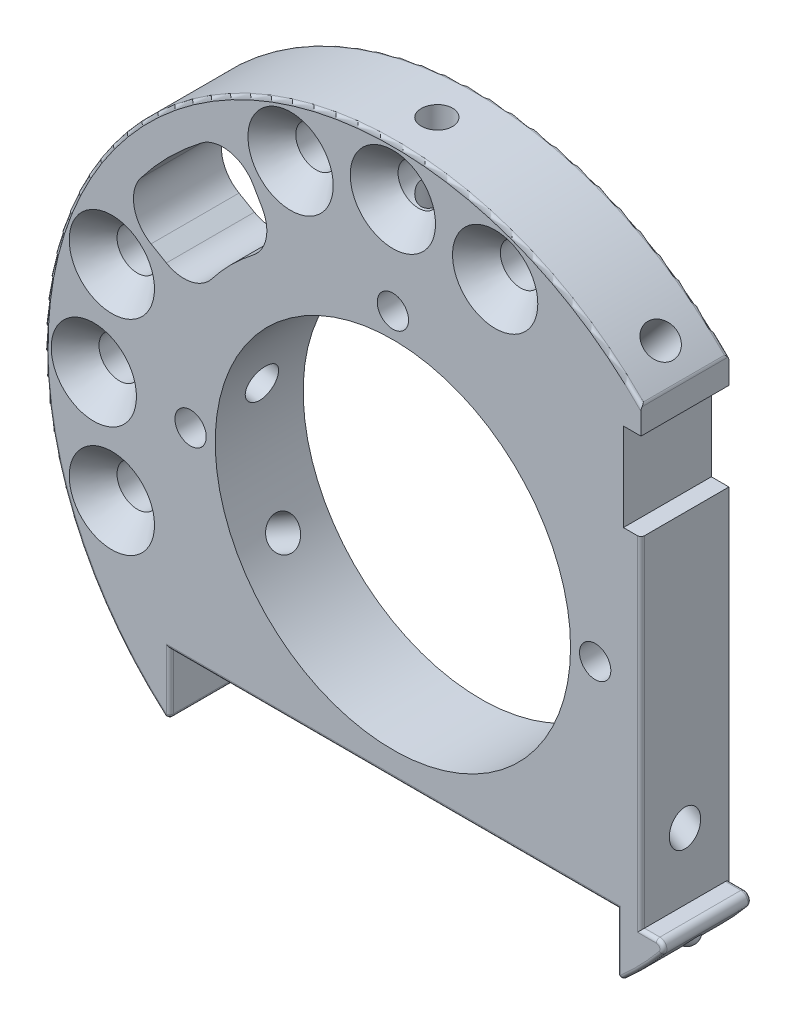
ISO-10303-21;
HEADER;
FILE_DESCRIPTION(('STEP AP214'),'2;1');
FILE_NAME('part.step','',(''),(''),'','','');
FILE_SCHEMA(('AUTOMOTIVE_DESIGN { 1 0 10303 214 1 1 1 1 }'));
ENDSEC;
DATA;
#1=APPLICATION_CONTEXT('core data for automotive mechanical design processes');
#2=APPLICATION_PROTOCOL_DEFINITION('international standard','automotive_design',2000,#1);
#3=PRODUCT_CONTEXT('',#1,'mechanical');
#4=PRODUCT('Part','Part','',(#3));
#5=PRODUCT_RELATED_PRODUCT_CATEGORY('part','',(#4));
#6=PRODUCT_DEFINITION_FORMATION('','',#4);
#7=PRODUCT_DEFINITION_CONTEXT('part definition',#1,'design');
#8=PRODUCT_DEFINITION('design','',#6,#7);
#9=PRODUCT_DEFINITION_SHAPE('','',#8);
#10=(LENGTH_UNIT() NAMED_UNIT(*) SI_UNIT(.MILLI.,.METRE.));
#11=(NAMED_UNIT(*) PLANE_ANGLE_UNIT() SI_UNIT($,.RADIAN.));
#12=(NAMED_UNIT(*) SI_UNIT($,.STERADIAN.) SOLID_ANGLE_UNIT());
#13=UNCERTAINTY_MEASURE_WITH_UNIT(LENGTH_MEASURE(1.E-05),#10,'distance_accuracy_value','');
#14=(GEOMETRIC_REPRESENTATION_CONTEXT(3) GLOBAL_UNCERTAINTY_ASSIGNED_CONTEXT((#13)) GLOBAL_UNIT_ASSIGNED_CONTEXT((#10,
#11,#12)) REPRESENTATION_CONTEXT('',''));
#15=CARTESIAN_POINT('',(0.,0.,0.));
#16=DIRECTION('',(0.,0.,1.));
#17=DIRECTION('',(1.,0.,0.));
#18=AXIS2_PLACEMENT_3D('',#15,#16,#17);
#19=CARTESIAN_POINT('',(0.,0.,0.));
#20=DIRECTION('',(0.,0.,1.));
#21=DIRECTION('',(1.,0.,0.));
#22=AXIS2_PLACEMENT_3D('',#19,#20,#21);
#23=CYLINDRICAL_SURFACE('',#22,25.146);
#24=DIRECTION('',(0.,0.,1.));
#25=VECTOR('',#24,1.);
#26=CARTESIAN_POINT('',(19.4168632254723,-15.9783208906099,0.));
#27=LINE('',#26,#25);
#28=CARTESIAN_POINT('',(19.4168632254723,-15.9783208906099,0.254));
#29=VERTEX_POINT('',#28);
#30=CARTESIAN_POINT('',(19.4168632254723,-15.9783208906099,6.096));
#31=VERTEX_POINT('',#30);
#32=EDGE_CURVE('E972',#29,#31,#27,.T.);
#33=ORIENTED_EDGE('',*,*,#32,.T.);
#34=CARTESIAN_POINT('',(0.,0.,6.096));
#35=DIRECTION('',(0.,0.,1.));
#36=DIRECTION('',(1.,0.,0.));
#37=AXIS2_PLACEMENT_3D('',#34,#35,#36);
#38=CIRCLE('',#37,25.146);
#39=CARTESIAN_POINT('',(16.6160141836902,-18.8740400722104,6.096));
#40=VERTEX_POINT('',#39);
#41=EDGE_CURVE('E825',#31,#40,#38,.F.);
#42=ORIENTED_EDGE('',*,*,#41,.T.);
#43=DIRECTION('',(0.,0.,1.));
#44=VECTOR('',#43,1.);
#45=CARTESIAN_POINT('',(16.6160141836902,-18.8740400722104,0.));
#46=LINE('',#45,#44);
#47=CARTESIAN_POINT('',(16.6160141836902,-18.8740400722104,0.254));
#48=VERTEX_POINT('',#47);
#49=EDGE_CURVE('E1020',#40,#48,#46,.F.);
#50=ORIENTED_EDGE('',*,*,#49,.T.);
#51=CARTESIAN_POINT('',(0.,0.,0.254));
#52=DIRECTION('',(0.,0.,1.));
#53=DIRECTION('',(1.,0.,0.));
#54=AXIS2_PLACEMENT_3D('',#51,#52,#53);
#55=CIRCLE('',#54,25.146);
#56=EDGE_CURVE('E822',#48,#29,#55,.T.);
#57=ORIENTED_EDGE('',*,*,#56,.T.);
#58=EDGE_LOOP('',(#33,#42,#50,#57));
#59=FACE_BOUND('',#58,.T.);
#60=CARTESIAN_POINT('',(18.43219548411,-17.1048380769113,3.74079914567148));
#61=CARTESIAN_POINT('',(18.4541572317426,-17.0811719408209,3.74079779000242));
#62=CARTESIAN_POINT('',(18.476088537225,-17.0574464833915,3.73808354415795));
#63=CARTESIAN_POINT('',(18.5192638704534,-17.0105614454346,3.72728833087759));
#64=CARTESIAN_POINT('',(18.5405070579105,-16.9874025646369,3.71920104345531));
#65=CARTESIAN_POINT('',(18.5816928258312,-16.9423416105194,3.69787275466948));
#66=CARTESIAN_POINT('',(18.6016357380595,-16.9204392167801,3.68463307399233));
#67=CARTESIAN_POINT('',(18.6396638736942,-16.878538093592,3.65335984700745));
#68=CARTESIAN_POINT('',(18.6577495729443,-16.8585388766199,3.63532753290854));
#69=CARTESIAN_POINT('',(18.6915225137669,-16.8210861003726,3.59501052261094));
#70=CARTESIAN_POINT('',(18.7072153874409,-16.8036265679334,3.57273609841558));
#71=CARTESIAN_POINT('',(18.7358121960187,-16.7717356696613,3.52452713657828));
#72=CARTESIAN_POINT('',(18.7487161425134,-16.7573042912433,3.4985926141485));
#73=CARTESIAN_POINT('',(18.77125647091,-16.732051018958,3.4440695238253));
#74=CARTESIAN_POINT('',(18.7809233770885,-16.7211954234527,3.41550918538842));
#75=CARTESIAN_POINT('',(18.7968870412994,-16.7032481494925,3.35633774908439));
#76=CARTESIAN_POINT('',(18.8031839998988,-16.6961562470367,3.32572677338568));
#77=CARTESIAN_POINT('',(18.8121868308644,-16.6860117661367,3.26362414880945));
#78=CARTESIAN_POINT('',(18.8149250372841,-16.6829228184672,3.23214312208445));
#79=CARTESIAN_POINT('',(18.8168393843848,-16.6807635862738,3.16893639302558));
#80=CARTESIAN_POINT('',(18.8160156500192,-16.6816931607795,3.13721069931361));
#81=CARTESIAN_POINT('',(18.8108413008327,-16.687527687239,3.07456408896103));
#82=CARTESIAN_POINT('',(18.8065064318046,-16.692414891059,3.04364021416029));
#83=CARTESIAN_POINT('',(18.7944510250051,-16.7059872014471,2.98332448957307));
#84=CARTESIAN_POINT('',(18.7867304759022,-16.7146723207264,2.95393264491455));
#85=CARTESIAN_POINT('',(18.7680968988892,-16.7355923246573,2.89743932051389));
#86=CARTESIAN_POINT('',(18.7571768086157,-16.7478350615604,2.87034308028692));
#87=CARTESIAN_POINT('',(18.7324513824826,-16.7754858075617,2.81926141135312));
#88=CARTESIAN_POINT('',(18.7186459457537,-16.7908939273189,2.79527609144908));
#89=CARTESIAN_POINT('',(18.6884067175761,-16.8245441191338,2.75089181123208));
#90=CARTESIAN_POINT('',(18.6719531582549,-16.8428074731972,2.73052245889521));
#91=CARTESIAN_POINT('',(18.6369454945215,-16.8815360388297,2.69415070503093));
#92=CARTESIAN_POINT('',(18.6183912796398,-16.9020013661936,2.67814853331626));
#93=CARTESIAN_POINT('',(18.5794909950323,-16.9447535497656,2.65079804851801));
#94=CARTESIAN_POINT('',(18.5591289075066,-16.9670565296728,2.63949771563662));
#95=CARTESIAN_POINT('',(18.517333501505,-17.0126609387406,2.62208195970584));
#96=CARTESIAN_POINT('',(18.4959001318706,-17.0359624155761,2.61596678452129));
#97=CARTESIAN_POINT('',(18.4523827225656,-17.0830888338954,2.60905515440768));
#98=CARTESIAN_POINT('',(18.4302949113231,-17.1069164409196,2.60830056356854));
#99=CARTESIAN_POINT('',(18.3862530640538,-17.1542431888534,2.61224110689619));
#100=CARTESIAN_POINT('',(18.3642990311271,-17.1777423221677,2.6169363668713));
#101=CARTESIAN_POINT('',(18.3211025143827,-17.2238067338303,2.63166947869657));
#102=CARTESIAN_POINT('',(18.299861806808,-17.2463697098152,2.64171974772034));
#103=CARTESIAN_POINT('',(18.2587694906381,-17.2898683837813,2.66690032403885));
#104=CARTESIAN_POINT('',(18.2389178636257,-17.3108041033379,2.68203056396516));
#105=CARTESIAN_POINT('',(18.2012798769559,-17.3503737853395,2.7168843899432));
#106=CARTESIAN_POINT('',(18.1834852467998,-17.3690169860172,2.73658854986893));
#107=CARTESIAN_POINT('',(18.1504124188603,-17.4035748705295,2.78007957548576));
#108=CARTESIAN_POINT('',(18.1351341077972,-17.4194896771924,2.80386625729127));
#109=CARTESIAN_POINT('',(18.1076991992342,-17.4480066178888,2.85462180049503));
#110=CARTESIAN_POINT('',(18.0955158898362,-17.4606371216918,2.88156028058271));
#111=CARTESIAN_POINT('',(18.0744817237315,-17.4824099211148,2.93802394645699));
#112=CARTESIAN_POINT('',(18.0656306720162,-17.4915524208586,2.96754898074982));
#113=CARTESIAN_POINT('',(18.0516172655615,-17.5060141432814,3.02803562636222));
#114=CARTESIAN_POINT('',(18.046419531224,-17.5113700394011,3.05898027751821));
#115=CARTESIAN_POINT('',(18.0397405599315,-17.5182504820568,3.12168557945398));
#116=CARTESIAN_POINT('',(18.0382591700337,-17.5197751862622,3.15344619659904));
#117=CARTESIAN_POINT('',(18.0390582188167,-17.5189524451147,3.21666942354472));
#118=CARTESIAN_POINT('',(18.0413151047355,-17.5166292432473,3.24813265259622));
#119=CARTESIAN_POINT('',(18.0494733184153,-17.5082227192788,3.3100680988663));
#120=CARTESIAN_POINT('',(18.0553746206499,-17.5021394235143,3.34054032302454));
#121=CARTESIAN_POINT('',(18.0706345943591,-17.4863832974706,3.39963803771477));
#122=CARTESIAN_POINT('',(18.0799936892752,-17.4767100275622,3.42826330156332));
#123=CARTESIAN_POINT('',(18.1018753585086,-17.4540445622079,3.48286619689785));
#124=CARTESIAN_POINT('',(18.1143978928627,-17.4410524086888,3.50884386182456));
#125=CARTESIAN_POINT('',(18.1423100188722,-17.412016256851,3.55759546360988));
#126=CARTESIAN_POINT('',(18.1577171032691,-17.3959536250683,3.58034828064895));
#127=CARTESIAN_POINT('',(18.1908846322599,-17.3612674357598,3.62184429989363));
#128=CARTESIAN_POINT('',(18.2086457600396,-17.3426431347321,3.64058633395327));
#129=CARTESIAN_POINT('',(18.2461843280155,-17.3031448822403,3.67372405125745));
#130=CARTESIAN_POINT('',(18.2659805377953,-17.2822498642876,3.688073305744));
#131=CARTESIAN_POINT('',(18.3068429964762,-17.238958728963,3.71176984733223));
#132=CARTESIAN_POINT('',(18.3279078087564,-17.2165643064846,3.72112267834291));
#133=CARTESIAN_POINT('',(18.3629464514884,-17.1791709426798,3.7321610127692));
#134=CARTESIAN_POINT('',(18.3767266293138,-17.1644296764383,3.73539647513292));
#135=CARTESIAN_POINT('',(18.4044070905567,-17.1347462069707,3.73971597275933));
#136=CARTESIAN_POINT('',(18.4183073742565,-17.1198040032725,3.74080000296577));
#137=CARTESIAN_POINT('',(18.43219548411,-17.1048380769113,3.74079914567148));
#138=B_SPLINE_CURVE_WITH_KNOTS('',3,(#60,#61,#62,#63,#64,#65,#66,#67,#68,#69,#70,#71,#72,#73,
#74,#75,#76,#77,#78,#79,#80,#81,#82,#83,#84,#85,#86,#87,#88,#89,#90,#91,#92,#93,#94,#95,#96,#97,
#98,#99,#100,#101,#102,#103,#104,#105,#106,#107,#108,#109,#110,#111,#112,#113,#114,#115,#116,
#117,#118,#119,#120,#121,#122,#123,#124,#125,#126,#127,#128,#129,#130,#131,#132,#133,#134,#135,
#136,#137),.UNSPECIFIED.,.T.,.F.,(4,2,2,2,2,2,2,2,2,2,2,2,2,2,2,2,2,2,2,2,2,2,2,2,2,2,2,2,2,2,2,
2,2,2,2,2,2,2,4),(0.,0.096785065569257,0.193684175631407,0.290558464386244,0.387407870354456,
0.484025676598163,0.580643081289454,0.676321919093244,0.771995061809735,0.866792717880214,
0.961587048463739,1.05595860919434,1.1503304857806,1.24491225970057,1.33949734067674,
1.43482436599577,1.53015640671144,1.62643872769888,1.72272565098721,1.81976371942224,
1.91680402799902,2.01407033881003,2.11133535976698,2.20819460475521,2.30504948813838,
2.40103764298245,2.49702017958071,2.59205989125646,2.68709569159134,2.78153499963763,
2.87597364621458,2.97042386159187,3.06487288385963,3.15991440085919,3.2549835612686,
3.35102536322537,3.44696037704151,3.50816490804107,3.56936958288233),.UNSPECIFIED.);
#139=CARTESIAN_POINT('',(18.43219548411,-17.1048380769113,3.74079914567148));
#140=VERTEX_POINT('',#139);
#141=EDGE_CURVE('E92',#140,#140,#138,.T.);
#142=ORIENTED_EDGE('',*,*,#141,.T.);
#143=EDGE_LOOP('',(#142));
#144=FACE_BOUND('',#143,.T.);
#145=ADVANCED_FACE('F88',(#59,#144),#23,.T.);
#146=CARTESIAN_POINT('',(0.,26.67,3.175));
#147=DIRECTION('',(0.,1.,0.));
#148=DIRECTION('',(0.,0.,1.));
#149=AXIS2_PLACEMENT_3D('',#146,#147,#148);
#150=CYLINDRICAL_SURFACE('',#149,1.13029999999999);
#151=CARTESIAN_POINT('',(0.,20.1168,4.30529999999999));
#152=CARTESIAN_POINT('',(0.0548962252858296,20.1168043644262,4.30529547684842));
#153=CARTESIAN_POINT('',(0.109849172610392,20.1198989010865,4.30127008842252));
#154=CARTESIAN_POINT('',(0.217989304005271,20.1319967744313,4.28543157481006));
#155=CARTESIAN_POINT('',(0.271173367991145,20.1410100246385,4.27360538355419));
#156=CARTESIAN_POINT('',(0.373953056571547,20.1640839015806,4.2429874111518));
#157=CARTESIAN_POINT('',(0.423567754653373,20.1781148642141,4.22423654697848));
#158=CARTESIAN_POINT('',(0.51860317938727,20.2101854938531,4.18066644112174));
#159=CARTESIAN_POINT('',(0.564024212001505,20.2282248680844,4.15584764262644));
#160=CARTESIAN_POINT('',(0.654228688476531,20.2690242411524,4.09840953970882));
#161=CARTESIAN_POINT('',(0.698554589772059,20.2920680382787,4.06527756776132));
#162=CARTESIAN_POINT('',(0.781376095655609,20.3401725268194,3.99355757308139));
#163=CARTESIAN_POINT('',(0.819863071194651,20.3652361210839,3.954961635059));
#164=CARTESIAN_POINT('',(0.898346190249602,20.4212072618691,3.86412141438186));
#165=CARTESIAN_POINT('',(0.93692781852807,20.4522257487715,3.81071920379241));
#166=CARTESIAN_POINT('',(1.00475395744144,20.5116639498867,3.69694406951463));
#167=CARTESIAN_POINT('',(1.03400959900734,20.5400867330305,3.6365795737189));
#168=CARTESIAN_POINT('',(1.07348926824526,20.5808208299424,3.53155746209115));
#169=CARTESIAN_POINT('',(1.08678473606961,20.595274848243,3.48889700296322));
#170=CARTESIAN_POINT('',(1.10838111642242,20.6193957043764,3.40106528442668));
#171=CARTESIAN_POINT('',(1.1166937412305,20.629073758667,3.35590018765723));
#172=CARTESIAN_POINT('',(1.12780164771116,20.6421272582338,3.26345626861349));
#173=CARTESIAN_POINT('',(1.13053860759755,20.6454360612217,3.21616033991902));
#174=CARTESIAN_POINT('',(1.13002848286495,20.6448260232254,3.12164173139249));
#175=CARTESIAN_POINT('',(1.12678073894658,20.6409063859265,3.07441906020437));
#176=CARTESIAN_POINT('',(1.11539260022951,20.6275667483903,2.98748043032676));
#177=CARTESIAN_POINT('',(1.1079035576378,20.6188830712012,2.94755588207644));
#178=CARTESIAN_POINT('',(1.08901939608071,20.5977518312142,2.8696759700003));
#179=CARTESIAN_POINT('',(1.07762008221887,20.5853002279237,2.83172277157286));
#180=CARTESIAN_POINT('',(1.04273748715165,20.5488498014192,2.73402488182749));
#181=CARTESIAN_POINT('',(1.01622080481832,20.5226144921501,2.67620072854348));
#182=CARTESIAN_POINT('',(0.95473215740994,20.4672673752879,2.5667054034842));
#183=CARTESIAN_POINT('',(0.919738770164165,20.4381483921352,2.51505032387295));
#184=CARTESIAN_POINT('',(0.84051191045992,20.3790581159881,2.41655850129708));
#185=CARTESIAN_POINT('',(0.796019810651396,20.3490891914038,2.36992742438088));
#186=CARTESIAN_POINT('',(0.698819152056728,20.2918697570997,2.28426336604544));
#187=CARTESIAN_POINT('',(0.646125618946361,20.2646144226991,2.24521677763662));
#188=CARTESIAN_POINT('',(0.543423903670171,20.2197644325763,2.18243197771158));
#189=CARTESIAN_POINT('',(0.494707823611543,20.2013150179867,2.15719886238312));
#190=CARTESIAN_POINT('',(0.392783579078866,20.1691241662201,2.11369763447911));
#191=CARTESIAN_POINT('',(0.339577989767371,20.1553800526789,2.09542556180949));
#192=CARTESIAN_POINT('',(0.2294951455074,20.1336981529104,2.06677457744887));
#193=CARTESIAN_POINT('',(0.172594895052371,20.1258014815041,2.05645153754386));
#194=CARTESIAN_POINT('',(0.0573592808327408,20.1167857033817,2.04467464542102));
#195=CARTESIAN_POINT('',(-0.000975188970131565,20.115662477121,2.0432154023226));
#196=CARTESIAN_POINT('',(-0.110222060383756,20.1200294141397,2.04891169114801));
#197=CARTESIAN_POINT('',(-0.161219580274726,20.1247771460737,2.05510006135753));
#198=CARTESIAN_POINT('',(-0.261216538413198,20.1392632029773,2.0741207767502));
#199=CARTESIAN_POINT('',(-0.310215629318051,20.1490023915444,2.08695427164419));
#200=CARTESIAN_POINT('',(-0.406021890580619,20.172977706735,2.11891019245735));
#201=CARTESIAN_POINT('',(-0.452769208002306,20.1872962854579,2.13814821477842));
#202=CARTESIAN_POINT('',(-0.542316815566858,20.219424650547,2.18204485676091));
#203=CARTESIAN_POINT('',(-0.585116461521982,20.2372350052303,2.20670435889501));
#204=CARTESIAN_POINT('',(-0.672964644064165,20.2784532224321,2.26510313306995));
#205=CARTESIAN_POINT('',(-0.71725728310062,20.302300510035,2.29966587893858));
#206=CARTESIAN_POINT('',(-0.799785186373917,20.3518619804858,2.37435842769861));
#207=CARTESIAN_POINT('',(-0.838008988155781,20.3775795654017,2.4144985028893));
#208=CARTESIAN_POINT('',(-0.915374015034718,20.4345103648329,2.50858453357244));
#209=CARTESIAN_POINT('',(-0.953097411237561,20.4657695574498,2.56367388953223));
#210=CARTESIAN_POINT('',(-1.01883815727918,20.52499698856,2.68098339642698));
#211=CARTESIAN_POINT('',(-1.04687370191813,20.5529713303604,2.74318988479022));
#212=CARTESIAN_POINT('',(-1.08334623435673,20.5914505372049,2.84973095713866));
#213=CARTESIAN_POINT('',(-1.09518631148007,20.6045633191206,2.89194504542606));
#214=CARTESIAN_POINT('',(-1.11398552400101,20.6258642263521,2.9786050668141));
#215=CARTESIAN_POINT('',(-1.12095653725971,20.6340643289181,3.02304528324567));
#216=CARTESIAN_POINT('',(-1.12955108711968,20.6442289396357,3.11358216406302));
#217=CARTESIAN_POINT('',(-1.13112793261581,20.6461389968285,3.15968981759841));
#218=CARTESIAN_POINT('',(-1.12864256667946,20.6431705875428,3.25154461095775));
#219=CARTESIAN_POINT('',(-1.12457647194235,20.6382874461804,3.29729148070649));
#220=CARTESIAN_POINT('',(-1.11038261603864,20.6217565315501,3.39226761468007));
#221=CARTESIAN_POINT('',(-1.09959060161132,20.6093723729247,3.44126274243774));
#222=CARTESIAN_POINT('',(-1.07223651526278,20.5795374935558,3.53601661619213));
#223=CARTESIAN_POINT('',(-1.05565917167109,20.5620733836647,3.58176640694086));
#224=CARTESIAN_POINT('',(-1.00942351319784,20.5163017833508,3.68809746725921));
#225=CARTESIAN_POINT('',(-0.977192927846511,20.4865088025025,3.74691194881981));
#226=CARTESIAN_POINT('',(-0.903445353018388,20.4253482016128,3.85748512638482));
#227=CARTESIAN_POINT('',(-0.861916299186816,20.3939785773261,3.90923451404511));
#228=CARTESIAN_POINT('',(-0.768972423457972,20.3321517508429,4.00617790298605));
#229=CARTESIAN_POINT('',(-0.717373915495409,20.3017260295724,4.05121737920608));
#230=CARTESIAN_POINT('',(-0.605265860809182,20.2454243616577,4.13206832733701));
#231=CARTESIAN_POINT('',(-0.544776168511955,20.2195385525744,4.16789988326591));
#232=CARTESIAN_POINT('',(-0.433246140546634,20.1810601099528,4.22027186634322));
#233=CARTESIAN_POINT('',(-0.384008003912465,20.1667638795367,4.23940870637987));
#234=CARTESIAN_POINT('',(-0.282285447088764,20.1431618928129,4.27076847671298));
#235=CARTESIAN_POINT('',(-0.229808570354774,20.1338449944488,4.28300684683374));
#236=CARTESIAN_POINT('',(-0.147395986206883,20.1238986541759,4.2960354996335));
#237=CARTESIAN_POINT('',(-0.118096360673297,20.1212450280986,4.29950134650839));
#238=CARTESIAN_POINT('',(-0.0592033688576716,20.1176943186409,4.30413508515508));
#239=CARTESIAN_POINT('',(-0.0296099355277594,20.116797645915,4.30530243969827));
#240=CARTESIAN_POINT('',(0.,20.1168,4.30529999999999));
#241=B_SPLINE_CURVE_WITH_KNOTS('',3,(#151,#152,#153,#154,#155,#156,#157,#158,#159,#160,#161,
#162,#163,#164,#165,#166,#167,#168,#169,#170,#171,#172,#173,#174,#175,#176,#177,#178,#179,#180,
#181,#182,#183,#184,#185,#186,#187,#188,#189,#190,#191,#192,#193,#194,#195,#196,#197,#198,#199,
#200,#201,#202,#203,#204,#205,#206,#207,#208,#209,#210,#211,#212,#213,#214,#215,#216,#217,#218,
#219,#220,#221,#222,#223,#224,#225,#226,#227,#228,#229,#230,#231,#232,#233,#234,#235,#236,#237,
#238,#239,#240),.UNSPECIFIED.,.T.,.F.,(4,2,2,2,2,2,2,2,2,2,2,2,2,2,2,2,2,2,2,2,2,2,2,2,2,2,2,2,
2,2,2,2,2,2,2,2,2,2,2,2,2,2,2,2,4),(0.,0.164562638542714,0.329401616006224,0.493281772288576,
0.657149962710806,0.836355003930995,1.01582235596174,1.23339369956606,1.45070438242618,
1.59114536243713,1.73125492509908,1.8728226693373,2.01440601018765,2.13856412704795,
2.26285585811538,2.46816126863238,2.67399103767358,2.88637145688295,3.09836726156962,
3.27132774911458,3.44418969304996,3.6182558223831,3.79221607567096,3.94625995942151,
4.10033050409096,4.25734803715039,4.4143911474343,4.59683443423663,4.77961831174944,
4.99986725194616,5.21970026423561,5.35652874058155,5.49302225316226,5.63069428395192,
5.76846110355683,5.92263556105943,6.07722011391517,6.2962407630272,6.51554724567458,
6.73930882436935,6.96257811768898,7.12610839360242,7.28927119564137,7.37801228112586,
7.46677410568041),.UNSPECIFIED.);
#242=CARTESIAN_POINT('',(0.,20.1168,4.30529999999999));
#243=VERTEX_POINT('',#242);
#244=EDGE_CURVE('E489',#243,#243,#241,.T.);
#245=ORIENTED_EDGE('',*,*,#244,.T.);
#246=EDGE_LOOP('',(#245));
#247=FACE_BOUND('',#246,.T.);
#248=CARTESIAN_POINT('',(0.,14.605,3.175));
#249=DIRECTION('',(0.,0.707106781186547,-0.707106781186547));
#250=DIRECTION('',(0.,0.707106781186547,0.707106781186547));
#251=AXIS2_PLACEMENT_3D('',#248,#249,#250);
#252=ELLIPSE('',#251,1.5984855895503,1.1303);
#253=CARTESIAN_POINT('',(1.1303,14.605,3.175));
#254=VERTEX_POINT('',#253);
#255=CARTESIAN_POINT('',(-1.1303,14.605,3.175));
#256=VERTEX_POINT('',#255);
#257=EDGE_CURVE('E326',#254,#256,#252,.F.);
#258=ORIENTED_EDGE('',*,*,#257,.T.);
#259=CARTESIAN_POINT('',(0.,14.605,3.175));
#260=DIRECTION('',(0.,0.707106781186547,0.707106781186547));
#261=DIRECTION('',(0.,0.707106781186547,-0.707106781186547));
#262=AXIS2_PLACEMENT_3D('',#259,#260,#261);
#263=ELLIPSE('',#262,1.5984855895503,1.1303);
#264=EDGE_CURVE('E321',#256,#254,#263,.F.);
#265=ORIENTED_EDGE('',*,*,#264,.T.);
#266=EDGE_LOOP('',(#258,#265));
#267=FACE_BOUND('',#266,.T.);
#268=ADVANCED_FACE('F335',(#247,#267),#150,.F.);
#269=CARTESIAN_POINT('',(17.9127870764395,-14.6395265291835,-33.4467302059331));
#270=DIRECTION('',(-1.,0.,0.));
#271=DIRECTION('',(0.,0.,1.));
#272=AXIS2_PLACEMENT_3D('',#269,#270,#271);
#273=PLANE('',#272);
#274=CARTESIAN_POINT('',(17.9127870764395,-10.3419524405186,3.175));
#275=DIRECTION('',(-1.,0.,0.));
#276=DIRECTION('',(0.,-1.,0.));
#277=AXIS2_PLACEMENT_3D('',#274,#275,#276);
#278=ELLIPSE('',#277,1.30515801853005,1.13029999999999);
#279=CARTESIAN_POINT('',(17.9127870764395,-11.6471104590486,3.175));
#280=VERTEX_POINT('',#279);
#281=EDGE_CURVE('E430',#280,#280,#278,.F.);
#282=ORIENTED_EDGE('',*,*,#281,.F.);
#283=EDGE_LOOP('',(#282));
#284=FACE_BOUND('',#283,.T.);
#285=DIRECTION('',(0.,0.,1.));
#286=VECTOR('',#285,1.);
#287=CARTESIAN_POINT('',(17.9127870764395,9.39304168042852,-6.47575478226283));
#288=LINE('',#287,#286);
#289=CARTESIAN_POINT('',(17.9127870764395,9.39304168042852,0.));
#290=VERTEX_POINT('',#289);
#291=CARTESIAN_POINT('',(17.9127870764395,9.39304168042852,6.09599999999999));
#292=VERTEX_POINT('',#291);
#293=EDGE_CURVE('E392',#290,#292,#288,.T.);
#294=ORIENTED_EDGE('',*,*,#293,.T.);
#295=DIRECTION('',(0.,-1.,0.));
#296=VECTOR('',#295,1.);
#297=CARTESIAN_POINT('',(17.9127870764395,-15.1475265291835,6.096));
#298=LINE('',#297,#296);
#299=CARTESIAN_POINT('',(17.9127870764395,-15.1475265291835,6.096));
#300=VERTEX_POINT('',#299);
#301=EDGE_CURVE('E703',#292,#300,#298,.T.);
#302=ORIENTED_EDGE('',*,*,#301,.T.);
#303=DIRECTION('',(0.,0.,1.));
#304=VECTOR('',#303,1.);
#305=CARTESIAN_POINT('',(17.9127870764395,-15.1475265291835,0.));
#306=LINE('',#305,#304);
#307=CARTESIAN_POINT('',(17.9127870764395,-15.1475265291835,0.254));
#308=VERTEX_POINT('',#307);
#309=EDGE_CURVE('E421',#308,#300,#306,.T.);
#310=ORIENTED_EDGE('',*,*,#309,.F.);
#311=CARTESIAN_POINT('',(17.9127870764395,-15.4015265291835,0.254));
#312=DIRECTION('',(-1.,0.,0.));
#313=DIRECTION('',(0.,0.,1.));
#314=AXIS2_PLACEMENT_3D('',#311,#312,#313);
#315=CIRCLE('',#314,0.254);
#316=CARTESIAN_POINT('',(17.9127870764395,-15.4015265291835,0.));
#317=VERTEX_POINT('',#316);
#318=EDGE_CURVE('E103',#308,#317,#315,.T.);
#319=ORIENTED_EDGE('',*,*,#318,.T.);
#320=DIRECTION('',(0.,1.,0.));
#321=VECTOR('',#320,1.);
#322=CARTESIAN_POINT('',(17.9127870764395,-14.6395265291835,0.));
#323=LINE('',#322,#321);
#324=EDGE_CURVE('E426',#317,#290,#323,.T.);
#325=ORIENTED_EDGE('',*,*,#324,.T.);
#326=EDGE_LOOP('',(#294,#302,#310,#319,#325));
#327=FACE_BOUND('',#326,.T.);
#328=ADVANCED_FACE('F622',(#284,#327),#273,.F.);
#329=CARTESIAN_POINT('',(0.,14.605,3.175));
#330=DIRECTION('',(0.,0.707106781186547,-0.707106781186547));
#331=DIRECTION('',(0.,0.707106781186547,0.707106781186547));
#332=AXIS2_PLACEMENT_3D('',#329,#330,#331);
#333=ELLIPSE('',#332,1.5984855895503,1.1303);
#334=EDGE_CURVE('E317',#254,#256,#333,.T.);
#335=ORIENTED_EDGE('',*,*,#334,.T.);
#336=CARTESIAN_POINT('',(0.,14.605,3.175));
#337=DIRECTION('',(0.,0.707106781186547,0.707106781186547));
#338=DIRECTION('',(0.,0.707106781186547,-0.707106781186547));
#339=AXIS2_PLACEMENT_3D('',#336,#337,#338);
#340=ELLIPSE('',#339,1.5984855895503,1.1303);
#341=EDGE_CURVE('E325',#256,#254,#340,.T.);
#342=ORIENTED_EDGE('',*,*,#341,.T.);
#343=EDGE_LOOP('',(#335,#342));
#344=FACE_BOUND('',#343,.T.);
#345=CARTESIAN_POINT('',(0.,12.827,4.30529999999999));
#346=CARTESIAN_POINT('',(0.0633576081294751,12.8269993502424,4.30529723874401));
#347=CARTESIAN_POINT('',(0.126758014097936,12.8265255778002,4.29995492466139));
#348=CARTESIAN_POINT('',(0.25180371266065,12.8246811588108,4.27872257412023));
#349=CARTESIAN_POINT('',(0.31344695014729,12.8233095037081,4.26282067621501));
#350=CARTESIAN_POINT('',(0.43314923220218,12.8198242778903,4.2209334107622));
#351=CARTESIAN_POINT('',(0.491210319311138,12.8177111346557,4.19495385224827));
#352=CARTESIAN_POINT('',(0.602134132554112,12.8129797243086,4.13365936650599));
#353=CARTESIAN_POINT('',(0.654997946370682,12.8103615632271,4.09834639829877));
#354=CARTESIAN_POINT('',(0.754189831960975,12.8049054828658,4.0192797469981));
#355=CARTESIAN_POINT('',(0.800501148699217,12.8020670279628,3.97550507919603));
#356=CARTESIAN_POINT('',(0.885129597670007,12.7964947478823,3.88080210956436));
#357=CARTESIAN_POINT('',(0.923446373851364,12.7937609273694,3.82987348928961));
#358=CARTESIAN_POINT('',(0.991055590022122,12.7887017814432,3.72220579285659));
#359=CARTESIAN_POINT('',(1.02033317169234,12.7863771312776,3.66545735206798));
#360=CARTESIAN_POINT('',(1.06893801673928,12.7824058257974,3.54782606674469));
#361=CARTESIAN_POINT('',(1.08826547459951,12.7807591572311,3.48694330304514));
#362=CARTESIAN_POINT('',(1.11637250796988,12.7783348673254,3.36294043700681));
#363=CARTESIAN_POINT('',(1.12517953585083,12.7775549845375,3.29982660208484));
#364=CARTESIAN_POINT('',(1.13208053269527,12.7769454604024,3.1730120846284));
#365=CARTESIAN_POINT('',(1.13017472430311,12.7771157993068,3.10931141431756));
#366=CARTESIAN_POINT('',(1.11572681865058,12.7783854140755,2.98331988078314));
#367=CARTESIAN_POINT('',(1.10321459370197,12.7794820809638,2.9210255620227));
#368=CARTESIAN_POINT('',(1.06795545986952,12.7824766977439,2.79942463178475));
#369=CARTESIAN_POINT('',(1.04520844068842,12.7843746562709,2.74011805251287));
#370=CARTESIAN_POINT('',(0.99009210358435,12.7887610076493,2.62608112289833));
#371=CARTESIAN_POINT('',(0.957709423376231,12.7912502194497,2.571357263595));
#372=CARTESIAN_POINT('',(0.884250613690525,12.7965378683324,2.46811017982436));
#373=CARTESIAN_POINT('',(0.843174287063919,12.7993363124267,2.41958709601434));
#374=CARTESIAN_POINT('',(0.753326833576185,12.8049387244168,2.32994529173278));
#375=CARTESIAN_POINT('',(0.70452988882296,12.8077426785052,2.28885244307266));
#376=CARTESIAN_POINT('',(0.600716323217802,12.8130310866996,2.21543775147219));
#377=CARTESIAN_POINT('',(0.545699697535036,12.8155155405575,2.18311591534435));
#378=CARTESIAN_POINT('',(0.430991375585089,12.8198855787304,2.1281622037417));
#379=CARTESIAN_POINT('',(0.371299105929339,12.8217710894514,2.10553151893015));
#380=CARTESIAN_POINT('',(0.248941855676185,12.8247299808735,2.07062085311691));
#381=CARTESIAN_POINT('',(0.186276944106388,12.8258033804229,2.05834063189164));
#382=CARTESIAN_POINT('',(0.0599774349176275,12.8270146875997,2.04451202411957));
#383=CARTESIAN_POINT('',(-0.00365322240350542,12.8271557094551,2.04292791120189));
#384=CARTESIAN_POINT('',(-0.130274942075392,12.8264946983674,2.05044283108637));
#385=CARTESIAN_POINT('',(-0.193266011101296,12.8256926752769,2.05954175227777));
#386=CARTESIAN_POINT('',(-0.316718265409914,12.8232377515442,2.08813483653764));
#387=CARTESIAN_POINT('',(-0.377183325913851,12.8215862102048,2.10761239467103));
#388=CARTESIAN_POINT('',(-0.493987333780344,12.8176177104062,2.156392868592));
#389=CARTESIAN_POINT('',(-0.550326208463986,12.8153007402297,2.18569595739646));
#390=CARTESIAN_POINT('',(-0.657440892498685,12.810253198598,2.25338514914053));
#391=CARTESIAN_POINT('',(-0.708201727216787,12.807521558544,2.29179486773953));
#392=CARTESIAN_POINT('',(-0.802568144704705,12.8019550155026,2.37657296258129));
#393=CARTESIAN_POINT('',(-0.84617358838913,12.7991201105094,2.4229414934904));
#394=CARTESIAN_POINT('',(-0.925114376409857,12.7936572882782,2.52247624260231));
#395=CARTESIAN_POINT('',(-0.960426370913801,12.7910299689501,2.5756610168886));
#396=CARTESIAN_POINT('',(-1.02161766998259,12.7862884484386,2.68722639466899));
#397=CARTESIAN_POINT('',(-1.04749707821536,12.784174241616,2.74560694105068));
#398=CARTESIAN_POINT('',(-1.0890489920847,12.7807017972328,2.86582467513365));
#399=CARTESIAN_POINT('',(-1.10473568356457,12.7793425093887,2.92765692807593));
#400=CARTESIAN_POINT('',(-1.12550302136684,12.7775303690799,3.05309020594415));
#401=CARTESIAN_POINT('',(-1.13058389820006,12.7770774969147,3.11669119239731));
#402=CARTESIAN_POINT('',(-1.12999257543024,12.7771297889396,3.24362448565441));
#403=CARTESIAN_POINT('',(-1.1243570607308,12.7776316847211,3.30695696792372));
#404=CARTESIAN_POINT('',(-1.10256953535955,12.7795300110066,3.43177210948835));
#405=CARTESIAN_POINT('',(-1.08641750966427,12.7809264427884,3.49325476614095));
#406=CARTESIAN_POINT('',(-1.0440649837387,12.7844556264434,3.61262664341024));
#407=CARTESIAN_POINT('',(-1.01786526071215,12.7865883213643,3.67051614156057));
#408=CARTESIAN_POINT('',(-0.956165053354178,12.7913498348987,3.78108118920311));
#409=CARTESIAN_POINT('',(-0.920664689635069,12.7939786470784,3.83375680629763));
#410=CARTESIAN_POINT('',(-0.841233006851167,12.799446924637,3.93258669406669));
#411=CARTESIAN_POINT('',(-0.797274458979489,12.8022870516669,3.97871904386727));
#412=CARTESIAN_POINT('',(-0.70222519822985,12.8078518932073,4.06297038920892));
#413=CARTESIAN_POINT('',(-0.651132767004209,12.8105765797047,4.10108744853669));
#414=CARTESIAN_POINT('',(-0.543156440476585,12.8156090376,4.16828371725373));
#415=CARTESIAN_POINT('',(-0.486260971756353,12.8179159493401,4.19734437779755));
#416=CARTESIAN_POINT('',(-0.368415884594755,12.8218430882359,4.24546231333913));
#417=CARTESIAN_POINT('',(-0.307470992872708,12.8234641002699,4.26453102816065));
#418=CARTESIAN_POINT('',(-0.205141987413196,12.8254230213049,4.28729456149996));
#419=CARTESIAN_POINT('',(-0.164414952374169,12.8260116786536,4.29403755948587));
#420=CARTESIAN_POINT('',(-0.0824646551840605,12.8268003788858,4.30304117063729));
#421=CARTESIAN_POINT('',(-0.0412413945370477,12.827000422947,4.30530179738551));
#422=CARTESIAN_POINT('',(0.,12.827,4.30529999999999));
#423=B_SPLINE_CURVE_WITH_KNOTS('',3,(#345,#346,#347,#348,#349,#350,#351,#352,#353,#354,#355,
#356,#357,#358,#359,#360,#361,#362,#363,#364,#365,#366,#367,#368,#369,#370,#371,#372,#373,#374,
#375,#376,#377,#378,#379,#380,#381,#382,#383,#384,#385,#386,#387,#388,#389,#390,#391,#392,#393,
#394,#395,#396,#397,#398,#399,#400,#401,#402,#403,#404,#405,#406,#407,#408,#409,#410,#411,#412,
#413,#414,#415,#416,#417,#418,#419,#420,#421,#422),.UNSPECIFIED.,.T.,.F.,(4,2,2,2,2,2,2,2,2,2,2,
2,2,2,2,2,2,2,2,2,2,2,2,2,2,2,2,2,2,2,2,2,2,2,2,2,2,2,4),(0.,0.189922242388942,
0.380058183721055,0.570084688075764,0.760071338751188,0.950535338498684,1.14100781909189,
1.33179174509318,1.52257194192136,1.71285321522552,1.90313053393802,2.09287372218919,
2.28261895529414,2.47262855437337,2.66264246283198,2.85330576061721,3.04396920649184,
3.23465607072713,3.42533850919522,3.61538372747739,3.80542696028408,3.99516704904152,
4.18491047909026,4.3751514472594,4.56539611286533,4.75617014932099,4.94694208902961,
5.13744794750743,5.32794966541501,5.51780042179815,5.70765144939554,5.89748779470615,
6.08732167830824,6.27777722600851,6.46827872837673,6.65916787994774,6.84983800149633,
6.97346454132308,7.09709070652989),.UNSPECIFIED.);
#424=CARTESIAN_POINT('',(0.,12.827,4.30529999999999));
#425=VERTEX_POINT('',#424);
#426=EDGE_CURVE('E501',#425,#425,#423,.T.);
#427=ORIENTED_EDGE('',*,*,#426,.F.);
#428=EDGE_LOOP('',(#427));
#429=FACE_BOUND('',#428,.T.);
#430=ADVANCED_FACE('F339',(#344,#429),#150,.F.);
#431=CARTESIAN_POINT('',(0.,0.,6.35));
#432=DIRECTION('',(0.,0.,-1.));
#433=DIRECTION('',(-1.,0.,0.));
#434=AXIS2_PLACEMENT_3D('',#431,#432,#433);
#435=CYLINDRICAL_SURFACE('',#434,25.146);
#436=CARTESIAN_POINT('',(-24.9425478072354,3.19227581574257,3.175));
#437=CARTESIAN_POINT('',(-24.9425476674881,3.19227878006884,3.10834032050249));
#438=CARTESIAN_POINT('',(-24.9418339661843,3.19786877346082,3.0416332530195));
#439=CARTESIAN_POINT('',(-24.9389752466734,3.22008544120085,2.91005900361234));
#440=CARTESIAN_POINT('',(-24.9368285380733,3.23672514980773,2.84519408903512));
#441=CARTESIAN_POINT('',(-24.931100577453,3.28055263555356,2.71922919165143));
#442=CARTESIAN_POINT('',(-24.9275200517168,3.30773507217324,2.65812732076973));
#443=CARTESIAN_POINT('',(-24.9189281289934,3.37185082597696,2.54140543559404));
#444=CARTESIAN_POINT('',(-24.9139170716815,3.4087818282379,2.48578412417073));
#445=CARTESIAN_POINT('',(-24.902478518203,3.49136269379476,2.3815345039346));
#446=CARTESIAN_POINT('',(-24.8960498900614,3.53701952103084,2.33291183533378));
#447=CARTESIAN_POINT('',(-24.8818276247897,3.6357187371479,2.2440877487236));
#448=CARTESIAN_POINT('',(-24.8740339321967,3.68876142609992,2.20388667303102));
#449=CARTESIAN_POINT('',(-24.8571709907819,3.80073260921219,2.13303203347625));
#450=CARTESIAN_POINT('',(-24.8481011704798,3.85966373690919,2.10238276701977));
#451=CARTESIAN_POINT('',(-24.828837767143,3.98170105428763,2.05152937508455));
#452=CARTESIAN_POINT('',(-24.8186441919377,4.0448072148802,2.0313251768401));
#453=CARTESIAN_POINT('',(-24.7973545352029,4.17333943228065,2.00195008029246));
#454=CARTESIAN_POINT('',(-24.7862591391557,4.23876370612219,1.99277088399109));
#455=CARTESIAN_POINT('',(-24.7634385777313,4.37011079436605,1.98568075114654));
#456=CARTESIAN_POINT('',(-24.7517134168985,4.43603360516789,1.98776973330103));
#457=CARTESIAN_POINT('',(-24.7279844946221,4.56645263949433,2.00314976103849));
#458=CARTESIAN_POINT('',(-24.7159809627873,4.63094995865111,2.01643187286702));
#459=CARTESIAN_POINT('',(-24.6920781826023,4.75675239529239,2.053807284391));
#460=CARTESIAN_POINT('',(-24.6801789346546,4.81805750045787,2.07790062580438));
#461=CARTESIAN_POINT('',(-24.6569058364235,4.93577919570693,2.13622477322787));
#462=CARTESIAN_POINT('',(-24.6455321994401,4.99219380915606,2.17045965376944));
#463=CARTESIAN_POINT('',(-24.6237534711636,5.09853230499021,2.2480920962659));
#464=CARTESIAN_POINT('',(-24.6133483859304,5.14845614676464,2.29148971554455));
#465=CARTESIAN_POINT('',(-24.5939221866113,5.24047001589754,2.38626625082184));
#466=CARTESIAN_POINT('',(-24.5849024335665,5.28255234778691,2.43765291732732));
#467=CARTESIAN_POINT('',(-24.5686457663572,5.35765269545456,2.54692162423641));
#468=CARTESIAN_POINT('',(-24.5614088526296,5.39067070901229,2.60480366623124));
#469=CARTESIAN_POINT('',(-24.549039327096,5.44672490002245,2.72542473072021));
#470=CARTESIAN_POINT('',(-24.5439067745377,5.46976079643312,2.78816388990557));
#471=CARTESIAN_POINT('',(-24.5359805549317,5.50520725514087,2.91671614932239));
#472=CARTESIAN_POINT('',(-24.5331868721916,5.51761788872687,2.98252922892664));
#473=CARTESIAN_POINT('',(-24.5300694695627,5.53146085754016,3.11529307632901));
#474=CARTESIAN_POINT('',(-24.5297433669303,5.53290378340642,3.18224268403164));
#475=CARTESIAN_POINT('',(-24.5315700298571,5.52479904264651,3.3154389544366));
#476=CARTESIAN_POINT('',(-24.5337227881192,5.51525140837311,3.38168561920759));
#477=CARTESIAN_POINT('',(-24.5404056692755,5.48543857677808,3.51156508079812));
#478=CARTESIAN_POINT('',(-24.5449347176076,5.46517822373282,3.57519904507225));
#479=CARTESIAN_POINT('',(-24.5561623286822,5.41450618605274,3.6980827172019));
#480=CARTESIAN_POINT('',(-24.5628609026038,5.38409444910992,3.75733240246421));
#481=CARTESIAN_POINT('',(-24.5781341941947,5.31393643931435,3.86981553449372));
#482=CARTESIAN_POINT('',(-24.5867103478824,5.27418301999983,3.92304432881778));
#483=CARTESIAN_POINT('',(-24.6053647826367,5.18645789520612,4.02192792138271));
#484=CARTESIAN_POINT('',(-24.61544307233,5.13848614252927,4.06758267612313));
#485=CARTESIAN_POINT('',(-24.6366927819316,5.03561714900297,4.15005861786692));
#486=CARTESIAN_POINT('',(-24.647865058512,4.98071447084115,4.18687280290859));
#487=CARTESIAN_POINT('',(-24.670857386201,4.8655477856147,4.25057472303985));
#488=CARTESIAN_POINT('',(-24.6826774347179,4.80528379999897,4.27746249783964));
#489=CARTESIAN_POINT('',(-24.7065271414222,4.68111358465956,4.32053609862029));
#490=CARTESIAN_POINT('',(-24.7185567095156,4.61720889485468,4.33672641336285));
#491=CARTESIAN_POINT('',(-24.7424261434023,4.48753927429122,4.35796021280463));
#492=CARTESIAN_POINT('',(-24.7542660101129,4.42177435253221,4.36300375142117));
#493=CARTESIAN_POINT('',(-24.7773879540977,4.29031607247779,4.36180030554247));
#494=CARTESIAN_POINT('',(-24.7886705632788,4.22462270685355,4.35556431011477));
#495=CARTESIAN_POINT('',(-24.8103946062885,4.09511276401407,4.33200151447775));
#496=CARTESIAN_POINT('',(-24.8208360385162,4.03129619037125,4.31467469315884));
#497=CARTESIAN_POINT('',(-24.840647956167,3.90736058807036,4.26942427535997));
#498=CARTESIAN_POINT('',(-24.8500184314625,3.84724159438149,4.24150057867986));
#499=CARTESIAN_POINT('',(-24.8675233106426,3.73242245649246,4.17585109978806));
#500=CARTESIAN_POINT('',(-24.875657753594,3.67772214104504,4.13812562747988));
#501=CARTESIAN_POINT('',(-24.8905908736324,3.57526080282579,4.0539046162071));
#502=CARTESIAN_POINT('',(-24.8973883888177,3.52750582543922,4.00740151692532));
#503=CARTESIAN_POINT('',(-24.9095807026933,3.44035567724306,3.9069483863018));
#504=CARTESIAN_POINT('',(-24.9149751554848,3.40096256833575,3.85299652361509));
#505=CARTESIAN_POINT('',(-24.924337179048,3.33166025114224,3.73913855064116));
#506=CARTESIAN_POINT('',(-24.9283034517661,3.3017596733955,3.67922708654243));
#507=CARTESIAN_POINT('',(-24.93479313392,3.25238885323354,3.55523401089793));
#508=CARTESIAN_POINT('',(-24.9373182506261,3.2329062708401,3.49115743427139));
#509=CARTESIAN_POINT('',(-24.9402670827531,3.21005726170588,3.38473466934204));
#510=CARTESIAN_POINT('',(-24.941122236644,3.20339788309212,3.3430780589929));
#511=CARTESIAN_POINT('',(-24.9422626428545,3.19450622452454,3.25928728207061));
#512=CARTESIAN_POINT('',(-24.9425478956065,3.19227394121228,3.21715311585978));
#513=CARTESIAN_POINT('',(-24.9425478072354,3.19227581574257,3.175));
#514=B_SPLINE_CURVE_WITH_KNOTS('',3,(#436,#437,#438,#439,#440,#441,#442,#443,#444,#445,#446,
#447,#448,#449,#450,#451,#452,#453,#454,#455,#456,#457,#458,#459,#460,#461,#462,#463,#464,#465,
#466,#467,#468,#469,#470,#471,#472,#473,#474,#475,#476,#477,#478,#479,#480,#481,#482,#483,#484,
#485,#486,#487,#488,#489,#490,#491,#492,#493,#494,#495,#496,#497,#498,#499,#500,#501,#502,#503,
#504,#505,#506,#507,#508,#509,#510,#511,#512,#513),.UNSPECIFIED.,.T.,.F.,(4,2,2,2,2,2,2,2,2,2,2,
2,2,2,2,2,2,2,2,2,2,2,2,2,2,2,2,2,2,2,2,2,2,2,2,2,2,2,4),(0.,0.199825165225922,
0.399886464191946,0.599846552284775,0.79975919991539,0.9998320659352,1.19991306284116,
1.40008394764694,1.60025343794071,1.80027217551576,2.00028946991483,2.20014727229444,
2.4000058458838,2.59994482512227,2.79988505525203,3.00002048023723,3.20015595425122,
3.40029706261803,3.6004368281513,3.80038331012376,4.00032920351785,4.2001847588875,
4.40004134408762,4.60005132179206,4.80006244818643,5.000231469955,5.2003996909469,
5.40048386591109,5.60056707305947,5.80045545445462,6.00034421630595,6.20023486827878,
6.40011920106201,6.60017648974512,6.80028305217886,7.00057103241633,7.20062124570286,
7.32698338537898,7.45334542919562),.UNSPECIFIED.);
#515=CARTESIAN_POINT('',(-24.9425478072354,3.19227581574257,3.175));
#516=VERTEX_POINT('',#515);
#517=EDGE_CURVE('E566',#516,#516,#514,.T.);
#518=ORIENTED_EDGE('',*,*,#517,.T.);
#519=EDGE_LOOP('',(#518));
#520=FACE_BOUND('',#519,.T.);
#521=CARTESIAN_POINT('',(15.2358658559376,20.0047421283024,3.175));
#522=CARTESIAN_POINT('',(15.2358683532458,20.0047405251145,3.10834032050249));
#523=CARTESIAN_POINT('',(15.2403525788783,20.0013274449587,3.0416332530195));
#524=CARTESIAN_POINT('',(15.2581634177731,19.9877433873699,2.91005900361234));
#525=CARTESIAN_POINT('',(15.2715004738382,19.9775644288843,2.84519408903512));
#526=CARTESIAN_POINT('',(15.306592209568,19.9506901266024,2.71922919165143));
#527=CARTESIAN_POINT('',(15.3283426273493,19.933998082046,2.65812732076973));
#528=CARTESIAN_POINT('',(15.3795725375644,19.8944993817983,2.54140543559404));
#529=CARTESIAN_POINT('',(15.4090501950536,19.871694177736,2.48578412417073));
#530=CARTESIAN_POINT('',(15.4748480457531,19.8204976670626,2.3815345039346));
#531=CARTESIAN_POINT('',(15.511173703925,19.7921018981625,2.33291183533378));
#532=CARTESIAN_POINT('',(15.5895385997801,19.7304354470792,2.2440877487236));
#533=CARTESIAN_POINT('',(15.6315780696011,19.6971645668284,2.20388667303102));
#534=CARTESIAN_POINT('',(15.7201164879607,19.6265752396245,2.13303203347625));
#535=CARTESIAN_POINT('',(15.7666174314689,19.5892549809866,2.10238276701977));
#536=CARTESIAN_POINT('',(15.86267314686,19.5115537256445,2.05152937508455));
#537=CARTESIAN_POINT('',(15.9122278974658,19.471172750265,2.0313251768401));
#538=CARTESIAN_POINT('',(16.0128952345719,19.3884692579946,2.00195008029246));
#539=CARTESIAN_POINT('',(16.0640066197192,19.3461482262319,1.99277088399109));
#540=CARTESIAN_POINT('',(16.1663462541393,19.2607114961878,1.98568075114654));
#541=CARTESIAN_POINT('',(16.2175745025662,19.2175958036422,1.98776973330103));
#542=CARTESIAN_POINT('',(16.3186562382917,19.1318364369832,2.00314976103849));
#543=CARTESIAN_POINT('',(16.3685107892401,19.0891924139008,2.01643187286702));
#544=CARTESIAN_POINT('',(16.4655075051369,19.0055907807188,2.053807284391));
#545=CARTESIAN_POINT('',(16.5126496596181,18.9646331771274,2.07790062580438));
#546=CARTESIAN_POINT('',(16.6029630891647,18.88561723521,2.13622477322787));
#547=CARTESIAN_POINT('',(16.6461327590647,18.8475600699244,2.17045965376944));
#548=CARTESIAN_POINT('',(16.727335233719,18.7755298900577,2.2480920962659));
#549=CARTESIAN_POINT('',(16.7653680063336,18.74155690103,2.29148971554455));
#550=CARTESIAN_POINT('',(16.8353412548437,18.6787263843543,2.38626625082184));
#551=CARTESIAN_POINT('',(16.8672757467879,18.6498738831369,2.43765291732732));
#552=CARTESIAN_POINT('',(16.9241862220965,18.598245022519,2.54692162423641));
#553=CARTESIAN_POINT('',(16.9491622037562,18.575468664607,2.60480366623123));
#554=CARTESIAN_POINT('',(16.9915217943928,18.5367292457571,2.72542473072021));
#555=CARTESIAN_POINT('',(17.0089051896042,18.52076637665,2.78816388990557));
#556=CARTESIAN_POINT('',(17.0356396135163,18.4961788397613,2.91671614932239));
#557=CARTESIAN_POINT('',(17.0449906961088,18.4875541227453,2.98252922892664));
#558=CARTESIAN_POINT('',(17.0554203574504,18.4779328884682,3.11529307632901));
#559=CARTESIAN_POINT('',(17.0565069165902,18.4769290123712,3.18224268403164));
#560=CARTESIAN_POINT('',(17.0504013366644,18.4825633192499,3.3154389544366));
#561=CARTESIAN_POINT('',(17.0432092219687,18.4892014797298,3.38168561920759));
#562=CARTESIAN_POINT('',(17.0207319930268,18.5098954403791,3.51156508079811));
#563=CARTESIAN_POINT('',(17.005450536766,18.5239478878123,3.57519904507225));
#564=CARTESIAN_POINT('',(16.9671810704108,18.5590073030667,3.6980827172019));
#565=CARTESIAN_POINT('',(16.944193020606,18.5800143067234,3.75733240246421));
#566=CARTESIAN_POINT('',(16.8910710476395,18.6283203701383,3.86981553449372));
#567=CARTESIAN_POINT('',(16.8609316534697,18.6556242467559,3.92304432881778));
#568=CARTESIAN_POINT('',(16.7942866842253,18.7156420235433,4.02192792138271));
#569=CARTESIAN_POINT('',(16.7577810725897,18.7483559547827,4.06758267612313));
#570=CARTESIAN_POINT('',(16.679318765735,18.8181932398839,4.15005861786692));
#571=CARTESIAN_POINT('',(16.6373577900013,18.8553200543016,4.18687280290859));
#572=CARTESIAN_POINT('',(16.5491166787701,18.9328153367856,4.25057472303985));
#573=CARTESIAN_POINT('',(16.502836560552,18.9731837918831,4.27746249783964));
#574=CARTESIAN_POINT('',(16.4072268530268,19.0559233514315,4.32053609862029));
#575=CARTESIAN_POINT('',(16.3578985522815,19.0982936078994,4.33672641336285));
#576=CARTESIAN_POINT('',(16.2575360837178,19.1837999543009,4.35796021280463));
#577=CARTESIAN_POINT('',(16.2065019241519,19.2269360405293,4.36300375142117));
#578=CARTESIAN_POINT('',(16.1042166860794,19.3126893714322,4.36180030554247));
#579=CARTESIAN_POINT('',(16.0529658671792,19.3553070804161,4.35556431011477));
#580=CARTESIAN_POINT('',(15.9516689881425,19.4388756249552,4.33200151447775));
#581=CARTESIAN_POINT('',(15.9016229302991,19.4798264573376,4.31467469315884));
#582=CARTESIAN_POINT('',(15.8041975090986,19.5589518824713,4.26942427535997));
#583=CARTESIAN_POINT('',(15.7568181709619,19.5971264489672,4.24150057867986));
#584=CARTESIAN_POINT('',(15.6661343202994,19.6696956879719,4.17585109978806));
#585=CARTESIAN_POINT('',(15.6228296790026,19.7040904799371,4.13812562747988));
#586=CARTESIAN_POINT('',(15.5415621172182,19.7682536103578,4.0539046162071));
#587=CARTESIAN_POINT('',(15.5036038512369,19.7980179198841,4.00740151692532));
#588=CARTESIAN_POINT('',(15.4342257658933,19.8521518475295,3.9069483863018));
#589=CARTESIAN_POINT('',(15.4028075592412,19.87652013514,3.85299652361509));
#590=CARTESIAN_POINT('',(15.3474710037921,19.9192790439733,3.73913855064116));
#591=CARTESIAN_POINT('',(15.3235594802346,19.9376642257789,3.67922708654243));
#592=CARTESIAN_POINT('',(15.2840479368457,19.9679698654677,3.55523401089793));
#593=CARTESIAN_POINT('',(15.2684380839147,19.9798979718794,3.49115743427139));
#594=CARTESIAN_POINT('',(15.2501246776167,19.99387623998,3.38473466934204));
#595=CARTESIAN_POINT('',(15.2447850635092,19.9979465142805,3.3430780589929));
#596=CARTESIAN_POINT('',(15.2376548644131,20.0033799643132,3.25928728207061));
#597=CARTESIAN_POINT('',(15.2358642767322,20.0047431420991,3.21715311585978));
#598=CARTESIAN_POINT('',(15.2358658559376,20.0047421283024,3.175));
#599=B_SPLINE_CURVE_WITH_KNOTS('',3,(#521,#522,#523,#524,#525,#526,#527,#528,#529,#530,#531,
#532,#533,#534,#535,#536,#537,#538,#539,#540,#541,#542,#543,#544,#545,#546,#547,#548,#549,#550,
#551,#552,#553,#554,#555,#556,#557,#558,#559,#560,#561,#562,#563,#564,#565,#566,#567,#568,#569,
#570,#571,#572,#573,#574,#575,#576,#577,#578,#579,#580,#581,#582,#583,#584,#585,#586,#587,#588,
#589,#590,#591,#592,#593,#594,#595,#596,#597,#598),.UNSPECIFIED.,.T.,.F.,(4,2,2,2,2,2,2,2,2,2,2,
2,2,2,2,2,2,2,2,2,2,2,2,2,2,2,2,2,2,2,2,2,2,2,2,2,2,2,4),(0.,0.199825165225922,
0.399886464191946,0.599846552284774,0.79975919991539,0.9998320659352,1.19991306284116,
1.40008394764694,1.60025343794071,1.80027217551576,2.00028946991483,2.20014727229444,
2.40000584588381,2.59994482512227,2.79988505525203,3.00002048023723,3.20015595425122,
3.40029706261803,3.6004368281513,3.80038331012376,4.00032920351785,4.2001847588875,
4.40004134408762,4.60005132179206,4.80006244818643,5.000231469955,5.2003996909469,
5.40048386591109,5.60056707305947,5.80045545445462,6.00034421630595,6.20023486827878,
6.40011920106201,6.60017648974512,6.80028305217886,7.00057103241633,7.20062124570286,
7.32698338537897,7.45334542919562),.UNSPECIFIED.);
#600=CARTESIAN_POINT('',(15.2358658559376,20.0047421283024,3.175));
#601=VERTEX_POINT('',#600);
#602=EDGE_CURVE('E565',#601,#601,#599,.T.);
#603=ORIENTED_EDGE('',*,*,#602,.T.);
#604=EDGE_LOOP('',(#603));
#605=FACE_BOUND('',#604,.T.);
#606=CARTESIAN_POINT('',(-21.1899138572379,-13.5391604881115,3.175));
#607=CARTESIAN_POINT('',(-21.1899155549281,-13.5391582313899,3.11154497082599));
#608=CARTESIAN_POINT('',(-21.1928050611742,-13.5346388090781,3.04804474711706));
#609=CARTESIAN_POINT('',(-21.2042737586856,-13.5166637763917,2.92279549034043));
#610=CARTESIAN_POINT('',(-21.2128596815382,-13.5031975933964,2.86104861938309));
#611=CARTESIAN_POINT('',(-21.2354235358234,-13.4676851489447,2.7411385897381));
#612=CARTESIAN_POINT('',(-21.2493987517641,-13.4456432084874,2.68297364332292));
#613=CARTESIAN_POINT('',(-21.2822614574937,-13.3935658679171,2.57186252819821));
#614=CARTESIAN_POINT('',(-21.3011477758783,-13.3635323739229,2.51891511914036));
#615=CARTESIAN_POINT('',(-21.3432167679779,-13.2962395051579,2.41968136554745));
#616=CARTESIAN_POINT('',(-21.3664025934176,-13.2589748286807,2.3733999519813));
#617=CARTESIAN_POINT('',(-21.416300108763,-13.1782264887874,2.28885389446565));
#618=CARTESIAN_POINT('',(-21.4430119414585,-13.13474257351,2.25058957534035));
#619=CARTESIAN_POINT('',(-21.4991144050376,-13.0427104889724,2.18315131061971));
#620=CARTESIAN_POINT('',(-21.5285061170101,-12.9941602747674,2.15398105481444));
#621=CARTESIAN_POINT('',(-21.5890391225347,-12.8933377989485,2.10558267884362));
#622=CARTESIAN_POINT('',(-21.6201804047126,-12.8410655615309,2.08635449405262));
#623=CARTESIAN_POINT('',(-21.6832453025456,-12.7342855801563,2.0583986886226));
#624=CARTESIAN_POINT('',(-21.7151683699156,-12.6797793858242,2.04966391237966));
#625=CARTESIAN_POINT('',(-21.7788811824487,-12.5700308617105,2.04292079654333));
#626=CARTESIAN_POINT('',(-21.8106709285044,-12.5147885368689,2.04491238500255));
#627=CARTESIAN_POINT('',(-21.8731973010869,-12.4051817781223,2.05955950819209));
#628=CARTESIAN_POINT('',(-21.9039346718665,-12.350816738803,2.07220733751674));
#629=CARTESIAN_POINT('',(-21.963549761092,-12.2444891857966,2.10779597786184));
#630=CARTESIAN_POINT('',(-21.9924274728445,-12.1925266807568,2.13073682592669));
#631=CARTESIAN_POINT('',(-22.047586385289,-12.0924984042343,2.18626910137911));
#632=CARTESIAN_POINT('',(-22.073866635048,-12.0444340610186,2.21886404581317));
#633=CARTESIAN_POINT('',(-22.1231681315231,-11.9536363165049,2.29277668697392));
#634=CARTESIAN_POINT('',(-22.1461893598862,-11.9109029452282,2.33409443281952));
#635=CARTESIAN_POINT('',(-22.1884448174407,-11.8320007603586,2.42432339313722));
#636=CARTESIAN_POINT('',(-22.2076756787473,-11.7958377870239,2.47324129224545));
#637=CARTESIAN_POINT('',(-22.2418838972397,-11.731208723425,2.57725845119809));
#638=CARTESIAN_POINT('',(-22.2568612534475,-11.7027426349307,2.63235771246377));
#639=CARTESIAN_POINT('',(-22.282229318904,-11.6543692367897,2.74717752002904));
#640=CARTESIAN_POINT('',(-22.2926199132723,-11.6344621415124,2.8068981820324));
#641=CARTESIAN_POINT('',(-22.308587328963,-11.603816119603,2.92926374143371));
#642=CARTESIAN_POINT('',(-22.3141641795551,-11.5930771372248,2.99190862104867));
#643=CARTESIAN_POINT('',(-22.3203814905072,-11.5811023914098,3.11828565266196));
#644=CARTESIAN_POINT('',(-22.3210262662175,-11.5798583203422,3.1820168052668));
#645=CARTESIAN_POINT('',(-22.3173770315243,-11.5868897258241,3.30880888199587));
#646=CARTESIAN_POINT('',(-22.3130830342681,-11.5951651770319,3.37186980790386));
#647=CARTESIAN_POINT('',(-22.2996510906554,-11.6209761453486,3.49550514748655));
#648=CARTESIAN_POINT('',(-22.2905151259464,-11.6385078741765,3.55608056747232));
#649=CARTESIAN_POINT('',(-22.2675982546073,-11.682293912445,3.67305635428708));
#650=CARTESIAN_POINT('',(-22.2538173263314,-11.7085482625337,3.72945670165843));
#651=CARTESIAN_POINT('',(-22.2219034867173,-11.7690053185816,3.83652438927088));
#652=CARTESIAN_POINT('',(-22.2037675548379,-11.8032135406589,3.88718771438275));
#653=CARTESIAN_POINT('',(-22.1635605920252,-11.8785401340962,3.98130284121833));
#654=CARTESIAN_POINT('',(-22.1414895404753,-11.9196585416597,4.02475460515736));
#655=CARTESIAN_POINT('',(-22.0939143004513,-12.0076127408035,4.1032445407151));
#656=CARTESIAN_POINT('',(-22.0684076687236,-12.0544525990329,4.13827667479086));
#657=CARTESIAN_POINT('',(-22.0145991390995,-12.1524425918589,4.1988916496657));
#658=CARTESIAN_POINT('',(-21.9862972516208,-12.2035927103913,4.2244745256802));
#659=CARTESIAN_POINT('',(-21.9276347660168,-12.3086866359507,4.26545420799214));
#660=CARTESIAN_POINT('',(-21.897274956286,-12.3626293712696,4.28085489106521));
#661=CARTESIAN_POINT('',(-21.8353000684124,-12.4717650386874,4.30104571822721));
#662=CARTESIAN_POINT('',(-21.8036849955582,-12.5269579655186,4.30583590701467));
#663=CARTESIAN_POINT('',(-21.7401111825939,-12.6369661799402,4.30466932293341));
#664=CARTESIAN_POINT('',(-21.7081527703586,-12.6917817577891,4.298722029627));
#665=CARTESIAN_POINT('',(-21.6447917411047,-12.7995396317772,4.27626887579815));
#666=CARTESIAN_POINT('',(-21.6133891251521,-12.852481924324,4.25976299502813));
#667=CARTESIAN_POINT('',(-21.5520827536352,-12.9550228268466,4.21666304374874));
#668=CARTESIAN_POINT('',(-21.5221790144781,-13.004621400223,4.19006886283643));
#669=CARTESIAN_POINT('',(-21.4647981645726,-13.0991150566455,4.12754908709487));
#670=CARTESIAN_POINT('',(-21.4373209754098,-13.1440102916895,4.09162379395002));
#671=CARTESIAN_POINT('',(-21.3856469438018,-13.2279195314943,4.01142843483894));
#672=CARTESIAN_POINT('',(-21.3614526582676,-13.2669289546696,3.96715192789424));
#673=CARTESIAN_POINT('',(-21.3171546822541,-13.3379905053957,3.87151207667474));
#674=CARTESIAN_POINT('',(-21.297052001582,-13.3700409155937,3.82014698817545));
#675=CARTESIAN_POINT('',(-21.2616012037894,-13.4263450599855,3.71175376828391));
#676=CARTESIAN_POINT('',(-21.2462572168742,-13.4505920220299,3.65472077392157));
#677=CARTESIAN_POINT('',(-21.2208838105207,-13.4905882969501,3.53668854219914));
#678=CARTESIAN_POINT('',(-21.2108480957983,-13.506347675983,3.47569409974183));
#679=CARTESIAN_POINT('',(-21.1990776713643,-13.5248101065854,3.37443230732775));
#680=CARTESIAN_POINT('',(-21.1956463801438,-13.5301851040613,3.33482127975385));
#681=CARTESIAN_POINT('',(-21.1910639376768,-13.5373610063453,3.25514617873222));
#682=CARTESIAN_POINT('',(-21.1899127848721,-13.5391619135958,3.21508210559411));
#683=CARTESIAN_POINT('',(-21.1899138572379,-13.5391604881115,3.175));
#684=B_SPLINE_CURVE_WITH_KNOTS('',3,(#606,#607,#608,#609,#610,#611,#612,#613,#614,#615,#616,
#617,#618,#619,#620,#621,#622,#623,#624,#625,#626,#627,#628,#629,#630,#631,#632,#633,#634,#635,
#636,#637,#638,#639,#640,#641,#642,#643,#644,#645,#646,#647,#648,#649,#650,#651,#652,#653,#654,
#655,#656,#657,#658,#659,#660,#661,#662,#663,#664,#665,#666,#667,#668,#669,#670,#671,#672,#673,
#674,#675,#676,#677,#678,#679,#680,#681,#682,#683),.UNSPECIFIED.,.T.,.F.,(4,2,2,2,2,2,2,2,2,2,2,
2,2,2,2,2,2,2,2,2,2,2,2,2,2,2,2,2,2,2,2,2,2,2,2,2,2,2,4),(0.,0.190218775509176,
0.380662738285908,0.571010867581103,0.761313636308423,0.951756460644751,1.14220699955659,
1.33273471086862,1.52326118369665,1.71365765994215,1.90405285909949,2.09431050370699,
2.28456883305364,2.47489656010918,2.6652253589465,2.85572251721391,3.04621971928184,
3.2367216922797,3.42722250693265,3.61755662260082,3.80789023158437,3.99814600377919,
4.18840266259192,4.37879166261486,4.56918166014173,4.75970777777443,4.9502331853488,
5.14068601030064,5.33113803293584,5.52142199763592,5.71170632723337,5.9019927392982,
6.09227299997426,6.28270062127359,6.47317518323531,6.66381460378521,6.85422742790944,
6.97438140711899,7.0945353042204),.UNSPECIFIED.);
#685=CARTESIAN_POINT('',(-21.1899138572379,-13.5391604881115,3.175));
#686=VERTEX_POINT('',#685);
#687=EDGE_CURVE('E490',#686,#686,#684,.T.);
#688=ORIENTED_EDGE('',*,*,#687,.T.);
#689=EDGE_LOOP('',(#688));
#690=FACE_BOUND('',#689,.T.);
#691=CARTESIAN_POINT('',(0.,25.146,4.30529999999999));
#692=CARTESIAN_POINT('',(-0.0634550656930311,25.1459996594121,4.30529719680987));
#693=CARTESIAN_POINT('',(-0.126955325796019,25.1457572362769,4.29993850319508));
#694=CARTESIAN_POINT('',(-0.252204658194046,25.1448134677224,4.27863729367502));
#695=CARTESIAN_POINT('',(-0.313951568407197,25.1441115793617,4.26268225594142));
#696=CARTESIAN_POINT('',(-0.433861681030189,25.1423283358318,4.22064559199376));
#697=CARTESIAN_POINT('',(-0.492026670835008,25.1412471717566,4.19456906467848));
#698=CARTESIAN_POINT('',(-0.603137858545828,25.1388271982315,4.13303732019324));
#699=CARTESIAN_POINT('',(-0.656085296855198,25.1374884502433,4.09758433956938));
#700=CARTESIAN_POINT('',(-0.755319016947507,25.1347026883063,4.01827245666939));
#701=CARTESIAN_POINT('',(-0.801600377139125,25.133255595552,3.97440739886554));
#702=CARTESIAN_POINT('',(-0.886146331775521,25.1304169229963,3.87952857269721));
#703=CARTESIAN_POINT('',(-0.924410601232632,25.1290253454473,3.82851451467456));
#704=CARTESIAN_POINT('',(-0.991848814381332,25.1264540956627,3.72076118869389));
#705=CARTESIAN_POINT('',(-1.02101905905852,25.1252745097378,3.66401960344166));
#706=CARTESIAN_POINT('',(-1.06941741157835,25.1232611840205,3.54643825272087));
#707=CARTESIAN_POINT('',(-1.08864558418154,25.1224274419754,3.48559851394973));
#708=CARTESIAN_POINT('',(-1.11660136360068,25.1212005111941,3.36159185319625));
#709=CARTESIAN_POINT('',(-1.1253361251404,25.1208070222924,3.29842654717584));
#710=CARTESIAN_POINT('',(-1.13207920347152,25.1205040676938,3.17152508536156));
#711=CARTESIAN_POINT('',(-1.13008759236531,25.1205945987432,3.10778893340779));
#712=CARTESIAN_POINT('',(-1.11544043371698,25.1212491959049,2.98160361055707));
#713=CARTESIAN_POINT('',(-1.10279261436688,25.1218129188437,2.91915354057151));
#714=CARTESIAN_POINT('',(-1.06720403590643,25.1233498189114,2.79726386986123));
#715=CARTESIAN_POINT('',(-1.0442632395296,25.1243229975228,2.73782428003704));
#716=CARTESIAN_POINT('',(-0.9887310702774,25.1265695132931,2.62361793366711));
#717=CARTESIAN_POINT('',(-0.956136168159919,25.127842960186,2.56885289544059));
#718=CARTESIAN_POINT('',(-0.882223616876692,25.13054636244,2.46556903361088));
#719=CARTESIAN_POINT('',(-0.840905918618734,25.1319763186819,2.4170502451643));
#720=CARTESIAN_POINT('',(-0.750676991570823,25.1348330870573,2.32759116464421));
#721=CARTESIAN_POINT('',(-0.701759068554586,25.1362598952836,2.28665762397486));
#722=CARTESIAN_POINT('',(-0.597741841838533,25.1389483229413,2.21358300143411));
#723=CARTESIAN_POINT('',(-0.542642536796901,25.140209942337,2.18144192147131));
#724=CARTESIAN_POINT('',(-0.427822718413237,25.1424258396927,2.12686526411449));
#725=CARTESIAN_POINT('',(-0.368102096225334,25.1433801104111,2.1044299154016));
#726=CARTESIAN_POINT('',(-0.245736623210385,25.1448736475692,2.06990595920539));
#727=CARTESIAN_POINT('',(-0.183091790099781,25.145412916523,2.05781728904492));
#728=CARTESIAN_POINT('',(-0.0567147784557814,25.1460153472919,2.04433814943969));
#729=CARTESIAN_POINT('',(0.00701640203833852,25.1460789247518,2.0429383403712));
#730=CARTESIAN_POINT('',(0.13380854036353,25.1457239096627,2.05085229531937));
#731=CARTESIAN_POINT('',(0.196869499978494,25.1453053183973,2.06016603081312));
#732=CARTESIAN_POINT('',(0.320504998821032,25.1440333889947,2.08923496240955));
#733=CARTESIAN_POINT('',(0.381080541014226,25.1431802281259,2.10898590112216));
#734=CARTESIAN_POINT('',(0.498056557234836,25.1411352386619,2.15836426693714));
#735=CARTESIAN_POINT('',(0.55445701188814,25.1399434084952,2.18799173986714));
#736=CARTESIAN_POINT('',(0.661524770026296,25.1373541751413,2.25630611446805));
#737=CARTESIAN_POINT('',(0.712188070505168,25.1359566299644,2.29499928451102));
#738=CARTESIAN_POINT('',(0.806303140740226,25.1331138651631,2.38033752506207));
#739=CARTESIAN_POINT('',(0.849754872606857,25.1316686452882,2.42698263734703));
#740=CARTESIAN_POINT('',(0.928244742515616,25.1288922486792,2.52694081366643));
#741=CARTESIAN_POINT('',(0.963276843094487,25.1275611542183,2.58025862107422));
#742=CARTESIAN_POINT('',(1.02389175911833,25.1251643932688,2.69202466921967));
#743=CARTESIAN_POINT('',(1.04947460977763,25.124098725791,2.7504728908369));
#744=CARTESIAN_POINT('',(1.09045427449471,25.1223535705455,2.87081816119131));
#745=CARTESIAN_POINT('',(1.10585495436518,25.1216739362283,2.93271389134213));
#746=CARTESIAN_POINT('',(1.12604575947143,25.1207770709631,3.05821569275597));
#747=CARTESIAN_POINT('',(1.13083592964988,25.1205598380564,3.12182175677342));
#748=CARTESIAN_POINT('',(1.1296692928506,25.1206123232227,3.24887853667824));
#749=CARTESIAN_POINT('',(1.12372198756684,25.1208816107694,3.31232934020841));
#750=CARTESIAN_POINT('',(1.10126883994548,25.1218758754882,3.43733073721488));
#751=CARTESIAN_POINT('',(1.08476297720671,25.1226008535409,3.49888132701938));
#752=CARTESIAN_POINT('',(1.04166309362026,25.1244246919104,3.61833736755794));
#753=CARTESIAN_POINT('',(1.01506896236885,25.125523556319,3.67624277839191));
#754=CARTESIAN_POINT('',(0.952549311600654,25.1279712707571,3.78676696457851));
#755=CARTESIAN_POINT('',(0.916624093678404,25.1293201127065,3.83938591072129));
#756=CARTESIAN_POINT('',(0.836428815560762,25.1321170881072,3.93789046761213));
#757=CARTESIAN_POINT('',(0.792152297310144,25.1335652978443,3.98377081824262));
#758=CARTESIAN_POINT('',(0.696512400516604,25.1363973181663,4.06746102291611));
#759=CARTESIAN_POINT('',(0.645147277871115,25.1377811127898,4.10526888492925));
#760=CARTESIAN_POINT('',(0.536754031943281,25.1403291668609,4.17175515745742));
#761=CARTESIAN_POINT('',(0.479721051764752,25.1414932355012,4.20042564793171));
#762=CARTESIAN_POINT('',(0.361688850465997,25.1434676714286,4.24775016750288));
#763=CARTESIAN_POINT('',(0.300694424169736,25.1442784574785,4.26641606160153));
#764=CARTESIAN_POINT('',(0.199432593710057,25.1452398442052,4.2882902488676));
#765=CARTESIAN_POINT('',(0.15982150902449,25.1455236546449,4.29466079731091));
#766=CARTESIAN_POINT('',(0.0801462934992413,25.1459038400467,4.30316655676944));
#767=CARTESIAN_POINT('',(0.0400821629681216,25.1460002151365,4.30530177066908));
#768=CARTESIAN_POINT('',(0.,25.146,4.30529999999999));
#769=B_SPLINE_CURVE_WITH_KNOTS('',3,(#691,#692,#693,#694,#695,#696,#697,#698,#699,#700,#701,
#702,#703,#704,#705,#706,#707,#708,#709,#710,#711,#712,#713,#714,#715,#716,#717,#718,#719,#720,
#721,#722,#723,#724,#725,#726,#727,#728,#729,#730,#731,#732,#733,#734,#735,#736,#737,#738,#739,
#740,#741,#742,#743,#744,#745,#746,#747,#748,#749,#750,#751,#752,#753,#754,#755,#756,#757,#758,
#759,#760,#761,#762,#763,#764,#765,#766,#767,#768),.UNSPECIFIED.,.T.,.F.,(4,2,2,2,2,2,2,2,2,2,2,
2,2,2,2,2,2,2,2,2,2,2,2,2,2,2,2,2,2,2,2,2,2,2,2,2,2,2,4),(0.,0.190218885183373,
0.380662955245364,0.571011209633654,0.761314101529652,0.951756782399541,1.14220718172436,
1.33273494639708,1.52326146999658,1.71365801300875,1.90405327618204,2.09431057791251,
2.28456856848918,2.47489619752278,2.66522489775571,2.85572219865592,3.04621954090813,
3.23672137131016,3.42722204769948,3.61755625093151,3.80788994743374,3.99814606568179,
4.18840306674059,4.37879200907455,4.56918195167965,4.75970801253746,4.95023336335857,
5.14068633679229,5.33113850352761,5.52142221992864,5.71170630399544,5.90199247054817,
6.09227248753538,6.28270025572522,6.47317496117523,6.66381431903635,6.8542270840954,
6.97438123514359,7.09453530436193),.UNSPECIFIED.);
#770=CARTESIAN_POINT('',(0.,25.146,4.30529999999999));
#771=VERTEX_POINT('',#770);
#772=EDGE_CURVE('E499',#771,#771,#769,.T.);
#773=ORIENTED_EDGE('',*,*,#772,.T.);
#774=EDGE_LOOP('',(#773));
#775=FACE_BOUND('',#774,.T.);
#776=DIRECTION('',(0.,0.,-1.));
#777=VECTOR('',#776,1.);
#778=CARTESIAN_POINT('',(-16.5276469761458,-18.9514696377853,6.35));
#779=LINE('',#778,#777);
#780=CARTESIAN_POINT('',(-16.5276469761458,-18.9514696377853,0.254));
#781=VERTEX_POINT('',#780);
#782=CARTESIAN_POINT('',(-16.5276469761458,-18.9514696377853,6.096));
#783=VERTEX_POINT('',#782);
#784=EDGE_CURVE('E887',#781,#783,#779,.F.);
#785=ORIENTED_EDGE('',*,*,#784,.T.);
#786=CARTESIAN_POINT('',(0.,0.,6.096));
#787=DIRECTION('',(0.,0.,1.));
#788=DIRECTION('',(1.,0.,0.));
#789=AXIS2_PLACEMENT_3D('',#786,#787,#788);
#790=CIRCLE('',#789,25.146);
#791=CARTESIAN_POINT('',(17.8389787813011,17.7226451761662,6.096));
#792=VERTEX_POINT('',#791);
#793=EDGE_CURVE('E789',#783,#792,#790,.F.);
#794=ORIENTED_EDGE('',*,*,#793,.T.);
#795=DIRECTION('',(0.,0.,-1.));
#796=VECTOR('',#795,1.);
#797=CARTESIAN_POINT('',(17.8389787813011,17.7226451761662,6.35));
#798=LINE('',#797,#796);
#799=CARTESIAN_POINT('',(17.8389787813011,17.7226451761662,0.254));
#800=VERTEX_POINT('',#799);
#801=EDGE_CURVE('E877',#792,#800,#798,.T.);
#802=ORIENTED_EDGE('',*,*,#801,.T.);
#803=CARTESIAN_POINT('',(0.,0.,0.254));
#804=DIRECTION('',(0.,0.,1.));
#805=DIRECTION('',(1.,0.,0.));
#806=AXIS2_PLACEMENT_3D('',#803,#804,#805);
#807=CIRCLE('',#806,25.146);
#808=EDGE_CURVE('E687',#800,#781,#807,.T.);
#809=ORIENTED_EDGE('',*,*,#808,.T.);
#810=EDGE_LOOP('',(#785,#794,#802,#809));
#811=FACE_BOUND('',#810,.T.);
#812=ADVANCED_FACE('F508',(#520,#605,#690,#775,#811),#435,.T.);
#813=CARTESIAN_POINT('',(0.,0.,6.35));
#814=DIRECTION('',(0.,0.,1.));
#815=DIRECTION('',(1.,0.,0.));
#816=AXIS2_PLACEMENT_3D('',#813,#814,#815);
#817=PLANE('',#816);
#818=CARTESIAN_POINT('',(14.605,0.,6.35));
#819=DIRECTION('',(0.,0.,1.));
#820=DIRECTION('',(1.,0.,0.));
#821=AXIS2_PLACEMENT_3D('',#818,#819,#820);
#822=CIRCLE('',#821,1.1303);
#823=CARTESIAN_POINT('',(15.7353,0.,6.35));
#824=VERTEX_POINT('',#823);
#825=EDGE_CURVE('E571',#824,#824,#822,.T.);
#826=ORIENTED_EDGE('',*,*,#825,.F.);
#827=EDGE_LOOP('',(#826));
#828=FACE_BOUND('',#827,.T.);
#829=CARTESIAN_POINT('',(0.,14.605,6.35));
#830=DIRECTION('',(0.,0.,1.));
#831=DIRECTION('',(1.,0.,0.));
#832=AXIS2_PLACEMENT_3D('',#829,#830,#831);
#833=CIRCLE('',#832,1.1303);
#834=CARTESIAN_POINT('',(1.1303,14.605,6.35));
#835=VERTEX_POINT('',#834);
#836=EDGE_CURVE('E1941',#835,#835,#833,.T.);
#837=ORIENTED_EDGE('',*,*,#836,.F.);
#838=EDGE_LOOP('',(#837));
#839=FACE_BOUND('',#838,.T.);
#840=CARTESIAN_POINT('',(-14.605,0.,6.35));
#841=DIRECTION('',(0.,0.,1.));
#842=DIRECTION('',(1.,0.,0.));
#843=AXIS2_PLACEMENT_3D('',#840,#841,#842);
#844=CIRCLE('',#843,1.1303);
#845=CARTESIAN_POINT('',(-13.4747,0.,6.35));
#846=VERTEX_POINT('',#845);
#847=EDGE_CURVE('E337',#846,#846,#844,.T.);
#848=ORIENTED_EDGE('',*,*,#847,.F.);
#849=EDGE_LOOP('',(#848));
#850=FACE_BOUND('',#849,.T.);
#851=CARTESIAN_POINT('',(-20.2879636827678,-7.38421489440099,6.35));
#852=DIRECTION('',(0.,0.,1.));
#853=DIRECTION('',(1.,0.,0.));
#854=AXIS2_PLACEMENT_3D('',#851,#852,#853);
#855=CIRCLE('',#854,3.0783022);
#856=CARTESIAN_POINT('',(-17.2096614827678,-7.38421489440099,6.35));
#857=VERTEX_POINT('',#856);
#858=EDGE_CURVE('E352',#857,#857,#855,.T.);
#859=ORIENTED_EDGE('',*,*,#858,.F.);
#860=EDGE_LOOP('',(#859));
#861=FACE_BOUND('',#860,.T.);
#862=CARTESIAN_POINT('',(-7.3842148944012,20.2879636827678,6.35));
#863=DIRECTION('',(0.,0.,1.));
#864=DIRECTION('',(1.,0.,0.));
#865=AXIS2_PLACEMENT_3D('',#862,#863,#864);
#866=CIRCLE('',#865,3.0783022);
#867=CARTESIAN_POINT('',(-4.3059126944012,20.2879636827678,6.35));
#868=VERTEX_POINT('',#867);
#869=EDGE_CURVE('E361',#868,#868,#866,.T.);
#870=ORIENTED_EDGE('',*,*,#869,.F.);
#871=EDGE_LOOP('',(#870));
#872=FACE_BOUND('',#871,.T.);
#873=CARTESIAN_POINT('',(-20.2879636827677,7.38421489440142,6.35));
#874=DIRECTION('',(0.,0.,1.));
#875=DIRECTION('',(1.,0.,0.));
#876=AXIS2_PLACEMENT_3D('',#873,#874,#875);
#877=CIRCLE('',#876,3.0783022);
#878=CARTESIAN_POINT('',(-17.2096614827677,7.38421489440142,6.35));
#879=VERTEX_POINT('',#878);
#880=EDGE_CURVE('E370',#879,#879,#877,.T.);
#881=ORIENTED_EDGE('',*,*,#880,.F.);
#882=EDGE_LOOP('',(#881));
#883=FACE_BOUND('',#882,.T.);
#884=CARTESIAN_POINT('',(7.3842148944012,20.2879636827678,6.35));
#885=DIRECTION('',(0.,0.,1.));
#886=DIRECTION('',(1.,0.,0.));
#887=AXIS2_PLACEMENT_3D('',#884,#885,#886);
#888=CIRCLE('',#887,3.0783022);
#889=CARTESIAN_POINT('',(10.4625170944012,20.2879636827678,6.35));
#890=VERTEX_POINT('',#889);
#891=EDGE_CURVE('E379',#890,#890,#888,.T.);
#892=ORIENTED_EDGE('',*,*,#891,.F.);
#893=EDGE_LOOP('',(#892));
#894=FACE_BOUND('',#893,.T.);
#895=DIRECTION('',(0.,-1.,0.));
#896=VECTOR('',#895,1.);
#897=CARTESIAN_POINT('',(17.9127870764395,-14.6395265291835,6.35));
#898=LINE('',#897,#896);
#899=CARTESIAN_POINT('',(17.9127870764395,17.2842044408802,6.35));
#900=VERTEX_POINT('',#899);
#901=CARTESIAN_POINT('',(17.9127870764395,15.7430416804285,6.35));
#902=VERTEX_POINT('',#901);
#903=EDGE_CURVE('E425',#900,#902,#898,.T.);
#904=ORIENTED_EDGE('',*,*,#903,.F.);
#905=CARTESIAN_POINT('',(0.,0.,6.35));
#906=DIRECTION('',(0.,0.,1.));
#907=DIRECTION('',(1.,0.,0.));
#908=AXIS2_PLACEMENT_3D('',#905,#906,#907);
#909=CIRCLE('',#908,24.892);
#910=CARTESIAN_POINT('',(-16.3607010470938,-18.7600406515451,6.35));
#911=VERTEX_POINT('',#910);
#912=EDGE_CURVE('E896',#900,#911,#909,.T.);
#913=ORIENTED_EDGE('',*,*,#912,.T.);
#914=DIRECTION('',(0.,1.,0.));
#915=VECTOR('',#914,1.);
#916=CARTESIAN_POINT('',(-16.3607010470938,0.,6.35));
#917=LINE('',#916,#915);
#918=CARTESIAN_POINT('',(-16.3607010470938,-14.3855265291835,6.35));
#919=VERTEX_POINT('',#918);
#920=EDGE_CURVE('E919',#911,#919,#917,.T.);
#921=ORIENTED_EDGE('',*,*,#920,.T.);
#922=DIRECTION('',(-1.,0.,0.));
#923=VECTOR('',#922,1.);
#924=CARTESIAN_POINT('',(16.1941756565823,-14.3855265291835,6.35));
#925=LINE('',#924,#923);
#926=CARTESIAN_POINT('',(16.4481756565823,-14.3855265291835,6.35));
#927=VERTEX_POINT('',#926);
#928=EDGE_CURVE('E920',#919,#927,#925,.F.);
#929=ORIENTED_EDGE('',*,*,#928,.T.);
#930=DIRECTION('',(0.,-1.,0.));
#931=VECTOR('',#930,1.);
#932=CARTESIAN_POINT('',(16.4481756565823,0.,6.35));
#933=LINE('',#932,#931);
#934=CARTESIAN_POINT('',(16.4481756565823,-18.6833932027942,6.35));
#935=VERTEX_POINT('',#934);
#936=EDGE_CURVE('E996',#927,#935,#933,.T.);
#937=ORIENTED_EDGE('',*,*,#936,.T.);
#938=CARTESIAN_POINT('',(0.,0.,6.35));
#939=DIRECTION('',(0.,0.,1.));
#940=DIRECTION('',(1.,0.,0.));
#941=AXIS2_PLACEMENT_3D('',#938,#939,#940);
#942=CIRCLE('',#941,24.892);
#943=CARTESIAN_POINT('',(19.2207332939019,-15.8169237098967,6.35));
#944=VERTEX_POINT('',#943);
#945=EDGE_CURVE('E993',#935,#944,#942,.T.);
#946=ORIENTED_EDGE('',*,*,#945,.T.);
#947=CARTESIAN_POINT('',(19.0246033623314,-15.6555265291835,6.35));
#948=DIRECTION('',(0.,0.,1.));
#949=DIRECTION('',(1.,0.,0.));
#950=AXIS2_PLACEMENT_3D('',#947,#948,#949);
#951=CIRCLE('',#950,0.254);
#952=CARTESIAN_POINT('',(19.0246033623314,-15.4015265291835,6.35));
#953=VERTEX_POINT('',#952);
#954=EDGE_CURVE('E990',#944,#953,#951,.T.);
#955=ORIENTED_EDGE('',*,*,#954,.T.);
#956=DIRECTION('',(-1.,0.,0.));
#957=VECTOR('',#956,1.);
#958=CARTESIAN_POINT('',(0.,-15.4015265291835,6.35));
#959=LINE('',#958,#957);
#960=CARTESIAN_POINT('',(17.6587870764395,-15.4015265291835,6.35));
#961=VERTEX_POINT('',#960);
#962=EDGE_CURVE('E987',#953,#961,#959,.T.);
#963=ORIENTED_EDGE('',*,*,#962,.T.);
#964=DIRECTION('',(0.,-1.,0.));
#965=VECTOR('',#964,1.);
#966=CARTESIAN_POINT('',(17.6587870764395,9.39304168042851,6.35));
#967=LINE('',#966,#965);
#968=CARTESIAN_POINT('',(17.6587870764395,9.39304168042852,6.35));
#969=VERTEX_POINT('',#968);
#970=EDGE_CURVE('E843',#961,#969,#967,.F.);
#971=ORIENTED_EDGE('',*,*,#970,.T.);
#972=DIRECTION('',(1.,0.,0.));
#973=VECTOR('',#972,1.);
#974=CARTESIAN_POINT('',(17.9127870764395,9.39304168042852,6.35));
#975=LINE('',#974,#973);
#976=CARTESIAN_POINT('',(16.6427870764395,9.39304168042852,6.35));
#977=VERTEX_POINT('',#976);
#978=EDGE_CURVE('E404',#977,#969,#975,.T.);
#979=ORIENTED_EDGE('',*,*,#978,.F.);
#980=DIRECTION('',(0.,-1.,0.));
#981=VECTOR('',#980,1.);
#982=CARTESIAN_POINT('',(16.6427870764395,15.7430416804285,6.35));
#983=LINE('',#982,#981);
#984=CARTESIAN_POINT('',(16.6427870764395,15.7430416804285,6.35));
#985=VERTEX_POINT('',#984);
#986=EDGE_CURVE('E400',#985,#977,#983,.T.);
#987=ORIENTED_EDGE('',*,*,#986,.F.);
#988=DIRECTION('',(-1.,0.,0.));
#989=VECTOR('',#988,1.);
#990=CARTESIAN_POINT('',(17.9127870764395,15.7430416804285,6.35));
#991=LINE('',#990,#989);
#992=EDGE_CURVE('E396',#902,#985,#991,.T.);
#993=ORIENTED_EDGE('',*,*,#992,.F.);
#994=EDGE_LOOP('',(#904,#913,#921,#929,#937,#946,#955,#963,#971,#979,#987,#993));
#995=FACE_BOUND('',#994,.T.);
#996=CARTESIAN_POINT('',(0.,0.,6.35));
#997=DIRECTION('',(0.,0.,1.));
#998=DIRECTION('',(-1.,0.,0.));
#999=AXIS2_PLACEMENT_3D('',#996,#997,#998);
#1000=CIRCLE('',#999,22.86);
#1001=CARTESIAN_POINT('',(-13.8150191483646,18.2133150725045,6.35));
#1002=VERTEX_POINT('',#1001);
#1003=CARTESIAN_POINT('',(-18.2133150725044,13.8150191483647,6.35));
#1004=VERTEX_POINT('',#1003);
#1005=EDGE_CURVE('E452',#1002,#1004,#1000,.T.);
#1006=ORIENTED_EDGE('',*,*,#1005,.F.);
#1007=CARTESIAN_POINT('',(-12.2800170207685,16.1896133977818,6.35));
#1008=DIRECTION('',(0.,0.,1.));
#1009=DIRECTION('',(1.,0.,0.));
#1010=AXIS2_PLACEMENT_3D('',#1007,#1008,#1009);
#1011=CIRCLE('',#1010,2.54);
#1012=CARTESIAN_POINT('',(-10.0803124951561,17.4596133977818,6.35));
#1013=VERTEX_POINT('',#1012);
#1014=EDGE_CURVE('E966',#1002,#1013,#1011,.F.);
#1015=ORIENTED_EDGE('',*,*,#1014,.T.);
#1016=DIRECTION('',(-0.499999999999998,0.86602540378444,0.));
#1017=VECTOR('',#1016,1.);
#1018=CARTESIAN_POINT('',(-11.43,19.7973407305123,6.35));
#1019=LINE('',#1018,#1017);
#1020=CARTESIAN_POINT('',(-9.43995365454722,16.3504793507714,6.35));
#1021=VERTEX_POINT('',#1020);
#1022=EDGE_CURVE('E439',#1021,#1013,#1019,.T.);
#1023=ORIENTED_EDGE('',*,*,#1022,.F.);
#1024=CARTESIAN_POINT('',(-11.6396581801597,15.0804793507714,6.35));
#1025=DIRECTION('',(0.,0.,1.));
#1026=DIRECTION('',(1.,0.,0.));
#1027=AXIS2_PLACEMENT_3D('',#1024,#1025,#1026);
#1028=CIRCLE('',#1027,2.54);
#1029=CARTESIAN_POINT('',(-10.0877037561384,13.0697487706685,6.35));
#1030=VERTEX_POINT('',#1029);
#1031=EDGE_CURVE('E960',#1021,#1030,#1028,.F.);
#1032=ORIENTED_EDGE('',*,*,#1031,.T.);
#1033=CARTESIAN_POINT('',(0.,0.,6.35));
#1034=DIRECTION('',(0.,0.,-1.));
#1035=DIRECTION('',(-1.,0.,0.));
#1036=AXIS2_PLACEMENT_3D('',#1033,#1034,#1035);
#1037=CIRCLE('',#1036,16.51);
#1038=CARTESIAN_POINT('',(-13.0697487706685,10.0877037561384,6.35));
#1039=VERTEX_POINT('',#1038);
#1040=EDGE_CURVE('E460',#1039,#1030,#1037,.T.);
#1041=ORIENTED_EDGE('',*,*,#1040,.F.);
#1042=CARTESIAN_POINT('',(-15.0804793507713,11.6396581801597,6.35));
#1043=DIRECTION('',(0.,0.,1.));
#1044=DIRECTION('',(1.,0.,0.));
#1045=AXIS2_PLACEMENT_3D('',#1042,#1043,#1044);
#1046=CIRCLE('',#1045,2.54);
#1047=CARTESIAN_POINT('',(-16.3504793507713,9.43995365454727,6.35));
#1048=VERTEX_POINT('',#1047);
#1049=EDGE_CURVE('E954',#1039,#1048,#1046,.F.);
#1050=ORIENTED_EDGE('',*,*,#1049,.T.);
#1051=DIRECTION('',(0.866025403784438,-0.500000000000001,0.));
#1052=VECTOR('',#1051,1.);
#1053=CARTESIAN_POINT('',(-19.7973407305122,11.43,6.35));
#1054=LINE('',#1053,#1052);
#1055=CARTESIAN_POINT('',(-17.4596133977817,10.0803124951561,6.35));
#1056=VERTEX_POINT('',#1055);
#1057=EDGE_CURVE('E456',#1056,#1048,#1054,.T.);
#1058=ORIENTED_EDGE('',*,*,#1057,.F.);
#1059=CARTESIAN_POINT('',(-16.1896133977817,12.2800170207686,6.35));
#1060=DIRECTION('',(0.,0.,1.));
#1061=DIRECTION('',(1.,0.,0.));
#1062=AXIS2_PLACEMENT_3D('',#1059,#1060,#1061);
#1063=CIRCLE('',#1062,2.54);
#1064=EDGE_CURVE('E948',#1056,#1004,#1063,.F.);
#1065=ORIENTED_EDGE('',*,*,#1064,.T.);
#1066=EDGE_LOOP('',(#1006,#1015,#1023,#1032,#1041,#1050,#1058,#1065));
#1067=FACE_BOUND('',#1066,.T.);
#1068=CARTESIAN_POINT('',(-21.59,2.2614324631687E-13,6.35));
#1069=DIRECTION('',(0.,0.,1.));
#1070=DIRECTION('',(1.,0.,0.));
#1071=AXIS2_PLACEMENT_3D('',#1068,#1069,#1070);
#1072=CIRCLE('',#1071,3.0783022);
#1073=CARTESIAN_POINT('',(-18.5116978,2.2614324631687E-13,6.35));
#1074=VERTEX_POINT('',#1073);
#1075=EDGE_CURVE('E451',#1074,#1074,#1072,.T.);
#1076=ORIENTED_EDGE('',*,*,#1075,.F.);
#1077=EDGE_LOOP('',(#1076));
#1078=FACE_BOUND('',#1077,.T.);
#1079=CARTESIAN_POINT('',(0.,21.59,6.35));
#1080=DIRECTION('',(0.,0.,1.));
#1081=DIRECTION('',(1.,0.,0.));
#1082=AXIS2_PLACEMENT_3D('',#1079,#1080,#1081);
#1083=CIRCLE('',#1082,3.0783022);
#1084=CARTESIAN_POINT('',(3.0783022,21.59,6.35));
#1085=VERTEX_POINT('',#1084);
#1086=EDGE_CURVE('E475',#1085,#1085,#1083,.T.);
#1087=ORIENTED_EDGE('',*,*,#1086,.F.);
#1088=EDGE_LOOP('',(#1087));
#1089=FACE_BOUND('',#1088,.T.);
#1090=CARTESIAN_POINT('',(0.,0.,6.35));
#1091=DIRECTION('',(0.,0.,1.));
#1092=DIRECTION('',(1.,0.,0.));
#1093=AXIS2_PLACEMENT_3D('',#1090,#1091,#1092);
#1094=CIRCLE('',#1093,12.827);
#1095=CARTESIAN_POINT('',(12.827,0.,6.35));
#1096=VERTEX_POINT('',#1095);
#1097=EDGE_CURVE('E1865',#1096,#1096,#1094,.T.);
#1098=ORIENTED_EDGE('',*,*,#1097,.F.);
#1099=EDGE_LOOP('',(#1098));
#1100=FACE_BOUND('',#1099,.T.);
#1101=ADVANCED_FACE('F636',(#828,#839,#850,#861,#872,#883,#894,#995,#1067,#1078,#1089,#1100),
#817,.T.);
#1102=CARTESIAN_POINT('',(0.,0.,0.));
#1103=DIRECTION('',(0.,0.,1.));
#1104=DIRECTION('',(1.,0.,0.));
#1105=AXIS2_PLACEMENT_3D('',#1102,#1103,#1104);
#1106=PLANE('',#1105);
#1107=CARTESIAN_POINT('',(14.605,0.,0.));
#1108=DIRECTION('',(0.,0.,1.));
#1109=DIRECTION('',(1.,0.,0.));
#1110=AXIS2_PLACEMENT_3D('',#1107,#1108,#1109);
#1111=CIRCLE('',#1110,1.1303);
#1112=CARTESIAN_POINT('',(15.7353,0.,0.));
#1113=VERTEX_POINT('',#1112);
#1114=EDGE_CURVE('E646',#1113,#1113,#1111,.T.);
#1115=ORIENTED_EDGE('',*,*,#1114,.T.);
#1116=EDGE_LOOP('',(#1115));
#1117=FACE_BOUND('',#1116,.T.);
#1118=CARTESIAN_POINT('',(0.,14.605,0.));
#1119=DIRECTION('',(0.,0.,1.));
#1120=DIRECTION('',(1.,0.,0.));
#1121=AXIS2_PLACEMENT_3D('',#1118,#1119,#1120);
#1122=CIRCLE('',#1121,1.1303);
#1123=CARTESIAN_POINT('',(1.1303,14.605,0.));
#1124=VERTEX_POINT('',#1123);
#1125=EDGE_CURVE('E333',#1124,#1124,#1122,.T.);
#1126=ORIENTED_EDGE('',*,*,#1125,.T.);
#1127=EDGE_LOOP('',(#1126));
#1128=FACE_BOUND('',#1127,.T.);
#1129=CARTESIAN_POINT('',(-14.605,0.,0.));
#1130=DIRECTION('',(0.,0.,1.));
#1131=DIRECTION('',(1.,0.,0.));
#1132=AXIS2_PLACEMENT_3D('',#1129,#1130,#1131);
#1133=CIRCLE('',#1132,1.1303);
#1134=CARTESIAN_POINT('',(-13.4747,0.,0.));
#1135=VERTEX_POINT('',#1134);
#1136=EDGE_CURVE('E348',#1135,#1135,#1133,.T.);
#1137=ORIENTED_EDGE('',*,*,#1136,.T.);
#1138=EDGE_LOOP('',(#1137));
#1139=FACE_BOUND('',#1138,.T.);
#1140=CARTESIAN_POINT('',(-20.2879636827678,-7.38421489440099,0.));
#1141=DIRECTION('',(0.,0.,1.));
#1142=DIRECTION('',(1.,0.,0.));
#1143=AXIS2_PLACEMENT_3D('',#1140,#1141,#1142);
#1144=CIRCLE('',#1143,1.4732);
#1145=CARTESIAN_POINT('',(-18.8147636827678,-7.38421489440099,0.));
#1146=VERTEX_POINT('',#1145);
#1147=EDGE_CURVE('E360',#1146,#1146,#1144,.T.);
#1148=ORIENTED_EDGE('',*,*,#1147,.T.);
#1149=EDGE_LOOP('',(#1148));
#1150=FACE_BOUND('',#1149,.T.);
#1151=CARTESIAN_POINT('',(-7.3842148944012,20.2879636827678,0.));
#1152=DIRECTION('',(0.,0.,1.));
#1153=DIRECTION('',(1.,0.,0.));
#1154=AXIS2_PLACEMENT_3D('',#1151,#1152,#1153);
#1155=CIRCLE('',#1154,1.4732);
#1156=CARTESIAN_POINT('',(-5.91101489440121,20.2879636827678,0.));
#1157=VERTEX_POINT('',#1156);
#1158=EDGE_CURVE('E369',#1157,#1157,#1155,.T.);
#1159=ORIENTED_EDGE('',*,*,#1158,.T.);
#1160=EDGE_LOOP('',(#1159));
#1161=FACE_BOUND('',#1160,.T.);
#1162=CARTESIAN_POINT('',(-20.2879636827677,7.38421489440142,0.));
#1163=DIRECTION('',(0.,0.,1.));
#1164=DIRECTION('',(1.,0.,0.));
#1165=AXIS2_PLACEMENT_3D('',#1162,#1163,#1164);
#1166=CIRCLE('',#1165,1.4732);
#1167=CARTESIAN_POINT('',(-18.8147636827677,7.38421489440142,0.));
#1168=VERTEX_POINT('',#1167);
#1169=EDGE_CURVE('E378',#1168,#1168,#1166,.T.);
#1170=ORIENTED_EDGE('',*,*,#1169,.T.);
#1171=EDGE_LOOP('',(#1170));
#1172=FACE_BOUND('',#1171,.T.);
#1173=CARTESIAN_POINT('',(7.3842148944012,20.2879636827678,0.));
#1174=DIRECTION('',(0.,0.,1.));
#1175=DIRECTION('',(1.,0.,0.));
#1176=AXIS2_PLACEMENT_3D('',#1173,#1174,#1175);
#1177=CIRCLE('',#1176,1.4732);
#1178=CARTESIAN_POINT('',(8.8574148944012,20.2879636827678,0.));
#1179=VERTEX_POINT('',#1178);
#1180=EDGE_CURVE('E387',#1179,#1179,#1177,.T.);
#1181=ORIENTED_EDGE('',*,*,#1180,.T.);
#1182=EDGE_LOOP('',(#1181));
#1183=FACE_BOUND('',#1182,.T.);
#1184=CARTESIAN_POINT('',(0.,0.,0.));
#1185=DIRECTION('',(0.,0.,-1.));
#1186=DIRECTION('',(-1.,0.,0.));
#1187=AXIS2_PLACEMENT_3D('',#1184,#1185,#1186);
#1188=CIRCLE('',#1187,16.51);
#1189=CARTESIAN_POINT('',(-13.0697487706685,10.0877037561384,0.));
#1190=VERTEX_POINT('',#1189);
#1191=CARTESIAN_POINT('',(-10.0877037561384,13.0697487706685,0.));
#1192=VERTEX_POINT('',#1191);
#1193=EDGE_CURVE('E443',#1190,#1192,#1188,.T.);
#1194=ORIENTED_EDGE('',*,*,#1193,.T.);
#1195=CARTESIAN_POINT('',(-11.6396581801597,15.0804793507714,0.));
#1196=DIRECTION('',(0.,0.,1.));
#1197=DIRECTION('',(1.,0.,0.));
#1198=AXIS2_PLACEMENT_3D('',#1195,#1196,#1197);
#1199=CIRCLE('',#1198,2.54);
#1200=CARTESIAN_POINT('',(-9.43995365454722,16.3504793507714,0.));
#1201=VERTEX_POINT('',#1200);
#1202=EDGE_CURVE('E963',#1192,#1201,#1199,.T.);
#1203=ORIENTED_EDGE('',*,*,#1202,.T.);
#1204=DIRECTION('',(-0.499999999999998,0.86602540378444,0.));
#1205=VECTOR('',#1204,1.);
#1206=CARTESIAN_POINT('',(-11.43,19.7973407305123,0.));
#1207=LINE('',#1206,#1205);
#1208=CARTESIAN_POINT('',(-10.0803124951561,17.4596133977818,0.));
#1209=VERTEX_POINT('',#1208);
#1210=EDGE_CURVE('E447',#1201,#1209,#1207,.T.);
#1211=ORIENTED_EDGE('',*,*,#1210,.T.);
#1212=CARTESIAN_POINT('',(-12.2800170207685,16.1896133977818,0.));
#1213=DIRECTION('',(0.,0.,1.));
#1214=DIRECTION('',(1.,0.,0.));
#1215=AXIS2_PLACEMENT_3D('',#1212,#1213,#1214);
#1216=CIRCLE('',#1215,2.54);
#1217=CARTESIAN_POINT('',(-13.8150191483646,18.2133150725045,0.));
#1218=VERTEX_POINT('',#1217);
#1219=EDGE_CURVE('E969',#1209,#1218,#1216,.T.);
#1220=ORIENTED_EDGE('',*,*,#1219,.T.);
#1221=CARTESIAN_POINT('',(0.,0.,0.));
#1222=DIRECTION('',(0.,0.,1.));
#1223=DIRECTION('',(-1.,0.,0.));
#1224=AXIS2_PLACEMENT_3D('',#1221,#1222,#1223);
#1225=CIRCLE('',#1224,22.86);
#1226=CARTESIAN_POINT('',(-18.2133150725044,13.8150191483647,0.));
#1227=VERTEX_POINT('',#1226);
#1228=EDGE_CURVE('E434',#1218,#1227,#1225,.T.);
#1229=ORIENTED_EDGE('',*,*,#1228,.T.);
#1230=CARTESIAN_POINT('',(-16.1896133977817,12.2800170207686,0.));
#1231=DIRECTION('',(0.,0.,1.));
#1232=DIRECTION('',(1.,0.,0.));
#1233=AXIS2_PLACEMENT_3D('',#1230,#1231,#1232);
#1234=CIRCLE('',#1233,2.54);
#1235=CARTESIAN_POINT('',(-17.4596133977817,10.0803124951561,0.));
#1236=VERTEX_POINT('',#1235);
#1237=EDGE_CURVE('E951',#1227,#1236,#1234,.T.);
#1238=ORIENTED_EDGE('',*,*,#1237,.T.);
#1239=DIRECTION('',(0.866025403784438,-0.500000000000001,0.));
#1240=VECTOR('',#1239,1.);
#1241=CARTESIAN_POINT('',(-19.7973407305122,11.43,0.));
#1242=LINE('',#1241,#1240);
#1243=CARTESIAN_POINT('',(-16.3504793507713,9.43995365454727,0.));
#1244=VERTEX_POINT('',#1243);
#1245=EDGE_CURVE('E438',#1236,#1244,#1242,.T.);
#1246=ORIENTED_EDGE('',*,*,#1245,.T.);
#1247=CARTESIAN_POINT('',(-15.0804793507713,11.6396581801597,0.));
#1248=DIRECTION('',(0.,0.,1.));
#1249=DIRECTION('',(1.,0.,0.));
#1250=AXIS2_PLACEMENT_3D('',#1247,#1248,#1249);
#1251=CIRCLE('',#1250,2.54);
#1252=EDGE_CURVE('E957',#1244,#1190,#1251,.T.);
#1253=ORIENTED_EDGE('',*,*,#1252,.T.);
#1254=EDGE_LOOP('',(#1194,#1203,#1211,#1220,#1229,#1238,#1246,#1253));
#1255=FACE_BOUND('',#1254,.T.);
#1256=CARTESIAN_POINT('',(-21.59,2.2614324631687E-13,0.));
#1257=DIRECTION('',(0.,0.,1.));
#1258=DIRECTION('',(1.,0.,0.));
#1259=AXIS2_PLACEMENT_3D('',#1256,#1257,#1258);
#1260=CIRCLE('',#1259,1.4732);
#1261=CARTESIAN_POINT('',(-20.1168,2.2614324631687E-13,0.));
#1262=VERTEX_POINT('',#1261);
#1263=EDGE_CURVE('E474',#1262,#1262,#1260,.T.);
#1264=ORIENTED_EDGE('',*,*,#1263,.T.);
#1265=EDGE_LOOP('',(#1264));
#1266=FACE_BOUND('',#1265,.T.);
#1267=CARTESIAN_POINT('',(0.,21.59,0.));
#1268=DIRECTION('',(0.,0.,1.));
#1269=DIRECTION('',(1.,0.,0.));
#1270=AXIS2_PLACEMENT_3D('',#1267,#1268,#1269);
#1271=CIRCLE('',#1270,1.4732);
#1272=CARTESIAN_POINT('',(1.4732,21.59,0.));
#1273=VERTEX_POINT('',#1272);
#1274=EDGE_CURVE('E484',#1273,#1273,#1271,.T.);
#1275=ORIENTED_EDGE('',*,*,#1274,.T.);
#1276=EDGE_LOOP('',(#1275));
#1277=FACE_BOUND('',#1276,.T.);
#1278=CARTESIAN_POINT('',(0.,0.,0.));
#1279=DIRECTION('',(0.,0.,1.));
#1280=DIRECTION('',(1.,0.,0.));
#1281=AXIS2_PLACEMENT_3D('',#1278,#1279,#1280);
#1282=CIRCLE('',#1281,12.827);
#1283=CARTESIAN_POINT('',(12.827,0.,0.));
#1284=VERTEX_POINT('',#1283);
#1285=EDGE_CURVE('E675',#1284,#1284,#1282,.T.);
#1286=ORIENTED_EDGE('',*,*,#1285,.T.);
#1287=EDGE_LOOP('',(#1286));
#1288=FACE_BOUND('',#1287,.T.);
#1289=DIRECTION('',(0.,-1.,0.));
#1290=VECTOR('',#1289,1.);
#1291=CARTESIAN_POINT('',(16.4481756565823,-14.6395265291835,0.));
#1292=LINE('',#1291,#1290);
#1293=CARTESIAN_POINT('',(16.4481756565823,-18.6833932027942,0.));
#1294=VERTEX_POINT('',#1293);
#1295=CARTESIAN_POINT('',(16.4481756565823,-14.6395265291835,0.));
#1296=VERTEX_POINT('',#1295);
#1297=EDGE_CURVE('E678',#1294,#1296,#1292,.F.);
#1298=ORIENTED_EDGE('',*,*,#1297,.T.);
#1299=DIRECTION('',(-1.,0.,0.));
#1300=VECTOR('',#1299,1.);
#1301=CARTESIAN_POINT('',(0.,-14.6395265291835,0.));
#1302=LINE('',#1301,#1300);
#1303=CARTESIAN_POINT('',(-16.3607010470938,-14.6395265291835,0.));
#1304=VERTEX_POINT('',#1303);
#1305=EDGE_CURVE('E680',#1296,#1304,#1302,.T.);
#1306=ORIENTED_EDGE('',*,*,#1305,.T.);
#1307=DIRECTION('',(0.,1.,0.));
#1308=VECTOR('',#1307,1.);
#1309=CARTESIAN_POINT('',(-16.3607010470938,-18.7600406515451,0.));
#1310=LINE('',#1309,#1308);
#1311=CARTESIAN_POINT('',(-16.3607010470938,-18.7600406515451,0.));
#1312=VERTEX_POINT('',#1311);
#1313=EDGE_CURVE('E866',#1304,#1312,#1310,.F.);
#1314=ORIENTED_EDGE('',*,*,#1313,.T.);
#1315=CARTESIAN_POINT('',(0.,0.,0.));
#1316=DIRECTION('',(0.,0.,1.));
#1317=DIRECTION('',(1.,0.,0.));
#1318=AXIS2_PLACEMENT_3D('',#1315,#1316,#1317);
#1319=CIRCLE('',#1318,24.892);
#1320=CARTESIAN_POINT('',(17.9127870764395,17.2842044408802,0.));
#1321=VERTEX_POINT('',#1320);
#1322=EDGE_CURVE('E863',#1312,#1321,#1319,.F.);
#1323=ORIENTED_EDGE('',*,*,#1322,.T.);
#1324=CARTESIAN_POINT('',(17.9127870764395,15.7430416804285,0.));
#1325=VERTEX_POINT('',#1324);
#1326=EDGE_CURVE('E431',#1325,#1321,#323,.T.);
#1327=ORIENTED_EDGE('',*,*,#1326,.F.);
#1328=DIRECTION('',(1.,0.,0.));
#1329=VECTOR('',#1328,1.);
#1330=CARTESIAN_POINT('',(17.9127870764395,15.7430416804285,0.));
#1331=LINE('',#1330,#1329);
#1332=CARTESIAN_POINT('',(16.6427870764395,15.7430416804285,0.));
#1333=VERTEX_POINT('',#1332);
#1334=EDGE_CURVE('E395',#1333,#1325,#1331,.T.);
#1335=ORIENTED_EDGE('',*,*,#1334,.F.);
#1336=DIRECTION('',(0.,1.,0.));
#1337=VECTOR('',#1336,1.);
#1338=CARTESIAN_POINT('',(16.6427870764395,15.7430416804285,0.));
#1339=LINE('',#1338,#1337);
#1340=CARTESIAN_POINT('',(16.6427870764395,9.39304168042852,0.));
#1341=VERTEX_POINT('',#1340);
#1342=EDGE_CURVE('E388',#1341,#1333,#1339,.T.);
#1343=ORIENTED_EDGE('',*,*,#1342,.F.);
#1344=DIRECTION('',(-1.,0.,0.));
#1345=VECTOR('',#1344,1.);
#1346=CARTESIAN_POINT('',(17.9127870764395,9.39304168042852,0.));
#1347=LINE('',#1346,#1345);
#1348=EDGE_CURVE('E391',#290,#1341,#1347,.T.);
#1349=ORIENTED_EDGE('',*,*,#1348,.F.);
#1350=ORIENTED_EDGE('',*,*,#324,.F.);
#1351=DIRECTION('',(-1.,0.,0.));
#1352=VECTOR('',#1351,1.);
#1353=CARTESIAN_POINT('',(19.0246033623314,-15.4015265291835,0.));
#1354=LINE('',#1353,#1352);
#1355=CARTESIAN_POINT('',(19.0246033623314,-15.4015265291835,0.));
#1356=VERTEX_POINT('',#1355);
#1357=EDGE_CURVE('E688',#317,#1356,#1354,.F.);
#1358=ORIENTED_EDGE('',*,*,#1357,.T.);
#1359=CARTESIAN_POINT('',(19.0246033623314,-15.6555265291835,0.));
#1360=DIRECTION('',(0.,0.,1.));
#1361=DIRECTION('',(1.,0.,0.));
#1362=AXIS2_PLACEMENT_3D('',#1359,#1360,#1361);
#1363=CIRCLE('',#1362,0.254);
#1364=CARTESIAN_POINT('',(19.2207332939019,-15.8169237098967,0.));
#1365=VERTEX_POINT('',#1364);
#1366=EDGE_CURVE('E871',#1356,#1365,#1363,.F.);
#1367=ORIENTED_EDGE('',*,*,#1366,.T.);
#1368=CARTESIAN_POINT('',(0.,0.,0.));
#1369=DIRECTION('',(0.,0.,1.));
#1370=DIRECTION('',(1.,0.,0.));
#1371=AXIS2_PLACEMENT_3D('',#1368,#1369,#1370);
#1372=CIRCLE('',#1371,24.892);
#1373=EDGE_CURVE('E682',#1365,#1294,#1372,.F.);
#1374=ORIENTED_EDGE('',*,*,#1373,.T.);
#1375=EDGE_LOOP('',(#1298,#1306,#1314,#1323,#1327,#1335,#1343,#1349,#1350,#1358,#1367,#1374));
#1376=FACE_BOUND('',#1375,.T.);
#1377=ADVANCED_FACE('F634',(#1117,#1128,#1139,#1150,#1161,#1172,#1183,#1255,#1266,#1277,#1288,
#1376),#1106,.F.);
#1378=CARTESIAN_POINT('',(-24.918529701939,-14.6395265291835,0.));
#1379=DIRECTION('',(0.,1.,0.));
#1380=DIRECTION('',(0.,0.,1.));
#1381=AXIS2_PLACEMENT_3D('',#1378,#1379,#1380);
#1382=PLANE('',#1381);
#1383=CARTESIAN_POINT('',(-12.7,-14.6395265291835,3.175));
#1384=DIRECTION('',(0.,-1.,0.));
#1385=DIRECTION('',(0.,0.,-1.));
#1386=AXIS2_PLACEMENT_3D('',#1383,#1384,#1385);
#1387=CIRCLE('',#1386,1.13029999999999);
#1388=CARTESIAN_POINT('',(-12.7,-14.6395265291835,2.04470000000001));
#1389=VERTEX_POINT('',#1388);
#1390=EDGE_CURVE('E1931',#1389,#1389,#1387,.T.);
#1391=ORIENTED_EDGE('',*,*,#1390,.F.);
#1392=EDGE_LOOP('',(#1391));
#1393=FACE_BOUND('',#1392,.T.);
#1394=CARTESIAN_POINT('',(12.7,-14.6395265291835,3.17500000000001));
#1395=DIRECTION('',(0.,-1.,0.));
#1396=DIRECTION('',(0.,0.,-1.));
#1397=AXIS2_PLACEMENT_3D('',#1394,#1395,#1396);
#1398=CIRCLE('',#1397,1.13029999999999);
#1399=CARTESIAN_POINT('',(12.7,-14.6395265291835,2.04470000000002));
#1400=VERTEX_POINT('',#1399);
#1401=EDGE_CURVE('E1862',#1400,#1400,#1398,.T.);
#1402=ORIENTED_EDGE('',*,*,#1401,.F.);
#1403=EDGE_LOOP('',(#1402));
#1404=FACE_BOUND('',#1403,.T.);
#1405=DIRECTION('',(0.,0.,1.));
#1406=VECTOR('',#1405,1.);
#1407=CARTESIAN_POINT('',(16.1941756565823,-14.6395265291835,0.));
#1408=LINE('',#1407,#1406);
#1409=CARTESIAN_POINT('',(16.1941756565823,-14.6395265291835,0.254));
#1410=VERTEX_POINT('',#1409);
#1411=CARTESIAN_POINT('',(16.1941756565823,-14.6395265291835,6.096));
#1412=VERTEX_POINT('',#1411);
#1413=EDGE_CURVE('E1877',#1410,#1412,#1408,.T.);
#1414=ORIENTED_EDGE('',*,*,#1413,.T.);
#1415=DIRECTION('',(-1.,0.,0.));
#1416=VECTOR('',#1415,1.);
#1417=CARTESIAN_POINT('',(-16.1067010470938,-14.6395265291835,6.096));
#1418=LINE('',#1417,#1416);
#1419=CARTESIAN_POINT('',(-16.1067010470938,-14.6395265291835,6.096));
#1420=VERTEX_POINT('',#1419);
#1421=EDGE_CURVE('E119',#1412,#1420,#1418,.T.);
#1422=ORIENTED_EDGE('',*,*,#1421,.T.);
#1423=DIRECTION('',(0.,0.,1.));
#1424=VECTOR('',#1423,1.);
#1425=CARTESIAN_POINT('',(-16.1067010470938,-14.6395265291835,0.));
#1426=LINE('',#1425,#1424);
#1427=CARTESIAN_POINT('',(-16.1067010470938,-14.6395265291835,0.254));
#1428=VERTEX_POINT('',#1427);
#1429=EDGE_CURVE('E1052',#1428,#1420,#1426,.T.);
#1430=ORIENTED_EDGE('',*,*,#1429,.F.);
#1431=CARTESIAN_POINT('',(-16.3607010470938,-14.6395265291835,0.254));
#1432=DIRECTION('',(0.,1.,0.));
#1433=DIRECTION('',(0.,0.,1.));
#1434=AXIS2_PLACEMENT_3D('',#1431,#1432,#1433);
#1435=CIRCLE('',#1434,0.254);
#1436=EDGE_CURVE('E14',#1428,#1304,#1435,.T.);
#1437=ORIENTED_EDGE('',*,*,#1436,.T.);
#1438=ORIENTED_EDGE('',*,*,#1305,.F.);
#1439=CARTESIAN_POINT('',(16.4481756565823,-14.6395265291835,0.254));
#1440=DIRECTION('',(0.,1.,0.));
#1441=DIRECTION('',(0.,0.,1.));
#1442=AXIS2_PLACEMENT_3D('',#1439,#1440,#1441);
#1443=CIRCLE('',#1442,0.254);
#1444=EDGE_CURVE('E691',#1296,#1410,#1443,.T.);
#1445=ORIENTED_EDGE('',*,*,#1444,.T.);
#1446=EDGE_LOOP('',(#1414,#1422,#1430,#1437,#1438,#1445));
#1447=FACE_BOUND('',#1446,.T.);
#1448=ADVANCED_FACE('F630',(#1393,#1404,#1447),#1382,.F.);
#1449=CARTESIAN_POINT('',(16.1941756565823,-14.6395265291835,0.));
#1450=DIRECTION('',(-1.,0.,0.));
#1451=DIRECTION('',(0.,0.,1.));
#1452=AXIS2_PLACEMENT_3D('',#1449,#1450,#1451);
#1453=PLANE('',#1452);
#1454=DIRECTION('',(0.,0.,1.));
#1455=VECTOR('',#1454,1.);
#1456=CARTESIAN_POINT('',(16.1941756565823,-18.6833932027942,0.));
#1457=LINE('',#1456,#1455);
#1458=CARTESIAN_POINT('',(16.1941756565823,-18.6833932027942,0.254));
#1459=VERTEX_POINT('',#1458);
#1460=CARTESIAN_POINT('',(16.1941756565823,-18.6833932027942,6.096));
#1461=VERTEX_POINT('',#1460);
#1462=EDGE_CURVE('E1018',#1459,#1461,#1457,.T.);
#1463=ORIENTED_EDGE('',*,*,#1462,.T.);
#1464=DIRECTION('',(0.,-1.,0.));
#1465=VECTOR('',#1464,1.);
#1466=CARTESIAN_POINT('',(16.1941756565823,-14.6395265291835,6.096));
#1467=LINE('',#1466,#1465);
#1468=EDGE_CURVE('E1005',#1461,#1412,#1467,.F.);
#1469=ORIENTED_EDGE('',*,*,#1468,.T.);
#1470=ORIENTED_EDGE('',*,*,#1413,.F.);
#1471=DIRECTION('',(0.,-1.,0.));
#1472=VECTOR('',#1471,1.);
#1473=CARTESIAN_POINT('',(16.1941756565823,-18.6833932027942,0.254));
#1474=LINE('',#1473,#1472);
#1475=EDGE_CURVE('E693',#1410,#1459,#1474,.T.);
#1476=ORIENTED_EDGE('',*,*,#1475,.T.);
#1477=EDGE_LOOP('',(#1463,#1469,#1470,#1476));
#1478=FACE_BOUND('',#1477,.T.);
#1479=ADVANCED_FACE('F627',(#1478),#1453,.T.);
#1480=CARTESIAN_POINT('',(-16.1067010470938,-14.6395265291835,0.));
#1481=DIRECTION('',(1.,0.,0.));
#1482=DIRECTION('',(0.,0.,-1.));
#1483=AXIS2_PLACEMENT_3D('',#1480,#1481,#1482);
#1484=PLANE('',#1483);
#1485=DIRECTION('',(0.,0.,1.));
#1486=VECTOR('',#1485,1.);
#1487=CARTESIAN_POINT('',(-16.1067010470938,-18.7600406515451,0.));
#1488=LINE('',#1487,#1486);
#1489=CARTESIAN_POINT('',(-16.1067010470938,-18.7600406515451,6.096));
#1490=VERTEX_POINT('',#1489);
#1491=CARTESIAN_POINT('',(-16.1067010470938,-18.7600406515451,0.254));
#1492=VERTEX_POINT('',#1491);
#1493=EDGE_CURVE('E1050',#1490,#1492,#1488,.F.);
#1494=ORIENTED_EDGE('',*,*,#1493,.T.);
#1495=DIRECTION('',(0.,1.,0.));
#1496=VECTOR('',#1495,1.);
#1497=CARTESIAN_POINT('',(-16.1067010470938,-14.6395265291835,0.254));
#1498=LINE('',#1497,#1496);
#1499=EDGE_CURVE('E819',#1492,#1428,#1498,.T.);
#1500=ORIENTED_EDGE('',*,*,#1499,.T.);
#1501=ORIENTED_EDGE('',*,*,#1429,.T.);
#1502=DIRECTION('',(0.,1.,0.));
#1503=VECTOR('',#1502,1.);
#1504=CARTESIAN_POINT('',(-16.1067010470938,-14.6395265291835,6.096));
#1505=LINE('',#1504,#1503);
#1506=EDGE_CURVE('E816',#1420,#1490,#1505,.F.);
#1507=ORIENTED_EDGE('',*,*,#1506,.T.);
#1508=EDGE_LOOP('',(#1494,#1500,#1501,#1507));
#1509=FACE_BOUND('',#1508,.T.);
#1510=ADVANCED_FACE('F549',(#1509),#1484,.T.);
#1511=CARTESIAN_POINT('',(16.4481756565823,-18.6833932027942,0.));
#1512=DIRECTION('',(0.,0.,1.));
#1513=DIRECTION('',(1.,0.,0.));
#1514=AXIS2_PLACEMENT_3D('',#1511,#1512,#1513);
#1515=CYLINDRICAL_SURFACE('',#1514,0.254);
#1516=ORIENTED_EDGE('',*,*,#49,.F.);
#1517=CARTESIAN_POINT('',(16.4481756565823,-18.6833932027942,6.096));
#1518=DIRECTION('',(0.,0.,1.));
#1519=DIRECTION('',(1.,0.,0.));
#1520=AXIS2_PLACEMENT_3D('',#1517,#1518,#1519);
#1521=CIRCLE('',#1520,0.254);
#1522=EDGE_CURVE('E857',#40,#1461,#1521,.F.);
#1523=ORIENTED_EDGE('',*,*,#1522,.T.);
#1524=ORIENTED_EDGE('',*,*,#1462,.F.);
#1525=CARTESIAN_POINT('',(16.4481756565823,-18.6833932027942,0.254));
#1526=DIRECTION('',(0.,0.,1.));
#1527=DIRECTION('',(1.,0.,0.));
#1528=AXIS2_PLACEMENT_3D('',#1525,#1526,#1527);
#1529=CIRCLE('',#1528,0.254);
#1530=EDGE_CURVE('E1008',#1459,#48,#1529,.T.);
#1531=ORIENTED_EDGE('',*,*,#1530,.T.);
#1532=EDGE_LOOP('',(#1516,#1523,#1524,#1531));
#1533=FACE_BOUND('',#1532,.T.);
#1534=ADVANCED_FACE('F1017',(#1533),#1515,.T.);
#1535=CARTESIAN_POINT('',(-16.3607010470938,-18.7600406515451,6.35));
#1536=DIRECTION('',(0.,0.,-1.));
#1537=DIRECTION('',(-1.,0.,0.));
#1538=AXIS2_PLACEMENT_3D('',#1535,#1536,#1537);
#1539=CYLINDRICAL_SURFACE('',#1538,0.254);
#1540=ORIENTED_EDGE('',*,*,#1493,.F.);
#1541=CARTESIAN_POINT('',(-16.3607010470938,-18.7600406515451,6.096));
#1542=DIRECTION('',(0.,0.,-1.));
#1543=DIRECTION('',(-1.,0.,0.));
#1544=AXIS2_PLACEMENT_3D('',#1541,#1542,#1543);
#1545=CIRCLE('',#1544,0.254);
#1546=EDGE_CURVE('E813',#1490,#783,#1545,.T.);
#1547=ORIENTED_EDGE('',*,*,#1546,.T.);
#1548=ORIENTED_EDGE('',*,*,#784,.F.);
#1549=CARTESIAN_POINT('',(-16.3607010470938,-18.7600406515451,0.254));
#1550=DIRECTION('',(0.,0.,-1.));
#1551=DIRECTION('',(-1.,0.,0.));
#1552=AXIS2_PLACEMENT_3D('',#1549,#1550,#1551);
#1553=CIRCLE('',#1552,0.254);
#1554=EDGE_CURVE('E811',#781,#1492,#1553,.F.);
#1555=ORIENTED_EDGE('',*,*,#1554,.T.);
#1556=EDGE_LOOP('',(#1540,#1547,#1548,#1555));
#1557=FACE_BOUND('',#1556,.T.);
#1558=ADVANCED_FACE('F546',(#1557),#1539,.T.);
#1559=CARTESIAN_POINT('',(0.,0.,-52.6557568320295));
#1560=DIRECTION('',(0.,0.,1.));
#1561=DIRECTION('',(1.,0.,0.));
#1562=AXIS2_PLACEMENT_3D('',#1559,#1560,#1561);
#1563=CYLINDRICAL_SURFACE('',#1562,12.827);
#1564=CARTESIAN_POINT('',(-12.7840824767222,1.04841033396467,3.175));
#1565=CARTESIAN_POINT('',(-12.7840826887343,1.0484133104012,3.24154608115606));
#1566=CARTESIAN_POINT('',(-12.7836255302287,1.05402915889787,3.30813677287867));
#1567=CARTESIAN_POINT('',(-12.7817659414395,1.07634051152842,3.43947367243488));
#1568=CARTESIAN_POINT('',(-12.7803624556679,1.09304838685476,3.50421773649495));
#1569=CARTESIAN_POINT('',(-12.7765242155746,1.13703225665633,3.6299402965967));
#1570=CARTESIAN_POINT('',(-12.7740900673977,1.16430203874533,3.69092098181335));
#1571=CARTESIAN_POINT('',(-12.7680669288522,1.22858993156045,3.80742440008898));
#1572=CARTESIAN_POINT('',(-12.764478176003,1.26560603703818,3.86294825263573));
#1573=CARTESIAN_POINT('',(-12.75599579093,1.34841853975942,3.96714981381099));
#1574=CARTESIAN_POINT('',(-12.7510985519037,1.39423910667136,4.01580802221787));
#1575=CARTESIAN_POINT('',(-12.7398813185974,1.49326175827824,4.10472932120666));
#1576=CARTESIAN_POINT('',(-12.7335612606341,1.54646417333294,4.14499203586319));
#1577=CARTESIAN_POINT('',(-12.7194132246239,1.65881363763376,4.21604579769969));
#1578=CARTESIAN_POINT('',(-12.7115825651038,1.71797116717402,4.24681974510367));
#1579=CARTESIAN_POINT('',(-12.6944291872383,1.8404389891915,4.29791303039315));
#1580=CARTESIAN_POINT('',(-12.6851065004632,1.90374919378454,4.31823258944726));
#1581=CARTESIAN_POINT('',(-12.665112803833,2.03250502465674,4.34778354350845));
#1582=CARTESIAN_POINT('',(-12.6544457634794,2.09794395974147,4.35704677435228));
#1583=CARTESIAN_POINT('',(-12.6319756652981,2.22924997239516,4.36432058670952));
#1584=CARTESIAN_POINT('',(-12.6201726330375,2.29511704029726,4.36233142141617));
#1585=CARTESIAN_POINT('',(-12.5958207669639,2.42519999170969,4.34718283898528));
#1586=CARTESIAN_POINT('',(-12.583274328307,2.48942031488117,4.33405765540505));
#1587=CARTESIAN_POINT('',(-12.5578571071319,2.61461986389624,4.2970628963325));
#1588=CARTESIAN_POINT('',(-12.5449863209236,2.67559905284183,4.27319319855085));
#1589=CARTESIAN_POINT('',(-12.5194343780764,2.79272162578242,4.21534915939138));
#1590=CARTESIAN_POINT('',(-12.5067535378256,2.84885755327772,4.18135958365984));
#1591=CARTESIAN_POINT('',(-12.4821818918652,2.95466052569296,4.10425168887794));
#1592=CARTESIAN_POINT('',(-12.4702911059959,3.00432740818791,4.06113314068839));
#1593=CARTESIAN_POINT('',(-12.447843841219,3.09602232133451,3.96679855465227));
#1594=CARTESIAN_POINT('',(-12.4372925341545,3.13802100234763,3.91555275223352));
#1595=CARTESIAN_POINT('',(-12.4181324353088,3.21300770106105,3.80652178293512));
#1596=CARTESIAN_POINT('',(-12.4095236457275,3.24599570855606,3.74873660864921));
#1597=CARTESIAN_POINT('',(-12.3947224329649,3.30206449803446,3.62824522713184));
#1598=CARTESIAN_POINT('',(-12.3885304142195,3.32514362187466,3.56553819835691));
#1599=CARTESIAN_POINT('',(-12.3789193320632,3.36074817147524,3.43699382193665));
#1600=CARTESIAN_POINT('',(-12.3755001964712,3.37327387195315,3.37115655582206));
#1601=CARTESIAN_POINT('',(-12.3716420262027,3.38739679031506,3.23848181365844));
#1602=CARTESIAN_POINT('',(-12.371191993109,3.38903434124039,3.17164894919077));
#1603=CARTESIAN_POINT('',(-12.3732691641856,3.38144260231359,3.03865075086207));
#1604=CARTESIAN_POINT('',(-12.3757963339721,3.37221343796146,2.97248540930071));
#1605=CARTESIAN_POINT('',(-12.3836731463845,3.34317091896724,2.84282093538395));
#1606=CARTESIAN_POINT('',(-12.3890177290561,3.32337653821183,2.77931724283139));
#1607=CARTESIAN_POINT('',(-12.4022212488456,3.27375813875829,2.65663718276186));
#1608=CARTESIAN_POINT('',(-12.4100802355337,3.24393392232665,2.59746090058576));
#1609=CARTESIAN_POINT('',(-12.4279042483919,3.17496339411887,2.48492535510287));
#1610=CARTESIAN_POINT('',(-12.4378753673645,3.13579007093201,2.43158361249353));
#1611=CARTESIAN_POINT('',(-12.4593789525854,3.04922757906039,2.33240871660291));
#1612=CARTESIAN_POINT('',(-12.4709114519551,3.00183823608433,2.28657572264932));
#1613=CARTESIAN_POINT('',(-12.4949933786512,2.89996758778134,2.20357647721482));
#1614=CARTESIAN_POINT('',(-12.5075458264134,2.84546490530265,2.16643733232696));
#1615=CARTESIAN_POINT('',(-12.5330417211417,2.730975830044,2.10206630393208));
#1616=CARTESIAN_POINT('',(-12.5459851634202,2.67098950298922,2.07483430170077));
#1617=CARTESIAN_POINT('',(-12.5716822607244,2.54729557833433,2.03109679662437));
#1618=CARTESIAN_POINT('',(-12.5844361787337,2.4835938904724,2.01457473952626));
#1619=CARTESIAN_POINT('',(-12.6092866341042,2.35417903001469,1.99267206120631));
#1620=CARTESIAN_POINT('',(-12.6213831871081,2.28846590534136,1.98729117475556));
#1621=CARTESIAN_POINT('',(-12.6444875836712,2.15714881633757,1.98782700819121));
#1622=CARTESIAN_POINT('',(-12.6554993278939,2.09154536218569,1.99370157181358));
#1623=CARTESIAN_POINT('',(-12.6762176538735,1.96207410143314,2.01649337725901));
#1624=CARTESIAN_POINT('',(-12.6859242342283,1.89820629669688,2.03341063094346));
#1625=CARTESIAN_POINT('',(-12.7038831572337,1.77404051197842,2.07779635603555));
#1626=CARTESIAN_POINT('',(-12.7121356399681,1.71374218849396,2.10526381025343));
#1627=CARTESIAN_POINT('',(-12.7271490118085,1.59843419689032,2.16996561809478));
#1628=CARTESIAN_POINT('',(-12.7339099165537,1.54342447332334,2.20719986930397));
#1629=CARTESIAN_POINT('',(-12.7460116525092,1.44008233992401,2.29053661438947));
#1630=CARTESIAN_POINT('',(-12.7513473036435,1.39177458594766,2.33667043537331));
#1631=CARTESIAN_POINT('',(-12.7606775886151,1.3034623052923,2.43643690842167));
#1632=CARTESIAN_POINT('',(-12.7646718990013,1.26345978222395,2.49007136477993));
#1633=CARTESIAN_POINT('',(-12.7714625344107,1.19286963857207,2.60344448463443));
#1634=CARTESIAN_POINT('',(-12.7742561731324,1.16230317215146,2.66319646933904));
#1635=CARTESIAN_POINT('',(-12.7787643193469,1.11164927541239,2.78697256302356));
#1636=CARTESIAN_POINT('',(-12.7804800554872,1.09154991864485,2.85099171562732));
#1637=CARTESIAN_POINT('',(-12.7825067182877,1.06749047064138,2.95865049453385));
#1638=CARTESIAN_POINT('',(-12.7830989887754,1.06034545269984,3.00159984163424));
#1639=CARTESIAN_POINT('',(-12.7838867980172,1.05080441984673,3.08802644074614));
#1640=CARTESIAN_POINT('',(-12.7840823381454,1.04840838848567,3.13150369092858));
#1641=CARTESIAN_POINT('',(-12.7840824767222,1.04841033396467,3.175));
#1642=B_SPLINE_CURVE_WITH_KNOTS('',3,(#1564,#1565,#1566,#1567,#1568,#1569,#1570,#1571,#1572,
#1573,#1574,#1575,#1576,#1577,#1578,#1579,#1580,#1581,#1582,#1583,#1584,#1585,#1586,#1587,#1588,
#1589,#1590,#1591,#1592,#1593,#1594,#1595,#1596,#1597,#1598,#1599,#1600,#1601,#1602,#1603,#1604,
#1605,#1606,#1607,#1608,#1609,#1610,#1611,#1612,#1613,#1614,#1615,#1616,#1617,#1618,#1619,#1620,
#1621,#1622,#1623,#1624,#1625,#1626,#1627,#1628,#1629,#1630,#1631,#1632,#1633,#1634,#1635,#1636,
#1637,#1638,#1639,#1640,#1641),.UNSPECIFIED.,.T.,.F.,(4,2,2,2,2,2,2,2,2,2,2,2,2,2,2,2,2,2,2,2,2,
2,2,2,2,2,2,2,2,2,2,2,2,2,2,2,2,2,4),(0.,0.199479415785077,0.399181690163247,0.598766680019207,
0.79831063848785,0.998410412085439,1.19851914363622,1.3989864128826,1.59944944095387,
1.79933384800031,1.99921375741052,2.19848142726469,2.39775136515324,2.59732281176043,
2.79689926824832,2.99722427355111,3.19754950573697,3.39790824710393,3.59826177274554,
3.79787271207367,3.99748134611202,4.19673270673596,4.39598799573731,4.59582609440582,
4.79566843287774,4.99612579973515,5.19658076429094,5.39672514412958,5.59686475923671,
5.79625623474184,5.99564792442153,6.19502039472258,6.39439077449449,6.59447619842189,
6.79460983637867,6.99518893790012,7.19553899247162,7.32592455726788,7.45630967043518),.UNSPECIFIED.);
#1643=CARTESIAN_POINT('',(-12.7840824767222,1.04841033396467,3.175));
#1644=VERTEX_POINT('',#1643);
#1645=EDGE_CURVE('E593',#1644,#1644,#1642,.T.);
#1646=ORIENTED_EDGE('',*,*,#1645,.T.);
#1647=EDGE_LOOP('',(#1646));
#1648=FACE_BOUND('',#1647,.T.);
#1649=CARTESIAN_POINT('',(7.29999122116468,10.5471350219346,3.175));
#1650=CARTESIAN_POINT('',(7.29999390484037,10.5471337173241,3.24154608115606));
#1651=CARTESIAN_POINT('',(7.3046287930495,10.5439298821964,3.30813677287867));
#1652=CARTESIAN_POINT('',(7.32302119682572,10.5311637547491,3.43947367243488));
#1653=CARTESIAN_POINT('',(7.33678889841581,10.5215943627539,3.50421773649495));
#1654=CARTESIAN_POINT('',(7.37296092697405,10.4962784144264,3.6299402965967));
#1655=CARTESIAN_POINT('',(7.39536017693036,10.4805354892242,3.69092098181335));
#1656=CARTESIAN_POINT('',(7.44802355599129,10.4431753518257,3.80742440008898));
#1657=CARTESIAN_POINT('',(7.47828606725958,10.4215593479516,3.86294825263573));
#1658=CARTESIAN_POINT('',(7.54576260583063,10.372807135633,3.96714981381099));
#1659=CARTESIAN_POINT('',(7.58299576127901,10.3456557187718,4.01580802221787));
#1660=CARTESIAN_POINT('',(7.6631432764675,10.286429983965,4.10472932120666));
#1661=CARTESIAN_POINT('',(7.70605789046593,10.254355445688,4.14499203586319));
#1662=CARTESIAN_POINT('',(7.79628136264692,10.1859281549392,4.21604579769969));
#1663=CARTESIAN_POINT('',(7.84359795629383,10.1495678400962,4.24681974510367));
#1664=CARTESIAN_POINT('',(7.9410815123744,10.0734786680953,4.29791303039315));
#1665=CARTESIAN_POINT('',(7.99124841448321,10.03374988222,4.31823258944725));
#1666=CARTESIAN_POINT('',(8.09275738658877,9.9520569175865,4.34778354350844));
#1667=CARTESIAN_POINT('',(8.14409564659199,9.91009952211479,4.35704677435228));
#1668=CARTESIAN_POINT('',(8.24657494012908,9.82498683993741,4.36432058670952));
#1669=CARTESIAN_POINT('',(8.29771597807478,9.78183158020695,4.36233142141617));
#1670=CARTESIAN_POINT('',(8.39819518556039,9.69570076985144,4.34718283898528));
#1671=CARTESIAN_POINT('',(8.44753839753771,9.65272507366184,4.33405765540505));
#1672=CARTESIAN_POINT('',(8.54325577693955,9.56811333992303,4.2970628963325));
#1673=CARTESIAN_POINT('',(8.58962991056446,9.52647731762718,4.27319319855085));
#1674=CARTESIAN_POINT('',(8.67828506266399,9.44578739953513,4.21534915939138));
#1675=CARTESIAN_POINT('',(8.72055978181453,9.40673750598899,4.18135958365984));
#1676=CARTESIAN_POINT('',(8.79990202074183,9.33255635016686,4.10425168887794));
#1677=CARTESIAN_POINT('',(8.83696940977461,9.29742518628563,4.06113314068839));
#1678=CARTESIAN_POINT('',(8.90515590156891,9.23213782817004,3.96679855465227));
#1679=CARTESIAN_POINT('',(8.93625217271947,9.20200078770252,3.91555275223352));
#1680=CARTESIAN_POINT('',(8.99161250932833,9.14791430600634,3.80652178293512));
#1681=CARTESIAN_POINT('',(9.01587656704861,9.12396487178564,3.74873660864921));
#1682=CARTESIAN_POINT('',(9.05703295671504,9.08311225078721,3.62824522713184));
#1683=CARTESIAN_POINT('',(9.07392405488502,9.06621024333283,3.56553819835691));
#1684=CARTESIAN_POINT('',(9.09995295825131,9.04008452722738,3.43699382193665));
#1685=CARTESIAN_POINT('',(9.10909096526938,9.0308606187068,3.37115655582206));
#1686=CARTESIAN_POINT('',(9.11939268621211,9.02045788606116,3.23848181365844));
#1687=CARTESIAN_POINT('',(9.1205858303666,9.01924937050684,3.17164894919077));
#1688=CARTESIAN_POINT('',(9.11504977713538,9.02484412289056,3.03865075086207));
#1689=CARTESIAN_POINT('',(9.10832067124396,9.03164729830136,2.97248540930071));
#1690=CARTESIAN_POINT('',(9.08710751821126,9.05299007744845,2.84282093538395));
#1691=CARTESIAN_POINT('',(9.07263737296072,9.06751581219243,2.77931724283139));
#1692=CARTESIAN_POINT('',(9.0362683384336,9.10375959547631,2.65663718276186));
#1693=CARTESIAN_POINT('',(9.01436930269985,9.12547778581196,2.59746090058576));
#1694=CARTESIAN_POINT('',(8.96355107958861,9.17539909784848,2.48492535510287));
#1695=CARTESIAN_POINT('',(8.9346115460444,9.2036210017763,2.43158361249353));
#1696=CARTESIAN_POINT('',(8.87039802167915,9.26552489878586,2.33240871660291));
#1697=CARTESIAN_POINT('',(8.83512389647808,9.29920700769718,2.28657572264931));
#1698=CARTESIAN_POINT('',(8.75894229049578,9.37099789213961,2.20357647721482));
#1699=CARTESIAN_POINT('',(8.71801780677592,9.40911997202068,2.16643733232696));
#1700=CARTESIAN_POINT('',(8.63161530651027,9.48844460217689,2.10206630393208));
#1701=CARTESIAN_POINT('',(8.58613734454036,9.52964711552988,2.07483430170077));
#1702=CARTESIAN_POINT('',(8.49186381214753,9.61374841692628,2.03109679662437));
#1703=CARTESIAN_POINT('',(8.44307349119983,9.65664447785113,2.01457473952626));
#1704=CARTESIAN_POINT('',(8.34342216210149,9.74287303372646,1.99267206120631));
#1705=CARTESIAN_POINT('',(8.29256120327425,9.78620551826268,1.98729117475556));
#1706=CARTESIAN_POINT('',(8.19038946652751,9.87187305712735,1.98782700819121));
#1707=CARTESIAN_POINT('',(8.13908108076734,9.91421123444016,1.99370157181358));
#1708=CARTESIAN_POINT('',(8.0373148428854,9.9968894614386,2.01649337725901));
#1709=CARTESIAN_POINT('',(7.98685699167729,10.0372295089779,2.03341063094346));
#1710=CARTESIAN_POINT('',(7.88830572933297,10.1148652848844,2.07779635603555));
#1711=CARTESIAN_POINT('',(7.84021209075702,10.1521613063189,2.10526381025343));
#1712=CARTESIAN_POINT('',(7.7478591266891,10.222817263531,2.16996561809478));
#1713=CARTESIAN_POINT('',(7.70359976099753,10.2561772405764,2.20719986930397));
#1714=CARTESIAN_POINT('',(7.62015371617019,10.3183287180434,2.29053661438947));
#1715=CARTESIAN_POINT('',(7.58098579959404,10.3471034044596,2.33667043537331));
#1716=CARTESIAN_POINT('',(7.50917026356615,10.3993398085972,2.43643690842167));
#1717=CARTESIAN_POINT('',(7.4765242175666,10.4228002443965,2.49007136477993));
#1718=CARTESIAN_POINT('',(7.41878667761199,10.4639761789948,2.60344448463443));
#1719=CARTESIAN_POINT('',(7.39371216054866,10.4816787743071,2.66319646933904));
#1720=CARTESIAN_POINT('',(7.35209867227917,10.5109098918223,2.78697256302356));
#1721=CARTESIAN_POINT('',(7.33554998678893,10.5224454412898,2.85099171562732));
#1722=CARTESIAN_POINT('',(7.31572722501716,10.5362303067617,2.95865049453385));
#1723=CARTESIAN_POINT('',(7.30983559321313,10.5403157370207,3.00159984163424));
#1724=CARTESIAN_POINT('',(7.30196672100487,10.545768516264,3.08802644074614));
#1725=CARTESIAN_POINT('',(7.29998946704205,10.547135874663,3.13150369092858));
#1726=CARTESIAN_POINT('',(7.29999122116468,10.5471350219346,3.175));
#1727=B_SPLINE_CURVE_WITH_KNOTS('',3,(#1649,#1650,#1651,#1652,#1653,#1654,#1655,#1656,#1657,
#1658,#1659,#1660,#1661,#1662,#1663,#1664,#1665,#1666,#1667,#1668,#1669,#1670,#1671,#1672,#1673,
#1674,#1675,#1676,#1677,#1678,#1679,#1680,#1681,#1682,#1683,#1684,#1685,#1686,#1687,#1688,#1689,
#1690,#1691,#1692,#1693,#1694,#1695,#1696,#1697,#1698,#1699,#1700,#1701,#1702,#1703,#1704,#1705,
#1706,#1707,#1708,#1709,#1710,#1711,#1712,#1713,#1714,#1715,#1716,#1717,#1718,#1719,#1720,#1721,
#1722,#1723,#1724,#1725,#1726),.UNSPECIFIED.,.T.,.F.,(4,2,2,2,2,2,2,2,2,2,2,2,2,2,2,2,2,2,2,2,2,
2,2,2,2,2,2,2,2,2,2,2,2,2,2,2,2,2,4),(0.,0.199479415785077,0.399181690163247,0.598766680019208,
0.798310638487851,0.998410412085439,1.19851914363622,1.3989864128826,1.59944944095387,
1.79933384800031,1.99921375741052,2.19848142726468,2.39775136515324,2.59732281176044,
2.79689926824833,2.99722427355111,3.19754950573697,3.39790824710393,3.59826177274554,
3.79787271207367,3.99748134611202,4.19673270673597,4.39598799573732,4.59582609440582,
4.79566843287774,4.99612579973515,5.19658076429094,5.39672514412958,5.59686475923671,
5.79625623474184,5.99564792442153,6.19502039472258,6.39439077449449,6.59447619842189,
6.79460983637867,6.99518893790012,7.19553899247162,7.32592455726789,7.45630967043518),.UNSPECIFIED.);
#1728=CARTESIAN_POINT('',(7.29999122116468,10.5471350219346,3.175));
#1729=VERTEX_POINT('',#1728);
#1730=EDGE_CURVE('E555',#1729,#1729,#1727,.T.);
#1731=ORIENTED_EDGE('',*,*,#1730,.T.);
#1732=EDGE_LOOP('',(#1731));
#1733=FACE_BOUND('',#1732,.T.);
#1734=CARTESIAN_POINT('',(11.6304454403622,-5.40968278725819,3.175));
#1735=CARTESIAN_POINT('',(11.6304446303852,-5.40968550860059,3.23835706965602));
#1736=CARTESIAN_POINT('',(11.6281854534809,-5.41454984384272,3.30175693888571));
#1737=CARTESIAN_POINT('',(11.6191726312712,-5.43386285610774,3.42680152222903));
#1738=CARTESIAN_POINT('',(11.6124139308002,-5.4483223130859,3.48844418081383));
#1739=CARTESIAN_POINT('',(11.5944981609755,-5.48634490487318,3.60814523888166));
#1740=CARTESIAN_POINT('',(11.5833436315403,-5.50990278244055,3.66620568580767));
#1741=CARTESIAN_POINT('',(11.5568030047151,-5.56535476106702,3.77712842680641));
#1742=CARTESIAN_POINT('',(11.5414177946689,-5.59724711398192,3.8299918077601));
#1743=CARTESIAN_POINT('',(11.5066140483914,-5.66845056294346,3.92918418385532));
#1744=CARTESIAN_POINT('',(11.4871853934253,-5.70778024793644,3.97549628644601));
#1745=CARTESIAN_POINT('',(11.4446572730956,-5.79258096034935,4.0601262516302));
#1746=CARTESIAN_POINT('',(11.4215576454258,-5.83805225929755,4.09844376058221));
#1747=CARTESIAN_POINT('',(11.3720975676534,-5.93382091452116,4.16605374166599));
#1748=CARTESIAN_POINT('',(11.3457318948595,-5.98412597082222,4.19533149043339));
#1749=CARTESIAN_POINT('',(11.2903462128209,-6.08797757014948,4.24393668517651));
#1750=CARTESIAN_POINT('',(11.261326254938,-6.14152405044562,4.26326432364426));
#1751=CARTESIAN_POINT('',(11.201417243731,-6.25012114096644,4.29137173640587));
#1752=CARTESIAN_POINT('',(11.1705332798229,-6.30516744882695,4.30017897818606));
#1753=CARTESIAN_POINT('',(11.1076522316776,-6.41529505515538,4.30708052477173));
#1754=CARTESIAN_POINT('',(11.0756551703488,-6.47037635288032,4.30517504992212));
#1755=CARTESIAN_POINT('',(11.0115633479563,-6.57885711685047,4.29072767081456));
#1756=CARTESIAN_POINT('',(10.9794691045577,-6.63226082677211,4.27821530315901));
#1757=CARTESIAN_POINT('',(10.9160819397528,-6.7360808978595,4.242955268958));
#1758=CARTESIAN_POINT('',(10.8847890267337,-6.78649722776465,4.22020749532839));
#1759=CARTESIAN_POINT('',(10.8239799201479,-6.88306994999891,4.16508959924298));
#1760=CARTESIAN_POINT('',(10.7944662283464,-6.92922039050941,4.1327062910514));
#1761=CARTESIAN_POINT('',(10.7382689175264,-7.01599503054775,4.05924614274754));
#1762=CARTESIAN_POINT('',(10.7115853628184,-7.05661910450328,4.01816910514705));
#1763=CARTESIAN_POINT('',(10.6619129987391,-7.131449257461,3.92832114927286));
#1764=CARTESIAN_POINT('',(10.6389370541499,-7.16563305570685,3.87952455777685));
#1765=CARTESIAN_POINT('',(10.5976447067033,-7.22656313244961,3.77571199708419));
#1766=CARTESIAN_POINT('',(10.579328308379,-7.25330940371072,3.72069602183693));
#1767=CARTESIAN_POINT('',(10.5480579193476,-7.29870994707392,3.60598787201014));
#1768=CARTESIAN_POINT('',(10.5351047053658,-7.3173630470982,3.5462950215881));
#1769=CARTESIAN_POINT('',(10.5150785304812,-7.34611204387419,3.42393650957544));
#1770=CARTESIAN_POINT('',(10.5080054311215,-7.35620814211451,3.36127091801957));
#1771=CARTESIAN_POINT('',(10.5000385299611,-7.36757550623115,3.23497109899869));
#1772=CARTESIAN_POINT('',(10.4991240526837,-7.36887629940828,3.17134083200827));
#1773=CARTESIAN_POINT('',(10.5034565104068,-7.36269950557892,3.04471997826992));
#1774=CARTESIAN_POINT('',(10.5087033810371,-7.35522201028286,2.98172938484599));
#1775=CARTESIAN_POINT('',(10.5251333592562,-7.33169148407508,2.85827946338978));
#1776=CARTESIAN_POINT('',(10.5363068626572,-7.31565232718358,2.79781621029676));
#1777=CARTESIAN_POINT('',(10.5641424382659,-7.27539819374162,2.68101560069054));
#1778=CARTESIAN_POINT('',(10.5808046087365,-7.25118307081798,2.62467831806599));
#1779=CARTESIAN_POINT('',(10.6190269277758,-7.19509184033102,2.51756470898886));
#1780=CARTESIAN_POINT('',(10.6405999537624,-7.16319557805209,2.46680353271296));
#1781=CARTESIAN_POINT('',(10.6878116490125,-7.09256025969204,2.37243631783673));
#1782=CARTESIAN_POINT('',(10.713450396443,-7.0538210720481,2.32883041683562));
#1783=CARTESIAN_POINT('',(10.7679446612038,-6.97035028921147,2.24988865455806));
#1784=CARTESIAN_POINT('',(10.7968089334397,-6.9256023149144,2.21457614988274));
#1785=CARTESIAN_POINT('',(10.8566896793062,-6.8313491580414,2.15338395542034));
#1786=CARTESIAN_POINT('',(10.8877061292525,-6.7818440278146,2.12750416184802));
#1787=CARTESIAN_POINT('',(10.9508129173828,-6.67946355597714,2.08595199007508));
#1788=CARTESIAN_POINT('',(10.9829016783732,-6.62659306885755,2.07026525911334));
#1789=CARTESIAN_POINT('',(11.0471812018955,-6.51886866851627,2.04949760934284));
#1790=CARTESIAN_POINT('',(11.0793719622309,-6.46401479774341,2.04441646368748));
#1791=CARTESIAN_POINT('',(11.1427937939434,-6.35406092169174,2.04500700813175));
#1792=CARTESIAN_POINT('',(11.1740277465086,-6.29896237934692,2.05064233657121));
#1793=CARTESIAN_POINT('',(11.2347985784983,-6.18992142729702,2.07242992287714));
#1794=CARTESIAN_POINT('',(11.2643354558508,-6.13597901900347,2.08858219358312));
#1795=CARTESIAN_POINT('',(11.3209754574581,-6.03083843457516,2.13093568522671));
#1796=CARTESIAN_POINT('',(11.348078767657,-5.97964004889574,2.15713613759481));
#1797=CARTESIAN_POINT('',(11.399247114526,-5.88151003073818,2.21883819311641));
#1798=CARTESIAN_POINT('',(11.4233121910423,-5.83457834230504,2.25433967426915));
#1799=CARTESIAN_POINT('',(11.4679953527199,-5.74625733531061,2.33377257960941));
#1800=CARTESIAN_POINT('',(11.4886020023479,-5.70488649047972,2.37773097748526));
#1801=CARTESIAN_POINT('',(11.5259053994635,-5.62914037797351,2.47277960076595));
#1802=CARTESIAN_POINT('',(11.5426012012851,-5.59476680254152,2.5238715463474));
#1803=CARTESIAN_POINT('',(11.5718332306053,-5.53405330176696,2.63184748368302));
#1804=CARTESIAN_POINT('',(11.5843608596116,-5.50772999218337,2.68874313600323));
#1805=CARTESIAN_POINT('',(11.6050091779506,-5.46408996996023,2.80658861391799));
#1806=CARTESIAN_POINT('',(11.613134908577,-5.44676295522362,2.8675337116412));
#1807=CARTESIAN_POINT('',(11.6228139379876,-5.42606678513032,2.96986214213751));
#1808=CARTESIAN_POINT('',(11.6256736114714,-5.41993199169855,3.01058835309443));
#1809=CARTESIAN_POINT('',(11.6294896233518,-5.4117391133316,3.09253699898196));
#1810=CARTESIAN_POINT('',(11.6304459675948,-5.4096810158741,3.13375943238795));
#1811=CARTESIAN_POINT('',(11.6304454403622,-5.40968278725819,3.175));
#1812=B_SPLINE_CURVE_WITH_KNOTS('',3,(#1734,#1735,#1736,#1737,#1738,#1739,#1740,#1741,#1742,
#1743,#1744,#1745,#1746,#1747,#1748,#1749,#1750,#1751,#1752,#1753,#1754,#1755,#1756,#1757,#1758,
#1759,#1760,#1761,#1762,#1763,#1764,#1765,#1766,#1767,#1768,#1769,#1770,#1771,#1772,#1773,#1774,
#1775,#1776,#1777,#1778,#1779,#1780,#1781,#1782,#1783,#1784,#1785,#1786,#1787,#1788,#1789,#1790,
#1791,#1792,#1793,#1794,#1795,#1796,#1797,#1798,#1799,#1800,#1801,#1802,#1803,#1804,#1805,#1806,
#1807,#1808,#1809,#1810,#1811),.UNSPECIFIED.,.T.,.F.,(4,2,2,2,2,2,2,2,2,2,2,2,2,2,2,2,2,2,2,2,2,
2,2,2,2,2,2,2,2,2,2,2,2,2,2,2,2,2,4),(0.,0.189920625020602,0.38005498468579,0.570079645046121,
0.760064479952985,0.950530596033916,1.14100513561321,1.331788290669,1.52256775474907,
1.7128480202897,1.90312437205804,2.09287260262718,2.28262281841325,2.47263390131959,
2.66264930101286,2.85331046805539,3.04397182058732,3.23466077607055,3.42534524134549,
3.61538922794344,3.80543122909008,3.99516620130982,4.18490457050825,4.37514632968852,
4.56539174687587,4.75616669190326,4.94693953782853,5.13744317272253,5.32794273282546,
5.51779706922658,5.70765163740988,5.89749168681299,6.08732924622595,6.27778265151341,
6.4682820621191,6.65917205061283,6.84984295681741,6.97346702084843,7.09709070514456),.UNSPECIFIED.);
#1813=CARTESIAN_POINT('',(11.6304454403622,-5.40968278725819,3.175));
#1814=VERTEX_POINT('',#1813);
#1815=EDGE_CURVE('E488',#1814,#1814,#1812,.T.);
#1816=ORIENTED_EDGE('',*,*,#1815,.T.);
#1817=EDGE_LOOP('',(#1816));
#1818=FACE_BOUND('',#1817,.T.);
#1819=CARTESIAN_POINT('',(-10.5001454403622,-7.36741981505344,3.175));
#1820=CARTESIAN_POINT('',(-10.5001473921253,-7.36741775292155,3.23835706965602));
#1821=CARTESIAN_POINT('',(-10.5032304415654,-7.36302908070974,3.30175693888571));
#1822=CARTESIAN_POINT('',(-10.5154495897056,-7.34556724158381,3.42680152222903));
#1823=CARTESIAN_POINT('',(-10.5245924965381,-7.33248430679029,3.48844418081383));
#1824=CARTESIAN_POINT('',(-10.5485631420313,-7.29795749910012,3.60814523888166));
#1825=CARTESIAN_POINT('',(-10.5633875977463,-7.2765184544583,3.66620568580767));
#1826=CARTESIAN_POINT('',(-10.5981401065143,-7.22580760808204,3.77712842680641));
#1827=CARTESIAN_POINT('',(-10.618067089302,-7.19653744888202,3.8299918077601));
#1828=CARTESIAN_POINT('',(-10.6623292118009,-7.13079479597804,3.92918418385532));
#1829=CARTESIAN_POINT('',(-10.6866753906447,-7.09430424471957,3.97549628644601));
#1830=CARTESIAN_POINT('',(-10.7388509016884,-7.0150734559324,4.0601262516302));
#1831=CARTESIAN_POINT('',(-10.7666803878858,-6.97233294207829,4.09844376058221));
#1832=CARTESIAN_POINT('',(-10.8248884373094,-6.8816149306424,4.16605374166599));
#1833=CARTESIAN_POINT('',(-10.8552710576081,-6.83362906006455,4.19533149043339));
#1834=CARTESIAN_POINT('',(-10.9175163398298,-6.73373785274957,4.24393668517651));
#1835=CARTESIAN_POINT('',(-10.949378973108,-6.68183259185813,4.26326432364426));
#1836=CARTESIAN_POINT('',(-11.0134723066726,-6.57565132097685,4.29137173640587));
#1837=CARTESIAN_POINT('',(-11.0457018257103,-6.52138186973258,4.30017897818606));
#1838=CARTESIAN_POINT('',(-11.1096346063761,-6.411861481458,4.30708052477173));
#1839=CARTESIAN_POINT('',(-11.1413378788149,-6.3566105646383,4.30517504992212));
#1840=CARTESIAN_POINT('',(-11.2032390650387,-6.24686503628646,4.29072767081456));
#1841=CARTESIAN_POINT('',(-11.2334409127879,-6.19236875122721,4.278215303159));
#1842=CARTESIAN_POINT('',(-11.2916581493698,-6.08556382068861,4.242955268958));
#1843=CARTESIAN_POINT('',(-11.3196735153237,-6.03325519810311,4.22020749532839));
#1844=CARTESIAN_POINT('',(-11.3729033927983,-5.9323066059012,4.16508959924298));
#1845=CARTESIAN_POINT('',(-11.3981140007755,-5.88367177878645,4.1327062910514));
#1846=CARTESIAN_POINT('',(-11.445164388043,-5.79161615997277,4.05924614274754));
#1847=CARTESIAN_POINT('',(-11.4670040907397,-5.74819548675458,4.01816910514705));
#1848=CARTESIAN_POINT('',(-11.5069727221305,-5.66776288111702,3.92832114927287));
#1849=CARTESIAN_POINT('',(-11.5250887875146,-5.63077323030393,3.87952455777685));
#1850=CARTESIAN_POINT('',(-11.5572096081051,-5.56454797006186,3.77571199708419));
#1851=CARTESIAN_POINT('',(-11.5712143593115,-5.53531236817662,3.72069602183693));
#1852=CARTESIAN_POINT('',(-11.594897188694,-5.48553114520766,3.60598787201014));
#1853=CARTESIAN_POINT('',(-11.6045746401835,-5.46498678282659,3.5462950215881));
#1854=CARTESIAN_POINT('',(-11.6194589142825,-5.43326910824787,3.42393650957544));
#1855=CARTESIAN_POINT('',(-11.6246658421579,-5.42209557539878,3.36127091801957));
#1856=CARTESIAN_POINT('',(-11.6305268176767,-5.40951235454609,3.23497109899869));
#1857=CARTESIAN_POINT('',(-11.6311960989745,-5.40806999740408,3.17134083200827));
#1858=CARTESIAN_POINT('',(-11.6280130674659,-5.41491041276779,3.04471997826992));
#1859=CARTESIAN_POINT('',(-11.624160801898,-5.42319308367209,2.98172938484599));
#1860=CARTESIAN_POINT('',(-11.6119977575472,-5.44918712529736,2.85827946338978));
#1861=CARTESIAN_POINT('',(-11.6036941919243,-5.46688324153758,2.79781621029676));
#1862=CARTESIAN_POINT('',(-11.5827508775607,-5.51111662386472,2.68101560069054));
#1863=CARTESIAN_POINT('',(-11.5701110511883,-5.53765404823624,2.62467831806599));
#1864=CARTESIAN_POINT('',(-11.5406457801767,-5.59880116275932,2.51756470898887));
#1865=CARTESIAN_POINT('',(-11.5238093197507,-5.63343208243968,2.46680353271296));
#1866=CARTESIAN_POINT('',(-11.4862431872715,-5.70963626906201,2.37243631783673));
#1867=CARTESIAN_POINT('',(-11.4655134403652,-5.75120966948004,2.32883041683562));
#1868=CARTESIAN_POINT('',(-11.4204727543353,-5.84013847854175,2.24988865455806));
#1869=CARTESIAN_POINT('',(-11.3961520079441,-5.88750965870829,2.21457614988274));
#1870=CARTESIAN_POINT('',(-11.3444667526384,-5.9864944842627,2.15338395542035));
#1871=CARTESIAN_POINT('',(-11.3171022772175,-6.03810808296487,2.12750416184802));
#1872=CARTESIAN_POINT('',(-11.25999158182,-6.1439504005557,2.08595199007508));
#1873=CARTESIAN_POINT('',(-11.2302487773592,-6.19817532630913,2.07026525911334));
#1874=CARTESIAN_POINT('',(-11.1690964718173,-6.30770522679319,2.04949760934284));
#1875=CARTESIAN_POINT('',(-11.1376870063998,-6.36301017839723,2.04441646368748));
#1876=CARTESIAN_POINT('',(-11.0741750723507,-6.47291203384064,2.04500700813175));
#1877=CARTESIAN_POINT('',(-11.0420753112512,-6.52751070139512,2.05064233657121));
#1878=CARTESIAN_POINT('',(-10.978028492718,-6.63466026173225,2.07242992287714));
#1879=CARTESIAN_POINT('',(-10.9460814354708,-6.6872111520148,2.08858219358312));
#1880=CARTESIAN_POINT('',(-10.8833470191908,-6.78883312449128,2.13093568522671));
#1881=CARTESIAN_POINT('',(-10.8525595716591,-6.83790447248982,2.15713613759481));
#1882=CARTESIAN_POINT('',(-10.7931606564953,-6.93128256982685,2.21883819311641));
#1883=CARTESIAN_POINT('',(-10.7645491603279,-6.97558938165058,2.25433967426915));
#1884=CARTESIAN_POINT('',(-10.7104025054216,-7.05844663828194,2.33377257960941));
#1885=CARTESIAN_POINT('',(-10.6848776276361,-7.09697794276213,2.37773097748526));
#1886=CARTESIAN_POINT('',(-10.6379312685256,-7.16715668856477,2.47277960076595));
#1887=CARTESIAN_POINT('',(-10.6165107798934,-7.19880246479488,2.5238715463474));
#1888=CARTESIAN_POINT('',(-10.57854736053,-7.25447489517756,2.63184748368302));
#1889=CARTESIAN_POINT('',(-10.5620145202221,-7.27848579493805,2.68874313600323));
#1890=CARTESIAN_POINT('',(-10.5345453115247,-7.31818777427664,2.80658861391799));
#1891=CARTESIAN_POINT('',(-10.5236025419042,-7.33388837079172,2.8675337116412));
#1892=CARTESIAN_POINT('',(-10.5105186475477,-7.35261874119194,2.96986214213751));
#1893=CARTESIAN_POINT('',(-10.5066355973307,-7.35816268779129,3.01058835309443));
#1894=CARTESIAN_POINT('',(-10.501448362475,-7.36556389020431,3.09253699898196));
#1895=CARTESIAN_POINT('',(-10.5001441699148,-7.36742115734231,3.13375943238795));
#1896=CARTESIAN_POINT('',(-10.5001454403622,-7.36741981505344,3.175));
#1897=B_SPLINE_CURVE_WITH_KNOTS('',3,(#1819,#1820,#1821,#1822,#1823,#1824,#1825,#1826,#1827,
#1828,#1829,#1830,#1831,#1832,#1833,#1834,#1835,#1836,#1837,#1838,#1839,#1840,#1841,#1842,#1843,
#1844,#1845,#1846,#1847,#1848,#1849,#1850,#1851,#1852,#1853,#1854,#1855,#1856,#1857,#1858,#1859,
#1860,#1861,#1862,#1863,#1864,#1865,#1866,#1867,#1868,#1869,#1870,#1871,#1872,#1873,#1874,#1875,
#1876,#1877,#1878,#1879,#1880,#1881,#1882,#1883,#1884,#1885,#1886,#1887,#1888,#1889,#1890,#1891,
#1892,#1893,#1894,#1895,#1896),.UNSPECIFIED.,.T.,.F.,(4,2,2,2,2,2,2,2,2,2,2,2,2,2,2,2,2,2,2,2,2,
2,2,2,2,2,2,2,2,2,2,2,2,2,2,2,2,2,4),(0.,0.189920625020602,0.38005498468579,0.570079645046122,
0.760064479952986,0.950530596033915,1.14100513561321,1.33178829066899,1.52256775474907,
1.7128480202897,1.90312437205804,2.09287260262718,2.28262281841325,2.47263390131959,
2.66264930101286,2.85331046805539,3.04397182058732,3.23466077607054,3.42534524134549,
3.61538922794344,3.80543122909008,3.99516620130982,4.18490457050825,4.37514632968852,
4.56539174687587,4.75616669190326,4.94693953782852,5.13744317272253,5.32794273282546,
5.51779706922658,5.70765163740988,5.89749168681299,6.08732924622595,6.27778265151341,
6.46828206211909,6.65917205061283,6.84984295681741,6.97346702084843,7.09709070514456),.UNSPECIFIED.);
#1898=CARTESIAN_POINT('',(-10.5001454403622,-7.36741981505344,3.175));
#1899=VERTEX_POINT('',#1898);
#1900=EDGE_CURVE('E500',#1899,#1899,#1897,.T.);
#1901=ORIENTED_EDGE('',*,*,#1900,.T.);
#1902=EDGE_LOOP('',(#1901));
#1903=FACE_BOUND('',#1902,.T.);
#1904=ORIENTED_EDGE('',*,*,#426,.T.);
#1905=EDGE_LOOP('',(#1904));
#1906=FACE_BOUND('',#1905,.T.);
#1907=ORIENTED_EDGE('',*,*,#1097,.T.);
#1908=EDGE_LOOP('',(#1907));
#1909=FACE_BOUND('',#1908,.T.);
#1910=ORIENTED_EDGE('',*,*,#1285,.F.);
#1911=EDGE_LOOP('',(#1910));
#1912=FACE_BOUND('',#1911,.T.);
#1913=ADVANCED_FACE('F540',(#1648,#1733,#1818,#1903,#1906,#1909,#1912),#1563,.F.);
#1914=CARTESIAN_POINT('',(12.7,-9.81352652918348,3.17500000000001));
#1915=DIRECTION('',(0.,-1.,0.));
#1916=DIRECTION('',(0.,0.,-1.));
#1917=AXIS2_PLACEMENT_3D('',#1914,#1915,#1916);
#1918=CONICAL_SURFACE('',#1917,1.1303,1.02974425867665);
#1919=CARTESIAN_POINT('',(12.7,-9.13437377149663,3.17500000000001));
#1920=VERTEX_POINT('',#1919);
#1921=VERTEX_LOOP('',#1920);
#1922=FACE_BOUND('',#1921,.T.);
#1923=CARTESIAN_POINT('',(12.7,-9.81352652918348,3.17500000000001));
#1924=DIRECTION('',(0.,-1.,0.));
#1925=DIRECTION('',(0.,0.,-1.));
#1926=AXIS2_PLACEMENT_3D('',#1923,#1924,#1925);
#1927=CIRCLE('',#1926,1.1303);
#1928=CARTESIAN_POINT('',(12.7,-9.81352652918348,2.04470000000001));
#1929=VERTEX_POINT('',#1928);
#1930=EDGE_CURVE('E1860',#1929,#1929,#1927,.T.);
#1931=ORIENTED_EDGE('',*,*,#1930,.T.);
#1932=EDGE_LOOP('',(#1931));
#1933=FACE_BOUND('',#1932,.T.);
#1934=ADVANCED_FACE('F545',(#1922,#1933),#1918,.F.);
#1935=CARTESIAN_POINT('',(12.7,-14.6395265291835,3.17500000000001));
#1936=DIRECTION('',(0.,-1.,0.));
#1937=DIRECTION('',(0.,0.,-1.));
#1938=AXIS2_PLACEMENT_3D('',#1935,#1936,#1937);
#1939=CYLINDRICAL_SURFACE('',#1938,1.13029999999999);
#1940=ORIENTED_EDGE('',*,*,#1930,.F.);
#1941=EDGE_LOOP('',(#1940));
#1942=FACE_BOUND('',#1941,.T.);
#1943=ORIENTED_EDGE('',*,*,#1401,.T.);
#1944=EDGE_LOOP('',(#1943));
#1945=FACE_BOUND('',#1944,.T.);
#1946=ADVANCED_FACE('F1561',(#1942,#1945),#1939,.F.);
#1947=CARTESIAN_POINT('',(-12.7,-9.81352652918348,3.175));
#1948=DIRECTION('',(0.,-1.,0.));
#1949=DIRECTION('',(0.,0.,-1.));
#1950=AXIS2_PLACEMENT_3D('',#1947,#1948,#1949);
#1951=CONICAL_SURFACE('',#1950,1.1303,1.02974425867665);
#1952=CARTESIAN_POINT('',(-12.7,-9.13437377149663,3.175));
#1953=VERTEX_POINT('',#1952);
#1954=VERTEX_LOOP('',#1953);
#1955=FACE_BOUND('',#1954,.T.);
#1956=CARTESIAN_POINT('',(-12.7,-9.81352652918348,3.175));
#1957=DIRECTION('',(0.,-1.,0.));
#1958=DIRECTION('',(0.,0.,-1.));
#1959=AXIS2_PLACEMENT_3D('',#1956,#1957,#1958);
#1960=CIRCLE('',#1959,1.1303);
#1961=CARTESIAN_POINT('',(-12.7,-9.81352652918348,2.0447));
#1962=VERTEX_POINT('',#1961);
#1963=EDGE_CURVE('E1868',#1962,#1962,#1960,.T.);
#1964=ORIENTED_EDGE('',*,*,#1963,.T.);
#1965=EDGE_LOOP('',(#1964));
#1966=FACE_BOUND('',#1965,.T.);
#1967=ADVANCED_FACE('F1550',(#1955,#1966),#1951,.F.);
#1968=CARTESIAN_POINT('',(-12.7,-14.6395265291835,3.175));
#1969=DIRECTION('',(0.,-1.,0.));
#1970=DIRECTION('',(0.,0.,-1.));
#1971=AXIS2_PLACEMENT_3D('',#1968,#1969,#1970);
#1972=CYLINDRICAL_SURFACE('',#1971,1.13029999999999);
#1973=ORIENTED_EDGE('',*,*,#1963,.F.);
#1974=EDGE_LOOP('',(#1973));
#1975=FACE_BOUND('',#1974,.T.);
#1976=ORIENTED_EDGE('',*,*,#1390,.T.);
#1977=EDGE_LOOP('',(#1976));
#1978=FACE_BOUND('',#1977,.T.);
#1979=ADVANCED_FACE('F1542',(#1975,#1978),#1972,.F.);
#1980=CARTESIAN_POINT('',(0.,23.0632,4.30529999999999));
#1981=CARTESIAN_POINT('',(-0.0548962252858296,23.0631956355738,4.30529547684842));
#1982=CARTESIAN_POINT('',(-0.109849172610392,23.0601010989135,4.30127008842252));
#1983=CARTESIAN_POINT('',(-0.217989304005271,23.0480032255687,4.28543157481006));
#1984=CARTESIAN_POINT('',(-0.271173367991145,23.0389899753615,4.27360538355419));
#1985=CARTESIAN_POINT('',(-0.373953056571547,23.0159160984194,4.2429874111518));
#1986=CARTESIAN_POINT('',(-0.423567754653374,23.0018851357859,4.22423654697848));
#1987=CARTESIAN_POINT('',(-0.518603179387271,22.9698145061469,4.18066644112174));
#1988=CARTESIAN_POINT('',(-0.564024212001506,22.9517751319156,4.15584764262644));
#1989=CARTESIAN_POINT('',(-0.654228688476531,22.9109757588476,4.09840953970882));
#1990=CARTESIAN_POINT('',(-0.698554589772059,22.8879319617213,4.06527756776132));
#1991=CARTESIAN_POINT('',(-0.781376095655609,22.8398274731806,3.99355757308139));
#1992=CARTESIAN_POINT('',(-0.819863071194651,22.8147638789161,3.954961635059));
#1993=CARTESIAN_POINT('',(-0.898346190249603,22.7587927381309,3.86412141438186));
#1994=CARTESIAN_POINT('',(-0.93692781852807,22.7277742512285,3.81071920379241));
#1995=CARTESIAN_POINT('',(-1.00475395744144,22.6683360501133,3.69694406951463));
#1996=CARTESIAN_POINT('',(-1.03400959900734,22.6399132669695,3.6365795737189));
#1997=CARTESIAN_POINT('',(-1.07348926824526,22.5991791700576,3.53155746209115));
#1998=CARTESIAN_POINT('',(-1.08678473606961,22.584725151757,3.48889700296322));
#1999=CARTESIAN_POINT('',(-1.10838111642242,22.5606042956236,3.40106528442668));
#2000=CARTESIAN_POINT('',(-1.1166937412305,22.550926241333,3.35590018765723));
#2001=CARTESIAN_POINT('',(-1.12780164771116,22.5378727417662,3.26345626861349));
#2002=CARTESIAN_POINT('',(-1.13053860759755,22.5345639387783,3.21616033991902));
#2003=CARTESIAN_POINT('',(-1.13002848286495,22.5351739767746,3.12164173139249));
#2004=CARTESIAN_POINT('',(-1.12678073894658,22.5390936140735,3.07441906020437));
#2005=CARTESIAN_POINT('',(-1.11539260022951,22.5524332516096,2.98748043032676));
#2006=CARTESIAN_POINT('',(-1.1079035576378,22.5611169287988,2.94755588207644));
#2007=CARTESIAN_POINT('',(-1.08901939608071,22.5822481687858,2.8696759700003));
#2008=CARTESIAN_POINT('',(-1.07762008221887,22.5946997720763,2.83172277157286));
#2009=CARTESIAN_POINT('',(-1.04273748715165,22.6311501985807,2.73402488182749));
#2010=CARTESIAN_POINT('',(-1.01622080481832,22.6573855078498,2.67620072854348));
#2011=CARTESIAN_POINT('',(-0.95473215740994,22.7127326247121,2.5667054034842));
#2012=CARTESIAN_POINT('',(-0.919738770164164,22.7418516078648,2.51505032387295));
#2013=CARTESIAN_POINT('',(-0.840511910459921,22.8009418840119,2.41655850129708));
#2014=CARTESIAN_POINT('',(-0.796019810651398,22.8309108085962,2.36992742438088));
#2015=CARTESIAN_POINT('',(-0.698819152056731,22.8881302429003,2.28426336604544));
#2016=CARTESIAN_POINT('',(-0.646125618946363,22.9153855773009,2.24521677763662));
#2017=CARTESIAN_POINT('',(-0.543423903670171,22.9602355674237,2.18243197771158));
#2018=CARTESIAN_POINT('',(-0.494707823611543,22.9786849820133,2.15719886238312));
#2019=CARTESIAN_POINT('',(-0.392783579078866,23.0108758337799,2.11369763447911));
#2020=CARTESIAN_POINT('',(-0.339577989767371,23.0246199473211,2.09542556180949));
#2021=CARTESIAN_POINT('',(-0.2294951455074,23.0463018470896,2.06677457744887));
#2022=CARTESIAN_POINT('',(-0.172594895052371,23.0541985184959,2.05645153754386));
#2023=CARTESIAN_POINT('',(-0.0573592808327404,23.0632142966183,2.04467464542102));
#2024=CARTESIAN_POINT('',(0.000975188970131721,23.064337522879,2.0432154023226));
#2025=CARTESIAN_POINT('',(0.110222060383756,23.0599705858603,2.04891169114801));
#2026=CARTESIAN_POINT('',(0.161219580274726,23.0552228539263,2.05510006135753));
#2027=CARTESIAN_POINT('',(0.261216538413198,23.0407367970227,2.0741207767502));
#2028=CARTESIAN_POINT('',(0.310215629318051,23.0309976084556,2.08695427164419));
#2029=CARTESIAN_POINT('',(0.406021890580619,23.007022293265,2.11891019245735));
#2030=CARTESIAN_POINT('',(0.452769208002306,22.9927037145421,2.13814821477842));
#2031=CARTESIAN_POINT('',(0.542316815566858,22.960575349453,2.18204485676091));
#2032=CARTESIAN_POINT('',(0.585116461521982,22.9427649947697,2.20670435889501));
#2033=CARTESIAN_POINT('',(0.672964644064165,22.9015467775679,2.26510313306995));
#2034=CARTESIAN_POINT('',(0.71725728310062,22.877699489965,2.29966587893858));
#2035=CARTESIAN_POINT('',(0.799785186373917,22.8281380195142,2.37435842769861));
#2036=CARTESIAN_POINT('',(0.838008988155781,22.8024204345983,2.4144985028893));
#2037=CARTESIAN_POINT('',(0.915374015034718,22.7454896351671,2.50858453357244));
#2038=CARTESIAN_POINT('',(0.953097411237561,22.7142304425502,2.56367388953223));
#2039=CARTESIAN_POINT('',(1.01883815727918,22.6550030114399,2.68098339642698));
#2040=CARTESIAN_POINT('',(1.04687370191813,22.6270286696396,2.74318988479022));
#2041=CARTESIAN_POINT('',(1.08334623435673,22.5885494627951,2.84973095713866));
#2042=CARTESIAN_POINT('',(1.09518631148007,22.5754366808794,2.89194504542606));
#2043=CARTESIAN_POINT('',(1.11398552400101,22.5541357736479,2.9786050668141));
#2044=CARTESIAN_POINT('',(1.12095653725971,22.5459356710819,3.02304528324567));
#2045=CARTESIAN_POINT('',(1.12955108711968,22.5357710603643,3.11358216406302));
#2046=CARTESIAN_POINT('',(1.13112793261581,22.5338610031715,3.15968981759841));
#2047=CARTESIAN_POINT('',(1.12864256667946,22.5368294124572,3.25154461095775));
#2048=CARTESIAN_POINT('',(1.12457647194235,22.5417125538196,3.29729148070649));
#2049=CARTESIAN_POINT('',(1.11038261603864,22.5582434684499,3.39226761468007));
#2050=CARTESIAN_POINT('',(1.09959060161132,22.5706276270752,3.44126274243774));
#2051=CARTESIAN_POINT('',(1.07223651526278,22.6004625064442,3.53601661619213));
#2052=CARTESIAN_POINT('',(1.05565917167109,22.6179266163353,3.58176640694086));
#2053=CARTESIAN_POINT('',(1.00942351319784,22.6636982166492,3.68809746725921));
#2054=CARTESIAN_POINT('',(0.977192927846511,22.6934911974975,3.74691194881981));
#2055=CARTESIAN_POINT('',(0.903445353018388,22.7546517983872,3.85748512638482));
#2056=CARTESIAN_POINT('',(0.861916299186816,22.7860214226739,3.90923451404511));
#2057=CARTESIAN_POINT('',(0.768972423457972,22.8478482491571,4.00617790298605));
#2058=CARTESIAN_POINT('',(0.717373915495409,22.8782739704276,4.05121737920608));
#2059=CARTESIAN_POINT('',(0.605265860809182,22.9345756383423,4.13206832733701));
#2060=CARTESIAN_POINT('',(0.544776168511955,22.9604614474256,4.16789988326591));
#2061=CARTESIAN_POINT('',(0.433246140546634,22.9989398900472,4.22027186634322));
#2062=CARTESIAN_POINT('',(0.384008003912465,23.0132361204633,4.23940870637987));
#2063=CARTESIAN_POINT('',(0.282285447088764,23.0368381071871,4.27076847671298));
#2064=CARTESIAN_POINT('',(0.229808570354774,23.0461550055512,4.28300684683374));
#2065=CARTESIAN_POINT('',(0.147395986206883,23.0561013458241,4.2960354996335));
#2066=CARTESIAN_POINT('',(0.118096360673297,23.0587549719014,4.29950134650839));
#2067=CARTESIAN_POINT('',(0.0592033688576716,23.0623056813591,4.30413508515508));
#2068=CARTESIAN_POINT('',(0.0296099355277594,23.063202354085,4.30530243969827));
#2069=CARTESIAN_POINT('',(0.,23.0632,4.30529999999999));
#2070=B_SPLINE_CURVE_WITH_KNOTS('',3,(#1980,#1981,#1982,#1983,#1984,#1985,#1986,#1987,#1988,
#1989,#1990,#1991,#1992,#1993,#1994,#1995,#1996,#1997,#1998,#1999,#2000,#2001,#2002,#2003,#2004,
#2005,#2006,#2007,#2008,#2009,#2010,#2011,#2012,#2013,#2014,#2015,#2016,#2017,#2018,#2019,#2020,
#2021,#2022,#2023,#2024,#2025,#2026,#2027,#2028,#2029,#2030,#2031,#2032,#2033,#2034,#2035,#2036,
#2037,#2038,#2039,#2040,#2041,#2042,#2043,#2044,#2045,#2046,#2047,#2048,#2049,#2050,#2051,#2052,
#2053,#2054,#2055,#2056,#2057,#2058,#2059,#2060,#2061,#2062,#2063,#2064,#2065,#2066,#2067,#2068,
#2069),.UNSPECIFIED.,.T.,.F.,(4,2,2,2,2,2,2,2,2,2,2,2,2,2,2,2,2,2,2,2,2,2,2,2,2,2,2,2,2,2,2,2,2,
2,2,2,2,2,2,2,2,2,2,2,4),(0.,0.164562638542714,0.329401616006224,0.493281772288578,
0.657149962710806,0.836355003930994,1.01582235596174,1.23339369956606,1.45070438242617,
1.59114536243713,1.73125492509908,1.8728226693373,2.01440601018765,2.13856412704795,
2.26285585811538,2.46816126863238,2.67399103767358,2.88637145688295,3.09836726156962,
3.27132774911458,3.44418969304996,3.6182558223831,3.79221607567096,3.94625995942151,
4.10033050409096,4.25734803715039,4.4143911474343,4.59683443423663,4.77961831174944,
4.99986725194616,5.21970026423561,5.35652874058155,5.49302225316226,5.63069428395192,
5.76846110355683,5.92263556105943,6.07722011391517,6.2962407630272,6.51554724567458,
6.73930882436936,6.96257811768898,7.12610839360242,7.28927119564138,7.37801228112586,
7.46677410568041),.UNSPECIFIED.);
#2071=CARTESIAN_POINT('',(0.,23.0632,4.30529999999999));
#2072=VERTEX_POINT('',#2071);
#2073=EDGE_CURVE('E483',#2072,#2072,#2070,.T.);
#2074=ORIENTED_EDGE('',*,*,#2073,.T.);
#2075=EDGE_LOOP('',(#2074));
#2076=FACE_BOUND('',#2075,.T.);
#2077=ORIENTED_EDGE('',*,*,#772,.F.);
#2078=EDGE_LOOP('',(#2077));
#2079=FACE_BOUND('',#2078,.T.);
#2080=ADVANCED_FACE('F517',(#2076,#2079),#150,.F.);
#2081=CARTESIAN_POINT('',(-23.0968975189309,-13.3350000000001,3.175));
#2082=DIRECTION('',(-0.866025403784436,-0.500000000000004,0.));
#2083=DIRECTION('',(0.500000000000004,-0.866025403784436,0.));
#2084=AXIS2_PLACEMENT_3D('',#2081,#2082,#2083);
#2085=CYLINDRICAL_SURFACE('',#2084,1.13029999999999);
#2086=ORIENTED_EDGE('',*,*,#1900,.F.);
#2087=EDGE_LOOP('',(#2086));
#2088=FACE_BOUND('',#2087,.T.);
#2089=ORIENTED_EDGE('',*,*,#687,.F.);
#2090=EDGE_LOOP('',(#2089));
#2091=FACE_BOUND('',#2090,.T.);
#2092=ADVANCED_FACE('F512',(#2088,#2091),#2085,.F.);
#2093=CARTESIAN_POINT('',(23.0968975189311,-13.3349999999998,3.175));
#2094=DIRECTION('',(0.866025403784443,-0.499999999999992,0.));
#2095=DIRECTION('',(0.499999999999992,0.866025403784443,0.));
#2096=AXIS2_PLACEMENT_3D('',#2093,#2094,#2095);
#2097=CYLINDRICAL_SURFACE('',#2096,1.13029999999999);
#2098=ORIENTED_EDGE('',*,*,#281,.T.);
#2099=EDGE_LOOP('',(#2098));
#2100=FACE_BOUND('',#2099,.T.);
#2101=ORIENTED_EDGE('',*,*,#1815,.F.);
#2102=EDGE_LOOP('',(#2101));
#2103=FACE_BOUND('',#2102,.T.);
#2104=ADVANCED_FACE('F516',(#2100,#2103),#2097,.F.);
#2105=CARTESIAN_POINT('',(0.,21.59,6.35));
#2106=DIRECTION('',(0.,0.,1.));
#2107=DIRECTION('',(1.,0.,0.));
#2108=AXIS2_PLACEMENT_3D('',#2105,#2106,#2107);
#2109=CYLINDRICAL_SURFACE('',#2108,1.4732);
#2110=ORIENTED_EDGE('',*,*,#244,.F.);
#2111=EDGE_LOOP('',(#2110));
#2112=FACE_BOUND('',#2111,.T.);
#2113=CARTESIAN_POINT('',(0.,21.59,4.50354113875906));
#2114=DIRECTION('',(0.,0.,1.));
#2115=DIRECTION('',(1.,0.,0.));
#2116=AXIS2_PLACEMENT_3D('',#2113,#2114,#2115);
#2117=CIRCLE('',#2116,1.4732);
#2118=CARTESIAN_POINT('',(1.4732,21.59,4.50354113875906));
#2119=VERTEX_POINT('',#2118);
#2120=EDGE_CURVE('E479',#2119,#2119,#2117,.T.);
#2121=ORIENTED_EDGE('',*,*,#2120,.T.);
#2122=EDGE_LOOP('',(#2121));
#2123=FACE_BOUND('',#2122,.T.);
#2124=ORIENTED_EDGE('',*,*,#2073,.F.);
#2125=EDGE_LOOP('',(#2124));
#2126=FACE_BOUND('',#2125,.T.);
#2127=ORIENTED_EDGE('',*,*,#1274,.F.);
#2128=EDGE_LOOP('',(#2127));
#2129=FACE_BOUND('',#2128,.T.);
#2130=ADVANCED_FACE('F1511',(#2112,#2123,#2126,#2129),#2109,.F.);
#2131=CARTESIAN_POINT('',(0.,21.59,6.35));
#2132=DIRECTION('',(0.,0.,1.));
#2133=DIRECTION('',(1.,0.,0.));
#2134=AXIS2_PLACEMENT_3D('',#2131,#2132,#2133);
#2135=CONICAL_SURFACE('',#2134,3.0783022,0.715584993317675);
#2136=ORIENTED_EDGE('',*,*,#2120,.F.);
#2137=EDGE_LOOP('',(#2136));
#2138=FACE_BOUND('',#2137,.T.);
#2139=ORIENTED_EDGE('',*,*,#1086,.T.);
#2140=EDGE_LOOP('',(#2139));
#2141=FACE_BOUND('',#2140,.T.);
#2142=ADVANCED_FACE('F1502',(#2138,#2141),#2135,.F.);
#2143=CARTESIAN_POINT('',(-21.59,2.2614324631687E-13,6.35));
#2144=DIRECTION('',(0.,0.,1.));
#2145=DIRECTION('',(1.,0.,0.));
#2146=AXIS2_PLACEMENT_3D('',#2143,#2144,#2145);
#2147=CYLINDRICAL_SURFACE('',#2146,1.4732);
#2148=CARTESIAN_POINT('',(-21.59,2.2614324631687E-13,4.50354113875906));
#2149=DIRECTION('',(0.,0.,1.));
#2150=DIRECTION('',(1.,0.,0.));
#2151=AXIS2_PLACEMENT_3D('',#2148,#2149,#2150);
#2152=CIRCLE('',#2151,1.4732);
#2153=CARTESIAN_POINT('',(-20.1168,2.2614324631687E-13,4.50354113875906));
#2154=VERTEX_POINT('',#2153);
#2155=EDGE_CURVE('E470',#2154,#2154,#2152,.T.);
#2156=ORIENTED_EDGE('',*,*,#2155,.T.);
#2157=EDGE_LOOP('',(#2156));
#2158=FACE_BOUND('',#2157,.T.);
#2159=ORIENTED_EDGE('',*,*,#1263,.F.);
#2160=EDGE_LOOP('',(#2159));
#2161=FACE_BOUND('',#2160,.T.);
#2162=ADVANCED_FACE('F1493',(#2158,#2161),#2147,.F.);
#2163=CARTESIAN_POINT('',(-21.59,2.2614324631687E-13,6.35));
#2164=DIRECTION('',(0.,0.,1.));
#2165=DIRECTION('',(1.,0.,0.));
#2166=AXIS2_PLACEMENT_3D('',#2163,#2164,#2165);
#2167=CONICAL_SURFACE('',#2166,3.0783022,0.715584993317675);
#2168=ORIENTED_EDGE('',*,*,#2155,.F.);
#2169=EDGE_LOOP('',(#2168));
#2170=FACE_BOUND('',#2169,.T.);
#2171=ORIENTED_EDGE('',*,*,#1075,.T.);
#2172=EDGE_LOOP('',(#2171));
#2173=FACE_BOUND('',#2172,.T.);
#2174=ADVANCED_FACE('F1485',(#2170,#2173),#2167,.F.);
#2175=CARTESIAN_POINT('',(0.,0.,0.));
#2176=DIRECTION('',(0.,0.,1.));
#2177=DIRECTION('',(1.,0.,0.));
#2178=AXIS2_PLACEMENT_3D('',#2175,#2176,#2177);
#2179=CYLINDRICAL_SURFACE('',#2178,22.86);
#2180=ORIENTED_EDGE('',*,*,#1005,.T.);
#2181=DIRECTION('',(0.,0.,1.));
#2182=VECTOR('',#2181,1.);
#2183=CARTESIAN_POINT('',(-18.2133150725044,13.8150191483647,0.));
#2184=LINE('',#2183,#2182);
#2185=EDGE_CURVE('E923',#1004,#1227,#2184,.F.);
#2186=ORIENTED_EDGE('',*,*,#2185,.T.);
#2187=ORIENTED_EDGE('',*,*,#1228,.F.);
#2188=DIRECTION('',(0.,0.,1.));
#2189=VECTOR('',#2188,1.);
#2190=CARTESIAN_POINT('',(-13.8150191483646,18.2133150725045,0.));
#2191=LINE('',#2190,#2189);
#2192=EDGE_CURVE('E925',#1218,#1002,#2191,.T.);
#2193=ORIENTED_EDGE('',*,*,#2192,.T.);
#2194=EDGE_LOOP('',(#2180,#2186,#2187,#2193));
#2195=FACE_BOUND('',#2194,.T.);
#2196=ADVANCED_FACE('F1477',(#2195),#2179,.F.);
#2197=CARTESIAN_POINT('',(-11.43,19.7973407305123,0.));
#2198=DIRECTION('',(0.866025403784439,0.499999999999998,0.));
#2199=DIRECTION('',(-0.499999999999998,0.86602540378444,0.));
#2200=AXIS2_PLACEMENT_3D('',#2197,#2198,#2199);
#2201=PLANE('',#2200);
#2202=ORIENTED_EDGE('',*,*,#1210,.F.);
#2203=DIRECTION('',(0.,0.,-1.));
#2204=VECTOR('',#2203,1.);
#2205=CARTESIAN_POINT('',(-9.43995365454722,16.3504793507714,6.35));
#2206=LINE('',#2205,#2204);
#2207=EDGE_CURVE('E945',#1201,#1021,#2206,.F.);
#2208=ORIENTED_EDGE('',*,*,#2207,.T.);
#2209=ORIENTED_EDGE('',*,*,#1022,.T.);
#2210=DIRECTION('',(0.,0.,-1.));
#2211=VECTOR('',#2210,1.);
#2212=CARTESIAN_POINT('',(-10.0803124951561,17.4596133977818,0.));
#2213=LINE('',#2212,#2211);
#2214=EDGE_CURVE('E942',#1013,#1209,#2213,.T.);
#2215=ORIENTED_EDGE('',*,*,#2214,.T.);
#2216=EDGE_LOOP('',(#2202,#2208,#2209,#2215));
#2217=FACE_BOUND('',#2216,.T.);
#2218=ADVANCED_FACE('F801',(#2217),#2201,.F.);
#2219=CARTESIAN_POINT('',(0.,0.,0.));
#2220=DIRECTION('',(0.,0.,1.));
#2221=DIRECTION('',(1.,0.,0.));
#2222=AXIS2_PLACEMENT_3D('',#2219,#2220,#2221);
#2223=CYLINDRICAL_SURFACE('',#2222,16.51);
#2224=ORIENTED_EDGE('',*,*,#1193,.F.);
#2225=DIRECTION('',(0.,0.,1.));
#2226=VECTOR('',#2225,1.);
#2227=CARTESIAN_POINT('',(-13.0697487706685,10.0877037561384,0.));
#2228=LINE('',#2227,#2226);
#2229=EDGE_CURVE('E931',#1190,#1039,#2228,.T.);
#2230=ORIENTED_EDGE('',*,*,#2229,.T.);
#2231=ORIENTED_EDGE('',*,*,#1040,.T.);
#2232=DIRECTION('',(0.,0.,1.));
#2233=VECTOR('',#2232,1.);
#2234=CARTESIAN_POINT('',(-10.0877037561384,13.0697487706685,0.));
#2235=LINE('',#2234,#2233);
#2236=EDGE_CURVE('E924',#1030,#1192,#2235,.F.);
#2237=ORIENTED_EDGE('',*,*,#2236,.T.);
#2238=EDGE_LOOP('',(#2224,#2230,#2231,#2237));
#2239=FACE_BOUND('',#2238,.T.);
#2240=ADVANCED_FACE('F1461',(#2239),#2223,.T.);
#2241=CARTESIAN_POINT('',(-19.7973407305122,11.43,0.));
#2242=DIRECTION('',(-0.500000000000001,-0.866025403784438,0.));
#2243=DIRECTION('',(0.866025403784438,-0.500000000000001,0.));
#2244=AXIS2_PLACEMENT_3D('',#2241,#2242,#2243);
#2245=PLANE('',#2244);
#2246=ORIENTED_EDGE('',*,*,#1245,.F.);
#2247=DIRECTION('',(0.,0.,-1.));
#2248=VECTOR('',#2247,1.);
#2249=CARTESIAN_POINT('',(-17.4596133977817,10.0803124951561,6.35));
#2250=LINE('',#2249,#2248);
#2251=EDGE_CURVE('E935',#1236,#1056,#2250,.F.);
#2252=ORIENTED_EDGE('',*,*,#2251,.T.);
#2253=ORIENTED_EDGE('',*,*,#1057,.T.);
#2254=DIRECTION('',(0.,0.,-1.));
#2255=VECTOR('',#2254,1.);
#2256=CARTESIAN_POINT('',(-16.3504793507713,9.43995365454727,0.));
#2257=LINE('',#2256,#2255);
#2258=EDGE_CURVE('E1057',#1048,#1244,#2257,.T.);
#2259=ORIENTED_EDGE('',*,*,#2258,.T.);
#2260=EDGE_LOOP('',(#2246,#2252,#2253,#2259));
#2261=FACE_BOUND('',#2260,.T.);
#2262=ADVANCED_FACE('F1099',(#2261),#2245,.F.);
#2263=CARTESIAN_POINT('',(-16.1896133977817,12.2800170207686,0.));
#2264=DIRECTION('',(0.,0.,1.));
#2265=DIRECTION('',(1.,0.,0.));
#2266=AXIS2_PLACEMENT_3D('',#2263,#2264,#2265);
#2267=CYLINDRICAL_SURFACE('',#2266,2.54);
#2268=ORIENTED_EDGE('',*,*,#1237,.F.);
#2269=ORIENTED_EDGE('',*,*,#2185,.F.);
#2270=ORIENTED_EDGE('',*,*,#1064,.F.);
#2271=ORIENTED_EDGE('',*,*,#2251,.F.);
#2272=EDGE_LOOP('',(#2268,#2269,#2270,#2271));
#2273=FACE_BOUND('',#2272,.T.);
#2274=ADVANCED_FACE('F1095',(#2273),#2267,.F.);
#2275=CARTESIAN_POINT('',(-15.0804793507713,11.6396581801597,0.));
#2276=DIRECTION('',(0.,0.,1.));
#2277=DIRECTION('',(1.,0.,0.));
#2278=AXIS2_PLACEMENT_3D('',#2275,#2276,#2277);
#2279=CYLINDRICAL_SURFACE('',#2278,2.54);
#2280=ORIENTED_EDGE('',*,*,#1252,.F.);
#2281=ORIENTED_EDGE('',*,*,#2258,.F.);
#2282=ORIENTED_EDGE('',*,*,#1049,.F.);
#2283=ORIENTED_EDGE('',*,*,#2229,.F.);
#2284=EDGE_LOOP('',(#2280,#2281,#2282,#2283));
#2285=FACE_BOUND('',#2284,.T.);
#2286=ADVANCED_FACE('F1091',(#2285),#2279,.F.);
#2287=CARTESIAN_POINT('',(-11.6396581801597,15.0804793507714,0.));
#2288=DIRECTION('',(0.,0.,1.));
#2289=DIRECTION('',(1.,0.,0.));
#2290=AXIS2_PLACEMENT_3D('',#2287,#2288,#2289);
#2291=CYLINDRICAL_SURFACE('',#2290,2.54);
#2292=ORIENTED_EDGE('',*,*,#1202,.F.);
#2293=ORIENTED_EDGE('',*,*,#2236,.F.);
#2294=ORIENTED_EDGE('',*,*,#1031,.F.);
#2295=ORIENTED_EDGE('',*,*,#2207,.F.);
#2296=EDGE_LOOP('',(#2292,#2293,#2294,#2295));
#2297=FACE_BOUND('',#2296,.T.);
#2298=ADVANCED_FACE('F1087',(#2297),#2291,.F.);
#2299=CARTESIAN_POINT('',(-12.2800170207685,16.1896133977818,0.));
#2300=DIRECTION('',(0.,0.,1.));
#2301=DIRECTION('',(1.,0.,0.));
#2302=AXIS2_PLACEMENT_3D('',#2299,#2300,#2301);
#2303=CYLINDRICAL_SURFACE('',#2302,2.54);
#2304=ORIENTED_EDGE('',*,*,#1219,.F.);
#2305=ORIENTED_EDGE('',*,*,#2214,.F.);
#2306=ORIENTED_EDGE('',*,*,#1014,.F.);
#2307=ORIENTED_EDGE('',*,*,#2192,.F.);
#2308=EDGE_LOOP('',(#2304,#2305,#2306,#2307));
#2309=FACE_BOUND('',#2308,.T.);
#2310=ADVANCED_FACE('F798',(#2309),#2303,.F.);
#2311=DIRECTION('',(0.,0.,-1.));
#2312=VECTOR('',#2311,1.);
#2313=CARTESIAN_POINT('',(17.9127870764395,17.5436285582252,-33.4467302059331));
#2314=LINE('',#2313,#2312);
#2315=CARTESIAN_POINT('',(17.9127870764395,17.5436285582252,0.075628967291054));
#2316=VERTEX_POINT('',#2315);
#2317=CARTESIAN_POINT('',(17.9127870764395,17.5436285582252,6.27437103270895));
#2318=VERTEX_POINT('',#2317);
#2319=EDGE_CURVE('E788',#2316,#2318,#2314,.F.);
#2320=ORIENTED_EDGE('',*,*,#2319,.T.);
#2321=CARTESIAN_POINT('',(17.9127870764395,17.5436285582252,6.27437103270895));
#2322=CARTESIAN_POINT('',(17.9127870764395,17.5257615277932,6.28699439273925));
#2323=CARTESIAN_POINT('',(17.9127870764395,17.5067804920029,6.2978538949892));
#2324=CARTESIAN_POINT('',(17.9127870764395,17.4677051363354,6.31613796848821));
#2325=CARTESIAN_POINT('',(17.9127870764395,17.4476429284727,6.32363044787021));
#2326=CARTESIAN_POINT('',(17.9127870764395,17.4042938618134,6.33649811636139));
#2327=CARTESIAN_POINT('',(17.9127870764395,17.3809054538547,6.3415201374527));
#2328=CARTESIAN_POINT('',(17.9127870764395,17.3330756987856,6.348299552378));
#2329=CARTESIAN_POINT('',(17.9127870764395,17.3086225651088,6.34997511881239));
#2330=CARTESIAN_POINT('',(17.9127870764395,17.2842044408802,6.35));
#2331=B_SPLINE_CURVE_WITH_KNOTS('',3,(#2321,#2322,#2323,#2324,#2325,#2326,#2327,#2328,#2329,
#2330),.UNSPECIFIED.,.F.,.F.,(4,2,2,2,4),(0.,0.0653740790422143,0.129362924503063,
0.200886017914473,0.27413757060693),.UNSPECIFIED.);
#2332=EDGE_CURVE('E804',#2318,#900,#2331,.T.);
#2333=ORIENTED_EDGE('',*,*,#2332,.T.);
#2334=ORIENTED_EDGE('',*,*,#903,.T.);
#2335=DIRECTION('',(0.,0.,1.));
#2336=VECTOR('',#2335,1.);
#2337=CARTESIAN_POINT('',(17.9127870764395,15.7430416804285,-6.47575478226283));
#2338=LINE('',#2337,#2336);
#2339=EDGE_CURVE('E407',#1325,#902,#2338,.T.);
#2340=ORIENTED_EDGE('',*,*,#2339,.F.);
#2341=ORIENTED_EDGE('',*,*,#1326,.T.);
#2342=CARTESIAN_POINT('',(17.9127870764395,17.2842044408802,0.));
#2343=CARTESIAN_POINT('',(17.9127870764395,17.2986687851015,4.28623680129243E-06));
#2344=CARTESIAN_POINT('',(17.9127870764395,17.3131244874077,0.000595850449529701));
#2345=CARTESIAN_POINT('',(17.9127870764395,17.341956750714,0.00298629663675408));
#2346=CARTESIAN_POINT('',(17.9127870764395,17.3563331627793,0.00478696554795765));
#2347=CARTESIAN_POINT('',(17.9127870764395,17.3983233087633,0.0119031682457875));
#2348=CARTESIAN_POINT('',(17.9127870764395,17.425682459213,0.0189315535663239));
#2349=CARTESIAN_POINT('',(17.9127870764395,17.4681604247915,0.034294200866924));
#2350=CARTESIAN_POINT('',(17.9127870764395,17.4838643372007,0.0410299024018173));
#2351=CARTESIAN_POINT('',(17.9127870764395,17.5145080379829,0.0566548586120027));
#2352=CARTESIAN_POINT('',(17.9127870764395,17.5294292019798,0.0655803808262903));
#2353=CARTESIAN_POINT('',(17.9127870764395,17.5436285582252,0.0756289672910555));
#2354=B_SPLINE_CURVE_WITH_KNOTS('',3,(#2342,#2343,#2344,#2345,#2346,#2347,#2348,#2349,#2350,
#2351,#2352,#2353),.UNSPECIFIED.,.F.,.F.,(4,2,2,2,2,4),(0.,0.0433624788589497,
0.0867891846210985,0.171020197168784,0.222150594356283,0.274192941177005),.UNSPECIFIED.);
#2355=EDGE_CURVE('E779',#1321,#2316,#2354,.T.);
#2356=ORIENTED_EDGE('',*,*,#2355,.T.);
#2357=EDGE_LOOP('',(#2320,#2333,#2334,#2340,#2341,#2356));
#2358=FACE_BOUND('',#2357,.T.);
#2359=ADVANCED_FACE('F792',(#2358),#273,.F.);
#2360=CARTESIAN_POINT('',(0.,-15.1475265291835,0.));
#2361=DIRECTION('',(0.,1.,0.));
#2362=DIRECTION('',(0.,0.,1.));
#2363=AXIS2_PLACEMENT_3D('',#2360,#2361,#2362);
#2364=PLANE('',#2363);
#2365=ORIENTED_EDGE('',*,*,#309,.T.);
#2366=DIRECTION('',(-1.,0.,0.));
#2367=VECTOR('',#2366,1.);
#2368=CARTESIAN_POINT('',(0.,-15.1475265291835,6.096));
#2369=LINE('',#2368,#2367);
#2370=CARTESIAN_POINT('',(19.0246033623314,-15.1475265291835,6.096));
#2371=VERTEX_POINT('',#2370);
#2372=EDGE_CURVE('E838',#300,#2371,#2369,.F.);
#2373=ORIENTED_EDGE('',*,*,#2372,.T.);
#2374=DIRECTION('',(0.,0.,1.));
#2375=VECTOR('',#2374,1.);
#2376=CARTESIAN_POINT('',(19.0246033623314,-15.1475265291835,0.));
#2377=LINE('',#2376,#2375);
#2378=CARTESIAN_POINT('',(19.0246033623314,-15.1475265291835,0.254));
#2379=VERTEX_POINT('',#2378);
#2380=EDGE_CURVE('E978',#2371,#2379,#2377,.F.);
#2381=ORIENTED_EDGE('',*,*,#2380,.T.);
#2382=DIRECTION('',(-1.,0.,0.));
#2383=VECTOR('',#2382,1.);
#2384=CARTESIAN_POINT('',(17.9127870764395,-15.1475265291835,0.254));
#2385=LINE('',#2384,#2383);
#2386=EDGE_CURVE('E841',#2379,#308,#2385,.T.);
#2387=ORIENTED_EDGE('',*,*,#2386,.T.);
#2388=EDGE_LOOP('',(#2365,#2373,#2381,#2387));
#2389=FACE_BOUND('',#2388,.T.);
#2390=ADVANCED_FACE('F797',(#2389),#2364,.T.);
#2391=CARTESIAN_POINT('',(19.0246033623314,-15.6555265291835,0.));
#2392=DIRECTION('',(0.,0.,1.));
#2393=DIRECTION('',(1.,0.,0.));
#2394=AXIS2_PLACEMENT_3D('',#2391,#2392,#2393);
#2395=CYLINDRICAL_SURFACE('',#2394,0.508);
#2396=ORIENTED_EDGE('',*,*,#2380,.F.);
#2397=CARTESIAN_POINT('',(19.0246033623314,-15.6555265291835,6.096));
#2398=DIRECTION('',(0.,0.,1.));
#2399=DIRECTION('',(1.,0.,0.));
#2400=AXIS2_PLACEMENT_3D('',#2397,#2398,#2399);
#2401=CIRCLE('',#2400,0.508);
#2402=EDGE_CURVE('E854',#2371,#31,#2401,.F.);
#2403=ORIENTED_EDGE('',*,*,#2402,.T.);
#2404=ORIENTED_EDGE('',*,*,#32,.F.);
#2405=CARTESIAN_POINT('',(19.0246033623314,-15.6555265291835,0.254));
#2406=DIRECTION('',(0.,0.,1.));
#2407=DIRECTION('',(1.,0.,0.));
#2408=AXIS2_PLACEMENT_3D('',#2405,#2406,#2407);
#2409=CIRCLE('',#2408,0.508);
#2410=EDGE_CURVE('E850',#29,#2379,#2409,.T.);
#2411=ORIENTED_EDGE('',*,*,#2410,.T.);
#2412=EDGE_LOOP('',(#2396,#2403,#2404,#2411));
#2413=FACE_BOUND('',#2412,.T.);
#2414=ADVANCED_FACE('F1080',(#2413),#2395,.T.);
#2415=CARTESIAN_POINT('',(17.9127870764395,9.39304168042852,-6.47575478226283));
#2416=DIRECTION('',(0.,-1.,0.));
#2417=DIRECTION('',(0.,0.,-1.));
#2418=AXIS2_PLACEMENT_3D('',#2415,#2416,#2417);
#2419=PLANE('',#2418);
#2420=ORIENTED_EDGE('',*,*,#978,.T.);
#2421=CARTESIAN_POINT('',(17.6587870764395,9.39304168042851,6.096));
#2422=DIRECTION('',(0.,-1.,0.));
#2423=DIRECTION('',(0.,0.,-1.));
#2424=AXIS2_PLACEMENT_3D('',#2421,#2422,#2423);
#2425=CIRCLE('',#2424,0.254);
#2426=EDGE_CURVE('E111',#969,#292,#2425,.F.);
#2427=ORIENTED_EDGE('',*,*,#2426,.T.);
#2428=ORIENTED_EDGE('',*,*,#293,.F.);
#2429=ORIENTED_EDGE('',*,*,#1348,.T.);
#2430=DIRECTION('',(0.,0.,1.));
#2431=VECTOR('',#2430,1.);
#2432=CARTESIAN_POINT('',(16.6427870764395,9.39304168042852,-6.47575478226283));
#2433=LINE('',#2432,#2431);
#2434=EDGE_CURVE('E410',#1341,#977,#2433,.T.);
#2435=ORIENTED_EDGE('',*,*,#2434,.T.);
#2436=EDGE_LOOP('',(#2420,#2427,#2428,#2429,#2435));
#2437=FACE_BOUND('',#2436,.T.);
#2438=ADVANCED_FACE('F1083',(#2437),#2419,.F.);
#2439=CARTESIAN_POINT('',(16.6427870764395,15.7430416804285,-6.47575478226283));
#2440=DIRECTION('',(-1.,0.,0.));
#2441=DIRECTION('',(0.,0.,1.));
#2442=AXIS2_PLACEMENT_3D('',#2439,#2440,#2441);
#2443=PLANE('',#2442);
#2444=ORIENTED_EDGE('',*,*,#1342,.T.);
#2445=DIRECTION('',(0.,0.,1.));
#2446=VECTOR('',#2445,1.);
#2447=CARTESIAN_POINT('',(16.6427870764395,15.7430416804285,-6.47575478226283));
#2448=LINE('',#2447,#2446);
#2449=EDGE_CURVE('E413',#1333,#985,#2448,.T.);
#2450=ORIENTED_EDGE('',*,*,#2449,.T.);
#2451=ORIENTED_EDGE('',*,*,#986,.T.);
#2452=ORIENTED_EDGE('',*,*,#2434,.F.);
#2453=EDGE_LOOP('',(#2444,#2450,#2451,#2452));
#2454=FACE_BOUND('',#2453,.T.);
#2455=ADVANCED_FACE('F1402',(#2454),#2443,.F.);
#2456=CARTESIAN_POINT('',(17.9127870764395,15.7430416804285,-6.47575478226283));
#2457=DIRECTION('',(0.,1.,0.));
#2458=DIRECTION('',(0.,0.,1.));
#2459=AXIS2_PLACEMENT_3D('',#2456,#2457,#2458);
#2460=PLANE('',#2459);
#2461=ORIENTED_EDGE('',*,*,#1334,.T.);
#2462=ORIENTED_EDGE('',*,*,#2339,.T.);
#2463=ORIENTED_EDGE('',*,*,#992,.T.);
#2464=ORIENTED_EDGE('',*,*,#2449,.F.);
#2465=EDGE_LOOP('',(#2461,#2462,#2463,#2464));
#2466=FACE_BOUND('',#2465,.T.);
#2467=ADVANCED_FACE('F906',(#2466),#2460,.F.);
#2468=CARTESIAN_POINT('',(7.3842148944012,20.2879636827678,6.35));
#2469=DIRECTION('',(0.,0.,1.));
#2470=DIRECTION('',(1.,0.,0.));
#2471=AXIS2_PLACEMENT_3D('',#2468,#2469,#2470);
#2472=CYLINDRICAL_SURFACE('',#2471,1.4732);
#2473=CARTESIAN_POINT('',(7.3842148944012,20.2879636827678,4.50354113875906));
#2474=DIRECTION('',(0.,0.,1.));
#2475=DIRECTION('',(1.,0.,0.));
#2476=AXIS2_PLACEMENT_3D('',#2473,#2474,#2475);
#2477=CIRCLE('',#2476,1.4732);
#2478=CARTESIAN_POINT('',(8.8574148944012,20.2879636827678,4.50354113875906));
#2479=VERTEX_POINT('',#2478);
#2480=EDGE_CURVE('E383',#2479,#2479,#2477,.T.);
#2481=ORIENTED_EDGE('',*,*,#2480,.T.);
#2482=EDGE_LOOP('',(#2481));
#2483=FACE_BOUND('',#2482,.T.);
#2484=ORIENTED_EDGE('',*,*,#1180,.F.);
#2485=EDGE_LOOP('',(#2484));
#2486=FACE_BOUND('',#2485,.T.);
#2487=ADVANCED_FACE('F1385',(#2483,#2486),#2472,.F.);
#2488=CARTESIAN_POINT('',(7.3842148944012,20.2879636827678,6.35));
#2489=DIRECTION('',(0.,0.,1.));
#2490=DIRECTION('',(1.,0.,0.));
#2491=AXIS2_PLACEMENT_3D('',#2488,#2489,#2490);
#2492=CONICAL_SURFACE('',#2491,3.0783022,0.715584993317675);
#2493=ORIENTED_EDGE('',*,*,#2480,.F.);
#2494=EDGE_LOOP('',(#2493));
#2495=FACE_BOUND('',#2494,.T.);
#2496=ORIENTED_EDGE('',*,*,#891,.T.);
#2497=EDGE_LOOP('',(#2496));
#2498=FACE_BOUND('',#2497,.T.);
#2499=ADVANCED_FACE('F1376',(#2495,#2498),#2492,.F.);
#2500=CARTESIAN_POINT('',(-20.2879636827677,7.38421489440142,6.35));
#2501=DIRECTION('',(0.,0.,1.));
#2502=DIRECTION('',(1.,0.,0.));
#2503=AXIS2_PLACEMENT_3D('',#2500,#2501,#2502);
#2504=CYLINDRICAL_SURFACE('',#2503,1.4732);
#2505=CARTESIAN_POINT('',(-20.2879636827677,7.38421489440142,4.50354113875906));
#2506=DIRECTION('',(0.,0.,1.));
#2507=DIRECTION('',(1.,0.,0.));
#2508=AXIS2_PLACEMENT_3D('',#2505,#2506,#2507);
#2509=CIRCLE('',#2508,1.4732);
#2510=CARTESIAN_POINT('',(-18.8147636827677,7.38421489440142,4.50354113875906));
#2511=VERTEX_POINT('',#2510);
#2512=EDGE_CURVE('E374',#2511,#2511,#2509,.T.);
#2513=ORIENTED_EDGE('',*,*,#2512,.T.);
#2514=EDGE_LOOP('',(#2513));
#2515=FACE_BOUND('',#2514,.T.);
#2516=ORIENTED_EDGE('',*,*,#1169,.F.);
#2517=EDGE_LOOP('',(#2516));
#2518=FACE_BOUND('',#2517,.T.);
#2519=ADVANCED_FACE('F1367',(#2515,#2518),#2504,.F.);
#2520=CARTESIAN_POINT('',(-20.2879636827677,7.38421489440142,6.35));
#2521=DIRECTION('',(0.,0.,1.));
#2522=DIRECTION('',(1.,0.,0.));
#2523=AXIS2_PLACEMENT_3D('',#2520,#2521,#2522);
#2524=CONICAL_SURFACE('',#2523,3.0783022,0.715584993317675);
#2525=ORIENTED_EDGE('',*,*,#2512,.F.);
#2526=EDGE_LOOP('',(#2525));
#2527=FACE_BOUND('',#2526,.T.);
#2528=ORIENTED_EDGE('',*,*,#880,.T.);
#2529=EDGE_LOOP('',(#2528));
#2530=FACE_BOUND('',#2529,.T.);
#2531=ADVANCED_FACE('F1358',(#2527,#2530),#2524,.F.);
#2532=CARTESIAN_POINT('',(-7.3842148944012,20.2879636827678,6.35));
#2533=DIRECTION('',(0.,0.,1.));
#2534=DIRECTION('',(1.,0.,0.));
#2535=AXIS2_PLACEMENT_3D('',#2532,#2533,#2534);
#2536=CYLINDRICAL_SURFACE('',#2535,1.4732);
#2537=CARTESIAN_POINT('',(-7.3842148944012,20.2879636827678,4.50354113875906));
#2538=DIRECTION('',(0.,0.,1.));
#2539=DIRECTION('',(1.,0.,0.));
#2540=AXIS2_PLACEMENT_3D('',#2537,#2538,#2539);
#2541=CIRCLE('',#2540,1.4732);
#2542=CARTESIAN_POINT('',(-5.91101489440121,20.2879636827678,4.50354113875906));
#2543=VERTEX_POINT('',#2542);
#2544=EDGE_CURVE('E365',#2543,#2543,#2541,.T.);
#2545=ORIENTED_EDGE('',*,*,#2544,.T.);
#2546=EDGE_LOOP('',(#2545));
#2547=FACE_BOUND('',#2546,.T.);
#2548=ORIENTED_EDGE('',*,*,#1158,.F.);
#2549=EDGE_LOOP('',(#2548));
#2550=FACE_BOUND('',#2549,.T.);
#2551=ADVANCED_FACE('F1349',(#2547,#2550),#2536,.F.);
#2552=CARTESIAN_POINT('',(-7.3842148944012,20.2879636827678,6.35));
#2553=DIRECTION('',(0.,0.,1.));
#2554=DIRECTION('',(1.,0.,0.));
#2555=AXIS2_PLACEMENT_3D('',#2552,#2553,#2554);
#2556=CONICAL_SURFACE('',#2555,3.0783022,0.715584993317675);
#2557=ORIENTED_EDGE('',*,*,#2544,.F.);
#2558=EDGE_LOOP('',(#2557));
#2559=FACE_BOUND('',#2558,.T.);
#2560=ORIENTED_EDGE('',*,*,#869,.T.);
#2561=EDGE_LOOP('',(#2560));
#2562=FACE_BOUND('',#2561,.T.);
#2563=ADVANCED_FACE('F1340',(#2559,#2562),#2556,.F.);
#2564=CARTESIAN_POINT('',(-20.2879636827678,-7.38421489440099,6.35));
#2565=DIRECTION('',(0.,0.,1.));
#2566=DIRECTION('',(1.,0.,0.));
#2567=AXIS2_PLACEMENT_3D('',#2564,#2565,#2566);
#2568=CYLINDRICAL_SURFACE('',#2567,1.4732);
#2569=CARTESIAN_POINT('',(-20.2879636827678,-7.38421489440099,4.50354113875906));
#2570=DIRECTION('',(0.,0.,1.));
#2571=DIRECTION('',(1.,0.,0.));
#2572=AXIS2_PLACEMENT_3D('',#2569,#2570,#2571);
#2573=CIRCLE('',#2572,1.4732);
#2574=CARTESIAN_POINT('',(-18.8147636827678,-7.38421489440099,4.50354113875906));
#2575=VERTEX_POINT('',#2574);
#2576=EDGE_CURVE('E356',#2575,#2575,#2573,.T.);
#2577=ORIENTED_EDGE('',*,*,#2576,.T.);
#2578=EDGE_LOOP('',(#2577));
#2579=FACE_BOUND('',#2578,.T.);
#2580=ORIENTED_EDGE('',*,*,#1147,.F.);
#2581=EDGE_LOOP('',(#2580));
#2582=FACE_BOUND('',#2581,.T.);
#2583=ADVANCED_FACE('F1331',(#2579,#2582),#2568,.F.);
#2584=CARTESIAN_POINT('',(-20.2879636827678,-7.38421489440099,6.35));
#2585=DIRECTION('',(0.,0.,1.));
#2586=DIRECTION('',(1.,0.,0.));
#2587=AXIS2_PLACEMENT_3D('',#2584,#2585,#2586);
#2588=CONICAL_SURFACE('',#2587,3.0783022,0.715584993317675);
#2589=ORIENTED_EDGE('',*,*,#2576,.F.);
#2590=EDGE_LOOP('',(#2589));
#2591=FACE_BOUND('',#2590,.T.);
#2592=ORIENTED_EDGE('',*,*,#858,.T.);
#2593=EDGE_LOOP('',(#2592));
#2594=FACE_BOUND('',#2593,.T.);
#2595=ADVANCED_FACE('F1322',(#2591,#2594),#2588,.F.);
#2596=CARTESIAN_POINT('',(-14.605,0.,6.35));
#2597=DIRECTION('',(0.,0.,1.));
#2598=DIRECTION('',(1.,0.,0.));
#2599=AXIS2_PLACEMENT_3D('',#2596,#2597,#2598);
#2600=CYLINDRICAL_SURFACE('',#2599,1.1303);
#2601=ORIENTED_EDGE('',*,*,#1136,.F.);
#2602=EDGE_LOOP('',(#2601));
#2603=FACE_BOUND('',#2602,.T.);
#2604=ORIENTED_EDGE('',*,*,#847,.T.);
#2605=EDGE_LOOP('',(#2604));
#2606=FACE_BOUND('',#2605,.T.);
#2607=ADVANCED_FACE('F1314',(#2603,#2606),#2600,.F.);
#2608=CARTESIAN_POINT('',(0.,14.605,6.35));
#2609=DIRECTION('',(0.,0.,1.));
#2610=DIRECTION('',(1.,0.,0.));
#2611=AXIS2_PLACEMENT_3D('',#2608,#2609,#2610);
#2612=CYLINDRICAL_SURFACE('',#2611,1.1303);
#2613=ORIENTED_EDGE('',*,*,#1125,.F.);
#2614=EDGE_LOOP('',(#2613));
#2615=FACE_BOUND('',#2614,.T.);
#2616=ORIENTED_EDGE('',*,*,#334,.F.);
#2617=ORIENTED_EDGE('',*,*,#264,.F.);
#2618=EDGE_LOOP('',(#2616,#2617));
#2619=FACE_BOUND('',#2618,.T.);
#2620=ADVANCED_FACE('F319',(#2615,#2619),#2612,.F.);
#2621=ORIENTED_EDGE('',*,*,#836,.T.);
#2622=EDGE_LOOP('',(#2621));
#2623=FACE_BOUND('',#2622,.T.);
#2624=ORIENTED_EDGE('',*,*,#257,.F.);
#2625=ORIENTED_EDGE('',*,*,#341,.F.);
#2626=EDGE_LOOP('',(#2624,#2625));
#2627=FACE_BOUND('',#2626,.T.);
#2628=ADVANCED_FACE('F330',(#2623,#2627),#2612,.F.);
#2629=CARTESIAN_POINT('',(14.605,0.,6.35));
#2630=DIRECTION('',(0.,0.,1.));
#2631=DIRECTION('',(1.,0.,0.));
#2632=AXIS2_PLACEMENT_3D('',#2629,#2630,#2631);
#2633=CYLINDRICAL_SURFACE('',#2632,1.1303);
#2634=ORIENTED_EDGE('',*,*,#1114,.F.);
#2635=EDGE_LOOP('',(#2634));
#2636=FACE_BOUND('',#2635,.T.);
#2637=ORIENTED_EDGE('',*,*,#825,.T.);
#2638=EDGE_LOOP('',(#2637));
#2639=FACE_BOUND('',#2638,.T.);
#2640=ADVANCED_FACE('F581',(#2636,#2639),#2633,.F.);
#2641=CARTESIAN_POINT('',(-16.3607010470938,-14.6395265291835,0.254));
#2642=DIRECTION('',(0.,-1.,0.));
#2643=DIRECTION('',(0.,0.,-1.));
#2644=AXIS2_PLACEMENT_3D('',#2641,#2642,#2643);
#2645=CYLINDRICAL_SURFACE('',#2644,0.254);
#2646=ORIENTED_EDGE('',*,*,#1436,.F.);
#2647=ORIENTED_EDGE('',*,*,#1499,.F.);
#2648=CARTESIAN_POINT('',(-16.3607010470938,-18.7600406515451,0.254));
#2649=DIRECTION('',(0.,-1.,0.));
#2650=DIRECTION('',(0.,0.,-1.));
#2651=AXIS2_PLACEMENT_3D('',#2648,#2649,#2650);
#2652=CIRCLE('',#2651,0.254);
#2653=EDGE_CURVE('E1886',#1312,#1492,#2652,.T.);
#2654=ORIENTED_EDGE('',*,*,#2653,.F.);
#2655=ORIENTED_EDGE('',*,*,#1313,.F.);
#2656=EDGE_LOOP('',(#2646,#2647,#2654,#2655));
#2657=FACE_BOUND('',#2656,.T.);
#2658=ADVANCED_FACE('F1282',(#2657),#2645,.T.);
#2659=CARTESIAN_POINT('',(-16.3607010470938,-18.7600406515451,0.254));
#2660=DIRECTION('',(0.,0.,1.));
#2661=DIRECTION('',(1.,0.,0.));
#2662=AXIS2_PLACEMENT_3D('',#2659,#2660,#2661);
#2663=SPHERICAL_SURFACE('',#2662,0.254);
#2664=ORIENTED_EDGE('',*,*,#2653,.T.);
#2665=ORIENTED_EDGE('',*,*,#1554,.F.);
#2666=CARTESIAN_POINT('',(-16.3607010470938,-18.7600406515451,0.254));
#2667=DIRECTION('',(-0.753657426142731,0.65726743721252,0.));
#2668=DIRECTION('',(-0.65726743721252,-0.753657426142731,0.));
#2669=AXIS2_PLACEMENT_3D('',#2666,#2667,#2668);
#2670=CIRCLE('',#2669,0.254);
#2671=EDGE_CURVE('E1888',#1312,#781,#2670,.T.);
#2672=ORIENTED_EDGE('',*,*,#2671,.F.);
#2673=EDGE_LOOP('',(#2664,#2665,#2672));
#2674=FACE_BOUND('',#2673,.T.);
#2675=ADVANCED_FACE('F774',(#2674),#2663,.T.);
#2676=CARTESIAN_POINT('',(0.,0.,0.254));
#2677=DIRECTION('',(0.,0.,1.));
#2678=DIRECTION('',(1.,0.,0.));
#2679=AXIS2_PLACEMENT_3D('',#2676,#2677,#2678);
#2680=TOROIDAL_SURFACE('',#2679,24.892,0.254);
#2681=ORIENTED_EDGE('',*,*,#2671,.T.);
#2682=ORIENTED_EDGE('',*,*,#808,.F.);
#2683=CARTESIAN_POINT('',(17.9127870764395,17.5436285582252,0.0756289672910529));
#2684=CARTESIAN_POINT('',(17.9127531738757,17.5612894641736,0.0881808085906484));
#2685=CARTESIAN_POINT('',(17.9109496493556,17.5782898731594,0.101492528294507));
#2686=CARTESIAN_POINT('',(17.9043223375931,17.6107554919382,0.129127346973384));
#2687=CARTESIAN_POINT('',(17.8995065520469,17.6262246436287,0.143447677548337));
#2688=CARTESIAN_POINT('',(17.8871169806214,17.6561146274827,0.173267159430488));
#2689=CARTESIAN_POINT('',(17.8794373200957,17.6704655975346,0.188790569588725));
#2690=CARTESIAN_POINT('',(17.8617095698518,17.6972378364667,0.220127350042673));
#2691=CARTESIAN_POINT('',(17.85166391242,17.7096610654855,0.235940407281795));
#2692=CARTESIAN_POINT('',(17.8400434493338,17.7215687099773,0.252493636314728));
#2693=CARTESIAN_POINT('',(17.8395122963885,17.722108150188,0.253246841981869));
#2694=CARTESIAN_POINT('',(17.8389787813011,17.7226451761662,0.254));
#2695=B_SPLINE_CURVE_WITH_KNOTS('',3,(#2683,#2684,#2685,#2686,#2687,#2688,#2689,#2690,#2691,
#2692,#2693,#2694),.UNSPECIFIED.,.F.,.F.,(4,2,2,2,2,4),(0.,0.0647689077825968,0.129366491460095,
0.196636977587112,0.263838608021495,0.26704232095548),.UNSPECIFIED.);
#2696=EDGE_CURVE('E751',#2316,#800,#2695,.T.);
#2697=ORIENTED_EDGE('',*,*,#2696,.F.);
#2698=ORIENTED_EDGE('',*,*,#2355,.F.);
#2699=ORIENTED_EDGE('',*,*,#1322,.F.);
#2700=EDGE_LOOP('',(#2681,#2682,#2697,#2698,#2699));
#2701=FACE_BOUND('',#2700,.T.);
#2702=ADVANCED_FACE('F766',(#2701),#2680,.T.);
#2703=CARTESIAN_POINT('',(17.6587870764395,17.5436285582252,6.35));
#2704=DIRECTION('',(0.,0.,-1.));
#2705=DIRECTION('',(-1.,0.,0.));
#2706=AXIS2_PLACEMENT_3D('',#2703,#2704,#2705);
#2707=CYLINDRICAL_SURFACE('',#2706,0.254);
#2708=ORIENTED_EDGE('',*,*,#2696,.T.);
#2709=ORIENTED_EDGE('',*,*,#801,.F.);
#2710=CARTESIAN_POINT('',(17.9127870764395,17.5436285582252,6.27437103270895));
#2711=CARTESIAN_POINT('',(17.9127531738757,17.5612894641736,6.26181919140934));
#2712=CARTESIAN_POINT('',(17.9109496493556,17.5782898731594,6.24850747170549));
#2713=CARTESIAN_POINT('',(17.9043223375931,17.6107554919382,6.22087265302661));
#2714=CARTESIAN_POINT('',(17.8995065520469,17.6262246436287,6.20655232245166));
#2715=CARTESIAN_POINT('',(17.8871169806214,17.6561146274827,6.17673284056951));
#2716=CARTESIAN_POINT('',(17.8794373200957,17.6704655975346,6.16120943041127));
#2717=CARTESIAN_POINT('',(17.8617095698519,17.6972378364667,6.12987264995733));
#2718=CARTESIAN_POINT('',(17.85166391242,17.7096610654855,6.11405959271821));
#2719=CARTESIAN_POINT('',(17.8400434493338,17.7215687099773,6.09750636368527));
#2720=CARTESIAN_POINT('',(17.8395122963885,17.722108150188,6.09675315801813));
#2721=CARTESIAN_POINT('',(17.8389787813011,17.7226451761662,6.096));
#2722=B_SPLINE_CURVE_WITH_KNOTS('',3,(#2710,#2711,#2712,#2713,#2714,#2715,#2716,#2717,#2718,
#2719,#2720,#2721),.UNSPECIFIED.,.F.,.F.,(4,2,2,2,2,4),(0.,0.0647689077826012,0.129366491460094,
0.196636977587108,0.263838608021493,0.26704232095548),.UNSPECIFIED.);
#2723=EDGE_CURVE('E741',#2318,#792,#2722,.T.);
#2724=ORIENTED_EDGE('',*,*,#2723,.F.);
#2725=ORIENTED_EDGE('',*,*,#2319,.F.);
#2726=EDGE_LOOP('',(#2708,#2709,#2724,#2725));
#2727=FACE_BOUND('',#2726,.T.);
#2728=ADVANCED_FACE('F761',(#2727),#2707,.T.);
#2729=CARTESIAN_POINT('',(17.6587870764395,-14.6395265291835,6.096));
#2730=DIRECTION('',(0.,1.,0.));
#2731=DIRECTION('',(0.,0.,1.));
#2732=AXIS2_PLACEMENT_3D('',#2729,#2730,#2731);
#2733=CYLINDRICAL_SURFACE('',#2732,0.254);
#2734=ORIENTED_EDGE('',*,*,#2426,.F.);
#2735=ORIENTED_EDGE('',*,*,#970,.F.);
#2736=CARTESIAN_POINT('',(17.6587870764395,-15.4015265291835,6.096));
#2737=DIRECTION('',(-0.707106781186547,0.707106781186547,0.));
#2738=DIRECTION('',(-0.707106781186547,-0.707106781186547,0.));
#2739=AXIS2_PLACEMENT_3D('',#2736,#2737,#2738);
#2740=ELLIPSE('',#2739,0.359210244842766,0.254);
#2741=EDGE_CURVE('E737',#300,#961,#2740,.F.);
#2742=ORIENTED_EDGE('',*,*,#2741,.F.);
#2743=ORIENTED_EDGE('',*,*,#301,.F.);
#2744=EDGE_LOOP('',(#2734,#2735,#2742,#2743));
#2745=FACE_BOUND('',#2744,.T.);
#2746=ADVANCED_FACE('F765',(#2745),#2733,.T.);
#2747=CARTESIAN_POINT('',(0.,0.,6.096));
#2748=DIRECTION('',(0.,0.,1.));
#2749=DIRECTION('',(1.,0.,0.));
#2750=AXIS2_PLACEMENT_3D('',#2747,#2748,#2749);
#2751=TOROIDAL_SURFACE('',#2750,24.892,0.254);
#2752=ORIENTED_EDGE('',*,*,#2723,.T.);
#2753=ORIENTED_EDGE('',*,*,#793,.F.);
#2754=CARTESIAN_POINT('',(-16.3607010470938,-18.7600406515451,6.096));
#2755=DIRECTION('',(0.753657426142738,-0.657267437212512,0.));
#2756=DIRECTION('',(0.657267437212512,0.753657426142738,0.));
#2757=AXIS2_PLACEMENT_3D('',#2754,#2755,#2756);
#2758=CIRCLE('',#2757,0.254);
#2759=EDGE_CURVE('E733',#911,#783,#2758,.T.);
#2760=ORIENTED_EDGE('',*,*,#2759,.F.);
#2761=ORIENTED_EDGE('',*,*,#912,.F.);
#2762=ORIENTED_EDGE('',*,*,#2332,.F.);
#2763=EDGE_LOOP('',(#2752,#2753,#2760,#2761,#2762));
#2764=FACE_BOUND('',#2763,.T.);
#2765=ADVANCED_FACE('F758',(#2764),#2751,.T.);
#2766=CARTESIAN_POINT('',(0.,-15.4015265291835,6.096));
#2767=DIRECTION('',(-1.,0.,0.));
#2768=DIRECTION('',(0.,0.,1.));
#2769=AXIS2_PLACEMENT_3D('',#2766,#2767,#2768);
#2770=CYLINDRICAL_SURFACE('',#2769,0.254);
#2771=ORIENTED_EDGE('',*,*,#2741,.T.);
#2772=ORIENTED_EDGE('',*,*,#962,.F.);
#2773=CARTESIAN_POINT('',(19.0246033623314,-15.4015265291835,6.096));
#2774=DIRECTION('',(1.,0.,0.));
#2775=DIRECTION('',(0.,0.,-1.));
#2776=AXIS2_PLACEMENT_3D('',#2773,#2774,#2775);
#2777=CIRCLE('',#2776,0.254);
#2778=EDGE_CURVE('E729',#2371,#953,#2777,.T.);
#2779=ORIENTED_EDGE('',*,*,#2778,.F.);
#2780=ORIENTED_EDGE('',*,*,#2372,.F.);
#2781=EDGE_LOOP('',(#2771,#2772,#2779,#2780));
#2782=FACE_BOUND('',#2781,.T.);
#2783=ADVANCED_FACE('F847',(#2782),#2770,.T.);
#2784=CARTESIAN_POINT('',(-16.3607010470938,-18.7600406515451,6.096));
#2785=DIRECTION('',(0.,0.,1.));
#2786=DIRECTION('',(1.,0.,0.));
#2787=AXIS2_PLACEMENT_3D('',#2784,#2785,#2786);
#2788=SPHERICAL_SURFACE('',#2787,0.254);
#2789=ORIENTED_EDGE('',*,*,#2759,.T.);
#2790=ORIENTED_EDGE('',*,*,#1546,.F.);
#2791=CARTESIAN_POINT('',(-16.3607010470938,-18.7600406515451,6.096));
#2792=DIRECTION('',(0.,1.,0.));
#2793=DIRECTION('',(0.,0.,1.));
#2794=AXIS2_PLACEMENT_3D('',#2791,#2792,#2793);
#2795=CIRCLE('',#2794,0.254);
#2796=EDGE_CURVE('E725',#911,#1490,#2795,.T.);
#2797=ORIENTED_EDGE('',*,*,#2796,.F.);
#2798=EDGE_LOOP('',(#2789,#2790,#2797));
#2799=FACE_BOUND('',#2798,.T.);
#2800=ADVANCED_FACE('F1059',(#2799),#2788,.T.);
#2801=CARTESIAN_POINT('',(19.0246033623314,-15.6555265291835,6.096));
#2802=DIRECTION('',(0.,0.,1.));
#2803=DIRECTION('',(1.,0.,0.));
#2804=AXIS2_PLACEMENT_3D('',#2801,#2802,#2803);
#2805=DEGENERATE_TOROIDAL_SURFACE('',#2804,0.254,0.254,.T.);
#2806=ORIENTED_EDGE('',*,*,#2778,.T.);
#2807=ORIENTED_EDGE('',*,*,#954,.F.);
#2808=CARTESIAN_POINT('',(19.2207332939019,-15.8169237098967,6.096));
#2809=DIRECTION('',(-0.635421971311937,-0.77216508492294,0.));
#2810=DIRECTION('',(0.77216508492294,-0.635421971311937,0.));
#2811=AXIS2_PLACEMENT_3D('',#2808,#2809,#2810);
#2812=CIRCLE('',#2811,0.254);
#2813=EDGE_CURVE('E721',#31,#944,#2812,.T.);
#2814=ORIENTED_EDGE('',*,*,#2813,.F.);
#2815=ORIENTED_EDGE('',*,*,#2402,.F.);
#2816=EDGE_LOOP('',(#2806,#2807,#2814,#2815));
#2817=FACE_BOUND('',#2816,.T.);
#2818=ADVANCED_FACE('F1061',(#2817),#2805,.T.);
#2819=CARTESIAN_POINT('',(-16.3607010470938,0.,6.096));
#2820=DIRECTION('',(0.,1.,0.));
#2821=DIRECTION('',(0.,0.,1.));
#2822=AXIS2_PLACEMENT_3D('',#2819,#2820,#2821);
#2823=CYLINDRICAL_SURFACE('',#2822,0.254);
#2824=ORIENTED_EDGE('',*,*,#2796,.T.);
#2825=ORIENTED_EDGE('',*,*,#1506,.F.);
#2826=CARTESIAN_POINT('',(-16.3607010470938,-14.3855265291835,6.096));
#2827=DIRECTION('',(0.707106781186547,0.707106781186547,0.));
#2828=DIRECTION('',(-0.707106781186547,0.707106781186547,0.));
#2829=AXIS2_PLACEMENT_3D('',#2826,#2827,#2828);
#2830=ELLIPSE('',#2829,0.359210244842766,0.254);
#2831=EDGE_CURVE('E717',#919,#1420,#2830,.T.);
#2832=ORIENTED_EDGE('',*,*,#2831,.F.);
#2833=ORIENTED_EDGE('',*,*,#920,.F.);
#2834=EDGE_LOOP('',(#2824,#2825,#2832,#2833));
#2835=FACE_BOUND('',#2834,.T.);
#2836=ADVANCED_FACE('F1045',(#2835),#2823,.T.);
#2837=CARTESIAN_POINT('',(0.,0.,6.096));
#2838=DIRECTION('',(0.,0.,1.));
#2839=DIRECTION('',(1.,0.,0.));
#2840=AXIS2_PLACEMENT_3D('',#2837,#2838,#2839);
#2841=TOROIDAL_SURFACE('',#2840,24.892,0.254);
#2842=ORIENTED_EDGE('',*,*,#2813,.T.);
#2843=ORIENTED_EDGE('',*,*,#945,.F.);
#2844=CARTESIAN_POINT('',(16.4481756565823,-18.6833932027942,6.096));
#2845=DIRECTION('',(-0.750578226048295,-0.660781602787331,0.));
#2846=DIRECTION('',(0.660781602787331,-0.750578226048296,0.));
#2847=AXIS2_PLACEMENT_3D('',#2844,#2845,#2846);
#2848=CIRCLE('',#2847,0.254);
#2849=EDGE_CURVE('E713',#40,#935,#2848,.T.);
#2850=ORIENTED_EDGE('',*,*,#2849,.F.);
#2851=ORIENTED_EDGE('',*,*,#41,.F.);
#2852=EDGE_LOOP('',(#2842,#2843,#2850,#2851));
#2853=FACE_BOUND('',#2852,.T.);
#2854=ADVANCED_FACE('F1035',(#2853),#2841,.T.);
#2855=CARTESIAN_POINT('',(-24.918529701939,-14.3855265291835,6.096));
#2856=DIRECTION('',(1.,0.,0.));
#2857=DIRECTION('',(0.,0.,-1.));
#2858=AXIS2_PLACEMENT_3D('',#2855,#2856,#2857);
#2859=CYLINDRICAL_SURFACE('',#2858,0.254);
#2860=ORIENTED_EDGE('',*,*,#2831,.T.);
#2861=ORIENTED_EDGE('',*,*,#1421,.F.);
#2862=CARTESIAN_POINT('',(16.4481756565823,-14.3855265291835,6.096));
#2863=DIRECTION('',(0.707106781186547,-0.707106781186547,0.));
#2864=DIRECTION('',(-0.707106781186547,-0.707106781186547,0.));
#2865=AXIS2_PLACEMENT_3D('',#2862,#2863,#2864);
#2866=ELLIPSE('',#2865,0.359210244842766,0.254);
#2867=EDGE_CURVE('E709',#927,#1412,#2866,.T.);
#2868=ORIENTED_EDGE('',*,*,#2867,.F.);
#2869=ORIENTED_EDGE('',*,*,#928,.F.);
#2870=EDGE_LOOP('',(#2860,#2861,#2868,#2869));
#2871=FACE_BOUND('',#2870,.T.);
#2872=ADVANCED_FACE('F1042',(#2871),#2859,.T.);
#2873=CARTESIAN_POINT('',(16.4481756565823,-18.6833932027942,6.096));
#2874=DIRECTION('',(0.,0.,1.));
#2875=DIRECTION('',(1.,0.,0.));
#2876=AXIS2_PLACEMENT_3D('',#2873,#2874,#2875);
#2877=SPHERICAL_SURFACE('',#2876,0.254);
#2878=ORIENTED_EDGE('',*,*,#1522,.F.);
#2879=ORIENTED_EDGE('',*,*,#2849,.T.);
#2880=CARTESIAN_POINT('',(16.4481756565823,-18.6833932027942,6.096));
#2881=DIRECTION('',(0.,1.,0.));
#2882=DIRECTION('',(0.,0.,1.));
#2883=AXIS2_PLACEMENT_3D('',#2880,#2881,#2882);
#2884=CIRCLE('',#2883,0.254);
#2885=EDGE_CURVE('E707',#1461,#935,#2884,.T.);
#2886=ORIENTED_EDGE('',*,*,#2885,.F.);
#2887=EDGE_LOOP('',(#2878,#2879,#2886));
#2888=FACE_BOUND('',#2887,.T.);
#2889=ADVANCED_FACE('F1031',(#2888),#2877,.T.);
#2890=CARTESIAN_POINT('',(16.4481756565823,0.,6.096));
#2891=DIRECTION('',(0.,-1.,0.));
#2892=DIRECTION('',(0.,0.,-1.));
#2893=AXIS2_PLACEMENT_3D('',#2890,#2891,#2892);
#2894=CYLINDRICAL_SURFACE('',#2893,0.254);
#2895=ORIENTED_EDGE('',*,*,#2867,.T.);
#2896=ORIENTED_EDGE('',*,*,#1468,.F.);
#2897=ORIENTED_EDGE('',*,*,#2885,.T.);
#2898=ORIENTED_EDGE('',*,*,#936,.F.);
#2899=EDGE_LOOP('',(#2895,#2896,#2897,#2898));
#2900=FACE_BOUND('',#2899,.T.);
#2901=ADVANCED_FACE('F1028',(#2900),#2894,.T.);
#2902=CARTESIAN_POINT('',(0.,-15.4015265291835,0.254));
#2903=DIRECTION('',(1.,0.,0.));
#2904=DIRECTION('',(0.,0.,-1.));
#2905=AXIS2_PLACEMENT_3D('',#2902,#2903,#2904);
#2906=CYLINDRICAL_SURFACE('',#2905,0.254);
#2907=ORIENTED_EDGE('',*,*,#318,.F.);
#2908=ORIENTED_EDGE('',*,*,#2386,.F.);
#2909=CARTESIAN_POINT('',(19.0246033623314,-15.4015265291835,0.254));
#2910=DIRECTION('',(1.,0.,0.));
#2911=DIRECTION('',(0.,0.,-1.));
#2912=AXIS2_PLACEMENT_3D('',#2909,#2910,#2911);
#2913=CIRCLE('',#2912,0.254);
#2914=EDGE_CURVE('E591',#1356,#2379,#2913,.T.);
#2915=ORIENTED_EDGE('',*,*,#2914,.F.);
#2916=ORIENTED_EDGE('',*,*,#1357,.F.);
#2917=EDGE_LOOP('',(#2907,#2908,#2915,#2916));
#2918=FACE_BOUND('',#2917,.T.);
#2919=ADVANCED_FACE('F90',(#2918),#2906,.T.);
#2920=CARTESIAN_POINT('',(19.0246033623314,-15.6555265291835,0.254));
#2921=DIRECTION('',(0.,0.,1.));
#2922=DIRECTION('',(1.,0.,0.));
#2923=AXIS2_PLACEMENT_3D('',#2920,#2921,#2922);
#2924=DEGENERATE_TOROIDAL_SURFACE('',#2923,0.254,0.254,.T.);
#2925=ORIENTED_EDGE('',*,*,#2914,.T.);
#2926=ORIENTED_EDGE('',*,*,#2410,.F.);
#2927=CARTESIAN_POINT('',(19.2207332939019,-15.8169237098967,0.254));
#2928=DIRECTION('',(-0.635421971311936,-0.772165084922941,0.));
#2929=DIRECTION('',(0.772165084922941,-0.635421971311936,0.));
#2930=AXIS2_PLACEMENT_3D('',#2927,#2928,#2929);
#2931=CIRCLE('',#2930,0.254);
#2932=EDGE_CURVE('E1902',#1365,#29,#2931,.T.);
#2933=ORIENTED_EDGE('',*,*,#2932,.F.);
#2934=ORIENTED_EDGE('',*,*,#1366,.F.);
#2935=EDGE_LOOP('',(#2925,#2926,#2933,#2934));
#2936=FACE_BOUND('',#2935,.T.);
#2937=ADVANCED_FACE('F1200',(#2936),#2924,.T.);
#2938=CARTESIAN_POINT('',(0.,0.,0.254));
#2939=DIRECTION('',(0.,0.,1.));
#2940=DIRECTION('',(1.,0.,0.));
#2941=AXIS2_PLACEMENT_3D('',#2938,#2939,#2940);
#2942=TOROIDAL_SURFACE('',#2941,24.892,0.254);
#2943=ORIENTED_EDGE('',*,*,#2932,.T.);
#2944=ORIENTED_EDGE('',*,*,#56,.F.);
#2945=CARTESIAN_POINT('',(16.4481756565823,-18.6833932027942,0.254));
#2946=DIRECTION('',(-0.750578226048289,-0.660781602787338,0.));
#2947=DIRECTION('',(0.660781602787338,-0.750578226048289,0.));
#2948=AXIS2_PLACEMENT_3D('',#2945,#2946,#2947);
#2949=CIRCLE('',#2948,0.254);
#2950=EDGE_CURVE('E1899',#1294,#48,#2949,.T.);
#2951=ORIENTED_EDGE('',*,*,#2950,.F.);
#2952=ORIENTED_EDGE('',*,*,#1373,.F.);
#2953=EDGE_LOOP('',(#2943,#2944,#2951,#2952));
#2954=FACE_BOUND('',#2953,.T.);
#2955=ADVANCED_FACE('F1191',(#2954),#2942,.T.);
#2956=CARTESIAN_POINT('',(16.4481756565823,-18.6833932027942,0.254));
#2957=DIRECTION('',(0.,0.,1.));
#2958=DIRECTION('',(1.,0.,0.));
#2959=AXIS2_PLACEMENT_3D('',#2956,#2957,#2958);
#2960=SPHERICAL_SURFACE('',#2959,0.254);
#2961=ORIENTED_EDGE('',*,*,#2950,.T.);
#2962=ORIENTED_EDGE('',*,*,#1530,.F.);
#2963=CARTESIAN_POINT('',(16.4481756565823,-18.6833932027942,0.254));
#2964=DIRECTION('',(0.,1.,0.));
#2965=DIRECTION('',(0.,0.,1.));
#2966=AXIS2_PLACEMENT_3D('',#2963,#2964,#2965);
#2967=CIRCLE('',#2966,0.254);
#2968=EDGE_CURVE('E564',#1294,#1459,#2967,.T.);
#2969=ORIENTED_EDGE('',*,*,#2968,.F.);
#2970=EDGE_LOOP('',(#2961,#2962,#2969));
#2971=FACE_BOUND('',#2970,.T.);
#2972=ADVANCED_FACE('F1183',(#2971),#2960,.T.);
#2973=CARTESIAN_POINT('',(16.4481756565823,-14.6395265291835,0.254));
#2974=DIRECTION('',(0.,1.,0.));
#2975=DIRECTION('',(0.,0.,1.));
#2976=AXIS2_PLACEMENT_3D('',#2973,#2974,#2975);
#2977=CYLINDRICAL_SURFACE('',#2976,0.254);
#2978=ORIENTED_EDGE('',*,*,#1444,.F.);
#2979=ORIENTED_EDGE('',*,*,#1297,.F.);
#2980=ORIENTED_EDGE('',*,*,#2968,.T.);
#2981=ORIENTED_EDGE('',*,*,#1475,.F.);
#2982=EDGE_LOOP('',(#2978,#2979,#2980,#2981));
#2983=FACE_BOUND('',#2982,.T.);
#2984=ADVANCED_FACE('F578',(#2983),#2977,.T.);
#2985=CARTESIAN_POINT('',(18.3676559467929,21.8897199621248,3.175));
#2986=DIRECTION('',(0.642787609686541,0.766044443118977,0.));
#2987=DIRECTION('',(-0.766044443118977,0.642787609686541,0.));
#2988=AXIS2_PLACEMENT_3D('',#2985,#2986,#2987);
#2989=CYLINDRICAL_SURFACE('',#2988,1.18744999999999);
#2990=ORIENTED_EDGE('',*,*,#602,.F.);
#2991=EDGE_LOOP('',(#2990));
#2992=FACE_BOUND('',#2991,.T.);
#2993=ORIENTED_EDGE('',*,*,#1730,.F.);
#2994=EDGE_LOOP('',(#2993));
#2995=FACE_BOUND('',#2994,.T.);
#2996=ADVANCED_FACE('F573',(#2992,#2995),#2989,.F.);
#2997=CARTESIAN_POINT('',(-28.1408815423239,4.96199667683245,3.175));
#2998=DIRECTION('',(-0.984807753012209,0.173648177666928,0.));
#2999=DIRECTION('',(-0.173648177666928,-0.984807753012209,0.));
#3000=AXIS2_PLACEMENT_3D('',#2997,#2998,#2999);
#3001=CYLINDRICAL_SURFACE('',#3000,1.18744999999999);
#3002=ORIENTED_EDGE('',*,*,#1645,.F.);
#3003=EDGE_LOOP('',(#3002));
#3004=FACE_BOUND('',#3003,.T.);
#3005=ORIENTED_EDGE('',*,*,#517,.F.);
#3006=EDGE_LOOP('',(#3005));
#3007=FACE_BOUND('',#3006,.T.);
#3008=ADVANCED_FACE('F577',(#3004,#3007),#3001,.F.);
#3009=CARTESIAN_POINT('',(18.055584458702,-16.7553479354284,3.175));
#3010=DIRECTION('',(-0.73300705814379,0.680221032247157,0.));
#3011=DIRECTION('',(0.680221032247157,0.73300705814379,0.));
#3012=AXIS2_PLACEMENT_3D('',#3009,#3010,#3011);
#3013=SPHERICAL_SURFACE('',#3012,0.764269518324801);
#3014=ORIENTED_EDGE('',*,*,#141,.F.);
#3015=EDGE_LOOP('',(#3014));
#3016=FACE_BOUND('',#3015,.T.);
#3017=ADVANCED_FACE('F610',(#3016),#3013,.T.);
#3018=CLOSED_SHELL('',(#145,#268,#328,#430,#812,#1101,#1377,#1448,#1479,#1510,#1534,#1558,#1913,
#1934,#1946,#1967,#1979,#2080,#2092,#2104,#2130,#2142,#2162,#2174,#2196,#2218,#2240,#2262,#2274,
#2286,#2298,#2310,#2359,#2390,#2414,#2438,#2455,#2467,#2487,#2499,#2519,#2531,#2551,#2563,#2583,
#2595,#2607,#2620,#2628,#2640,#2658,#2675,#2702,#2728,#2746,#2765,#2783,#2800,#2818,#2836,#2854,
#2872,#2889,#2901,#2919,#2937,#2955,#2972,#2984,#2996,#3008,#3017));
#3019=MANIFOLD_SOLID_BREP('B2',#3018);
#3020=ADVANCED_BREP_SHAPE_REPRESENTATION('',(#18,#3019),#14);
#3021=SHAPE_DEFINITION_REPRESENTATION(#9,#3020);
ENDSEC;
END-ISO-10303-21;
